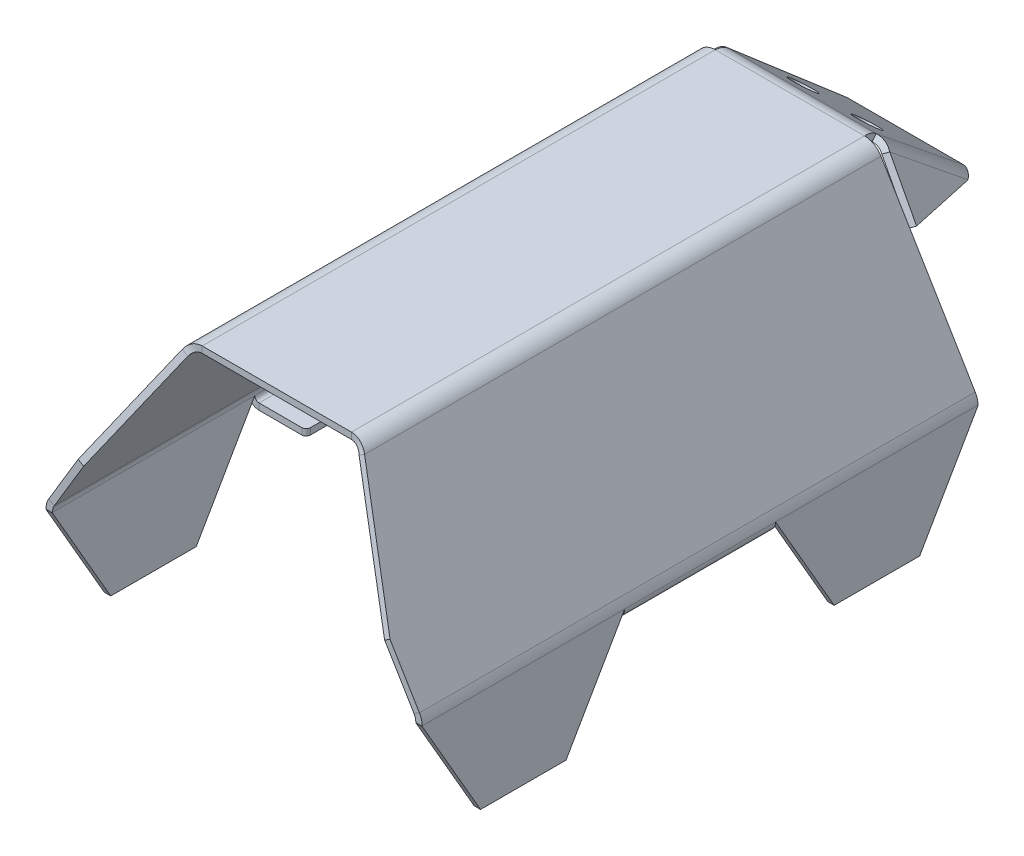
ISO-10303-21;
HEADER;
FILE_DESCRIPTION(('STEP AP214'),'2;1');
FILE_NAME('part.step','',(''),(''),'','','');
FILE_SCHEMA(('AUTOMOTIVE_DESIGN { 1 0 10303 214 1 1 1 1 }'));
ENDSEC;
DATA;
#1=APPLICATION_CONTEXT('core data for automotive mechanical design processes');
#2=APPLICATION_PROTOCOL_DEFINITION('international standard','automotive_design',2000,#1);
#3=PRODUCT_CONTEXT('',#1,'mechanical');
#4=PRODUCT('Part','Part','',(#3));
#5=PRODUCT_RELATED_PRODUCT_CATEGORY('part','',(#4));
#6=PRODUCT_DEFINITION_FORMATION('','',#4);
#7=PRODUCT_DEFINITION_CONTEXT('part definition',#1,'design');
#8=PRODUCT_DEFINITION('design','',#6,#7);
#9=PRODUCT_DEFINITION_SHAPE('','',#8);
#10=(LENGTH_UNIT() NAMED_UNIT(*) SI_UNIT(.MILLI.,.METRE.));
#11=(NAMED_UNIT(*) PLANE_ANGLE_UNIT() SI_UNIT($,.RADIAN.));
#12=(NAMED_UNIT(*) SI_UNIT($,.STERADIAN.) SOLID_ANGLE_UNIT());
#13=UNCERTAINTY_MEASURE_WITH_UNIT(LENGTH_MEASURE(1.E-05),#10,'distance_accuracy_value','');
#14=(GEOMETRIC_REPRESENTATION_CONTEXT(3) GLOBAL_UNCERTAINTY_ASSIGNED_CONTEXT((#13)) GLOBAL_UNIT_ASSIGNED_CONTEXT((#10,
#11,#12)) REPRESENTATION_CONTEXT('',''));
#15=CARTESIAN_POINT('',(0.,0.,0.));
#16=DIRECTION('',(0.,0.,1.));
#17=DIRECTION('',(1.,0.,0.));
#18=AXIS2_PLACEMENT_3D('',#15,#16,#17);
#19=CARTESIAN_POINT('',(-42.5,11.253572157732,130.));
#20=DIRECTION('',(0.,0.,1.));
#21=DIRECTION('',(1.,0.,0.));
#22=AXIS2_PLACEMENT_3D('',#19,#20,#21);
#23=PLANE('',#22);
#24=DIRECTION('',(-0.514495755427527,-0.857492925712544,0.));
#25=VECTOR('',#24,1.);
#26=CARTESIAN_POINT('',(-42.7137606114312,11.7282563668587,130.));
#27=LINE('',#26,#25);
#28=CARTESIAN_POINT('',(-35.198140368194,24.2542901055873,130.));
#29=VERTEX_POINT('',#28);
#30=CARTESIAN_POINT('',(-42.0724787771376,12.7970594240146,130.));
#31=VERTEX_POINT('',#30);
#32=EDGE_CURVE('E1111',#29,#31,#27,.T.);
#33=ORIENTED_EDGE('',*,*,#32,.F.);
#34=DIRECTION('',(-0.857492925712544,0.514495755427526,0.));
#35=VECTOR('',#34,1.);
#36=CARTESIAN_POINT('',(-36.4843797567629,25.0260337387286,130.));
#37=LINE('',#36,#35);
#38=CARTESIAN_POINT('',(-36.4843797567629,25.0260337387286,130.));
#39=VERTEX_POINT('',#38);
#40=EDGE_CURVE('E935',#39,#29,#37,.F.);
#41=ORIENTED_EDGE('',*,*,#40,.F.);
#42=DIRECTION('',(-0.514495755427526,-0.857492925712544,0.));
#43=VECTOR('',#42,1.);
#44=CARTESIAN_POINT('',(-44.,12.5,130.));
#45=LINE('',#44,#43);
#46=CARTESIAN_POINT('',(-43.3587181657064,13.5688030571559,130.));
#47=VERTEX_POINT('',#46);
#48=EDGE_CURVE('E1129',#39,#47,#45,.T.);
#49=ORIENTED_EDGE('',*,*,#48,.T.);
#50=DIRECTION('',(0.857492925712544,-0.514495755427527,0.));
#51=VECTOR('',#50,1.);
#52=CARTESIAN_POINT('',(-43.3587181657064,13.5688030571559,130.));
#53=LINE('',#52,#51);
#54=EDGE_CURVE('E13',#47,#31,#53,.T.);
#55=ORIENTED_EDGE('',*,*,#54,.T.);
#56=EDGE_LOOP('',(#33,#41,#49,#55));
#57=FACE_BOUND('',#56,.T.);
#58=ADVANCED_FACE('F147',(#57),#23,.T.);
#59=CARTESIAN_POINT('',(17.4521432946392,51.,130.));
#60=DIRECTION('',(0.,0.,1.));
#61=DIRECTION('',(1.,0.,0.));
#62=AXIS2_PLACEMENT_3D('',#59,#60,#61);
#63=PLANE('',#62);
#64=DIRECTION('',(-0.514495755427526,0.857492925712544,0.));
#65=VECTOR('',#64,1.);
#66=CARTESIAN_POINT('',(44.,12.5,130.));
#67=LINE('',#66,#65);
#68=CARTESIAN_POINT('',(43.3587181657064,13.5688030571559,130.));
#69=VERTEX_POINT('',#68);
#70=CARTESIAN_POINT('',(36.4843797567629,25.0260337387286,130.));
#71=VERTEX_POINT('',#70);
#72=EDGE_CURVE('E1126',#69,#71,#67,.T.);
#73=ORIENTED_EDGE('',*,*,#72,.T.);
#74=DIRECTION('',(0.857492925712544,0.514495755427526,0.));
#75=VECTOR('',#74,1.);
#76=CARTESIAN_POINT('',(36.4843797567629,25.0260337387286,130.));
#77=LINE('',#76,#75);
#78=CARTESIAN_POINT('',(35.198140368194,24.2542901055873,130.));
#79=VERTEX_POINT('',#78);
#80=EDGE_CURVE('E914',#71,#79,#77,.F.);
#81=ORIENTED_EDGE('',*,*,#80,.T.);
#82=DIRECTION('',(-0.514495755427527,0.857492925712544,0.));
#83=VECTOR('',#82,1.);
#84=CARTESIAN_POINT('',(42.7137606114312,11.7282563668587,130.));
#85=LINE('',#84,#83);
#86=CARTESIAN_POINT('',(42.0724787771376,12.7970594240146,130.));
#87=VERTEX_POINT('',#86);
#88=EDGE_CURVE('E1113',#87,#79,#85,.T.);
#89=ORIENTED_EDGE('',*,*,#88,.F.);
#90=DIRECTION('',(0.857492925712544,0.514495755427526,0.));
#91=VECTOR('',#90,1.);
#92=CARTESIAN_POINT('',(42.0724787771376,12.7970594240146,130.));
#93=LINE('',#92,#91);
#94=EDGE_CURVE('E1183',#87,#69,#93,.T.);
#95=ORIENTED_EDGE('',*,*,#94,.T.);
#96=EDGE_LOOP('',(#73,#81,#89,#95));
#97=FACE_BOUND('',#96,.T.);
#98=ADVANCED_FACE('F1235',(#97),#63,.T.);
#99=CARTESIAN_POINT('',(-42.7137606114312,11.7282563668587,130.));
#100=DIRECTION('',(0.857492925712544,-0.514495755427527,0.));
#101=DIRECTION('',(0.514495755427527,0.857492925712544,0.));
#102=AXIS2_PLACEMENT_3D('',#99,#100,#101);
#103=PLANE('',#102);
#104=DIRECTION('',(0.,0.,-1.));
#105=VECTOR('',#104,1.);
#106=CARTESIAN_POINT('',(-20.0246220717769,49.5434872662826,130.));
#107=LINE('',#106,#105);
#108=CARTESIAN_POINT('',(-20.0246220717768,49.5434872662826,120.795484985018));
#109=VERTEX_POINT('',#108);
#110=CARTESIAN_POINT('',(-20.0246220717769,49.5434872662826,0.));
#111=VERTEX_POINT('',#110);
#112=EDGE_CURVE('E1170',#109,#111,#107,.T.);
#113=ORIENTED_EDGE('',*,*,#112,.F.);
#114=DIRECTION('',(0.491131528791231,0.818552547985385,-0.297928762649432));
#115=VECTOR('',#114,1.);
#116=CARTESIAN_POINT('',(-42.0466625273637,12.8400865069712,134.15443035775));
#117=LINE('',#116,#115);
#118=EDGE_CURVE('E933',#29,#109,#117,.T.);
#119=ORIENTED_EDGE('',*,*,#118,.F.);
#120=ORIENTED_EDGE('',*,*,#32,.T.);
#121=DIRECTION('',(0.,0.,-1.));
#122=VECTOR('',#121,1.);
#123=CARTESIAN_POINT('',(-42.0724787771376,12.7970594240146,130.));
#124=LINE('',#123,#122);
#125=CARTESIAN_POINT('',(-42.0724787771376,12.7970594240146,0.));
#126=VERTEX_POINT('',#125);
#127=EDGE_CURVE('E1172',#31,#126,#124,.T.);
#128=ORIENTED_EDGE('',*,*,#127,.T.);
#129=DIRECTION('',(-0.514495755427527,-0.857492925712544,0.));
#130=VECTOR('',#129,1.);
#131=CARTESIAN_POINT('',(-42.7137606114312,11.7282563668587,0.));
#132=LINE('',#131,#130);
#133=EDGE_CURVE('E1060',#111,#126,#132,.T.);
#134=ORIENTED_EDGE('',*,*,#133,.F.);
#135=EDGE_LOOP('',(#113,#119,#120,#128,#134));
#136=FACE_BOUND('',#135,.T.);
#137=ADVANCED_FACE('F1241',(#136),#103,.T.);
#138=CARTESIAN_POINT('',(-17.4521432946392,48.,130.));
#139=DIRECTION('',(0.,0.,-1.));
#140=DIRECTION('',(-1.,0.,0.));
#141=AXIS2_PLACEMENT_3D('',#138,#139,#140);
#142=CYLINDRICAL_SURFACE('',#141,3.);
#143=DIRECTION('',(0.,0.,-1.));
#144=VECTOR('',#143,1.);
#145=CARTESIAN_POINT('',(-17.4521432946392,51.,130.));
#146=LINE('',#145,#144);
#147=CARTESIAN_POINT('',(-17.4521432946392,51.,120.000294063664));
#148=VERTEX_POINT('',#147);
#149=CARTESIAN_POINT('',(-17.4521432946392,51.,0.));
#150=VERTEX_POINT('',#149);
#151=EDGE_CURVE('E1167',#148,#150,#146,.T.);
#152=ORIENTED_EDGE('',*,*,#151,.F.);
#153=CARTESIAN_POINT('',(-17.4521432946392,48.,121.638160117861));
#154=DIRECTION('',(0.,-0.479190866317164,-0.877710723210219));
#155=DIRECTION('',(0.,0.877710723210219,-0.479190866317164));
#156=AXIS2_PLACEMENT_3D('',#153,#154,#155);
#157=ELLIPSE('',#156,3.41798262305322,3.);
#158=EDGE_CURVE('E901',#109,#148,#157,.T.);
#159=ORIENTED_EDGE('',*,*,#158,.F.);
#160=ORIENTED_EDGE('',*,*,#112,.T.);
#161=CARTESIAN_POINT('',(-17.4521432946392,48.,0.));
#162=DIRECTION('',(0.,0.,1.));
#163=DIRECTION('',(1.,0.,0.));
#164=AXIS2_PLACEMENT_3D('',#161,#162,#163);
#165=CIRCLE('',#164,3.);
#166=EDGE_CURVE('E1063',#150,#111,#165,.T.);
#167=ORIENTED_EDGE('',*,*,#166,.F.);
#168=EDGE_LOOP('',(#152,#159,#160,#167));
#169=FACE_BOUND('',#168,.T.);
#170=ADVANCED_FACE('F1300',(#169),#142,.F.);
#171=CARTESIAN_POINT('',(-20.,51.,130.));
#172=DIRECTION('',(0.,-1.,0.));
#173=DIRECTION('',(0.,0.,-1.));
#174=AXIS2_PLACEMENT_3D('',#171,#172,#173);
#175=PLANE('',#174);
#176=DIRECTION('',(0.,0.,-1.));
#177=VECTOR('',#176,1.);
#178=CARTESIAN_POINT('',(17.4521432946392,51.,130.));
#179=LINE('',#178,#177);
#180=CARTESIAN_POINT('',(17.4521432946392,51.,120.000294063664));
#181=VERTEX_POINT('',#180);
#182=CARTESIAN_POINT('',(17.4521432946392,51.,0.));
#183=VERTEX_POINT('',#182);
#184=EDGE_CURVE('E1164',#181,#183,#179,.T.);
#185=ORIENTED_EDGE('',*,*,#184,.F.);
#186=DIRECTION('',(1.,0.,0.));
#187=VECTOR('',#186,1.);
#188=CARTESIAN_POINT('',(-20.,51.,120.000294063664));
#189=LINE('',#188,#187);
#190=EDGE_CURVE('E922',#148,#181,#189,.T.);
#191=ORIENTED_EDGE('',*,*,#190,.F.);
#192=ORIENTED_EDGE('',*,*,#151,.T.);
#193=DIRECTION('',(1.,0.,0.));
#194=VECTOR('',#193,1.);
#195=CARTESIAN_POINT('',(-20.,51.,0.));
#196=LINE('',#195,#194);
#197=EDGE_CURVE('E1066',#183,#150,#196,.F.);
#198=ORIENTED_EDGE('',*,*,#197,.F.);
#199=EDGE_LOOP('',(#185,#191,#192,#198));
#200=FACE_BOUND('',#199,.T.);
#201=ADVANCED_FACE('F1304',(#200),#175,.T.);
#202=CARTESIAN_POINT('',(17.4521432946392,48.,130.));
#203=DIRECTION('',(0.,0.,-1.));
#204=DIRECTION('',(-1.,0.,0.));
#205=AXIS2_PLACEMENT_3D('',#202,#203,#204);
#206=CYLINDRICAL_SURFACE('',#205,3.);
#207=DIRECTION('',(0.,0.,-1.));
#208=VECTOR('',#207,1.);
#209=CARTESIAN_POINT('',(20.0246220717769,49.5434872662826,130.));
#210=LINE('',#209,#208);
#211=CARTESIAN_POINT('',(20.0246220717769,49.5434872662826,120.795484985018));
#212=VERTEX_POINT('',#211);
#213=CARTESIAN_POINT('',(20.0246220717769,49.5434872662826,0.));
#214=VERTEX_POINT('',#213);
#215=EDGE_CURVE('E1162',#212,#214,#210,.T.);
#216=ORIENTED_EDGE('',*,*,#215,.F.);
#217=CARTESIAN_POINT('',(17.4521432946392,48.,121.638160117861));
#218=DIRECTION('',(0.,-0.479190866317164,-0.877710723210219));
#219=DIRECTION('',(0.,0.877710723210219,-0.479190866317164));
#220=AXIS2_PLACEMENT_3D('',#217,#218,#219);
#221=ELLIPSE('',#220,3.41798262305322,3.);
#222=EDGE_CURVE('E906',#181,#212,#221,.T.);
#223=ORIENTED_EDGE('',*,*,#222,.F.);
#224=ORIENTED_EDGE('',*,*,#184,.T.);
#225=CARTESIAN_POINT('',(17.4521432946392,48.,0.));
#226=DIRECTION('',(0.,0.,1.));
#227=DIRECTION('',(1.,0.,0.));
#228=AXIS2_PLACEMENT_3D('',#225,#226,#227);
#229=CIRCLE('',#228,3.);
#230=EDGE_CURVE('E1068',#214,#183,#229,.T.);
#231=ORIENTED_EDGE('',*,*,#230,.F.);
#232=EDGE_LOOP('',(#216,#223,#224,#231));
#233=FACE_BOUND('',#232,.T.);
#234=ADVANCED_FACE('F1308',(#233),#206,.F.);
#235=CARTESIAN_POINT('',(42.7137606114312,11.7282563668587,130.));
#236=DIRECTION('',(-0.857492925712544,-0.514495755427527,0.));
#237=DIRECTION('',(0.514495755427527,-0.857492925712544,0.));
#238=AXIS2_PLACEMENT_3D('',#235,#236,#237);
#239=PLANE('',#238);
#240=ORIENTED_EDGE('',*,*,#88,.T.);
#241=DIRECTION('',(0.491131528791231,-0.818552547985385,0.297928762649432));
#242=VECTOR('',#241,1.);
#243=CARTESIAN_POINT('',(42.0466625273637,12.8400865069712,134.15443035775));
#244=LINE('',#243,#242);
#245=EDGE_CURVE('E911',#212,#79,#244,.T.);
#246=ORIENTED_EDGE('',*,*,#245,.F.);
#247=ORIENTED_EDGE('',*,*,#215,.T.);
#248=DIRECTION('',(-0.514495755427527,0.857492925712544,0.));
#249=VECTOR('',#248,1.);
#250=CARTESIAN_POINT('',(42.7137606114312,11.7282563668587,0.));
#251=LINE('',#250,#249);
#252=CARTESIAN_POINT('',(42.0724787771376,12.7970594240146,0.));
#253=VERTEX_POINT('',#252);
#254=EDGE_CURVE('E1071',#253,#214,#251,.T.);
#255=ORIENTED_EDGE('',*,*,#254,.F.);
#256=DIRECTION('',(0.,0.,-1.));
#257=VECTOR('',#256,1.);
#258=CARTESIAN_POINT('',(42.0724787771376,12.7970594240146,130.));
#259=LINE('',#258,#257);
#260=EDGE_CURVE('E1159',#87,#253,#259,.T.);
#261=ORIENTED_EDGE('',*,*,#260,.F.);
#262=EDGE_LOOP('',(#240,#246,#247,#255,#261));
#263=FACE_BOUND('',#262,.T.);
#264=ADVANCED_FACE('F1312',(#263),#239,.T.);
#265=CARTESIAN_POINT('',(44.,12.5,130.));
#266=DIRECTION('',(-0.857492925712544,-0.514495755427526,0.));
#267=DIRECTION('',(0.514495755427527,-0.857492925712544,0.));
#268=AXIS2_PLACEMENT_3D('',#265,#266,#267);
#269=PLANE('',#268);
#270=DIRECTION('',(0.491131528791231,-0.818552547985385,0.297928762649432));
#271=VECTOR('',#270,1.);
#272=CARTESIAN_POINT('',(43.3329019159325,13.6118301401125,134.15443035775));
#273=LINE('',#272,#271);
#274=CARTESIAN_POINT('',(21.3108614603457,50.3152308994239,120.795484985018));
#275=VERTEX_POINT('',#274);
#276=EDGE_CURVE('E908',#275,#71,#273,.T.);
#277=ORIENTED_EDGE('',*,*,#276,.T.);
#278=ORIENTED_EDGE('',*,*,#72,.F.);
#279=DIRECTION('',(0.,0.,-1.));
#280=VECTOR('',#279,1.);
#281=CARTESIAN_POINT('',(43.3587181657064,13.5688030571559,130.));
#282=LINE('',#281,#280);
#283=CARTESIAN_POINT('',(43.3587181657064,13.5688030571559,0.));
#284=VERTEX_POINT('',#283);
#285=EDGE_CURVE('E1150',#69,#284,#282,.T.);
#286=ORIENTED_EDGE('',*,*,#285,.T.);
#287=DIRECTION('',(-0.514495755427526,0.857492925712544,0.));
#288=VECTOR('',#287,1.);
#289=CARTESIAN_POINT('',(44.,12.5,0.));
#290=LINE('',#289,#288);
#291=CARTESIAN_POINT('',(21.3108614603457,50.3152308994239,0.));
#292=VERTEX_POINT('',#291);
#293=EDGE_CURVE('E1084',#284,#292,#290,.T.);
#294=ORIENTED_EDGE('',*,*,#293,.T.);
#295=DIRECTION('',(0.,0.,-1.));
#296=VECTOR('',#295,1.);
#297=CARTESIAN_POINT('',(21.3108614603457,50.3152308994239,130.));
#298=LINE('',#297,#296);
#299=EDGE_CURVE('E1148',#275,#292,#298,.T.);
#300=ORIENTED_EDGE('',*,*,#299,.F.);
#301=EDGE_LOOP('',(#277,#278,#286,#294,#300));
#302=FACE_BOUND('',#301,.T.);
#303=ADVANCED_FACE('F1316',(#302),#269,.F.);
#304=CARTESIAN_POINT('',(17.4521432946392,48.,130.));
#305=DIRECTION('',(0.,0.,-1.));
#306=DIRECTION('',(-1.,0.,0.));
#307=AXIS2_PLACEMENT_3D('',#304,#305,#306);
#308=CYLINDRICAL_SURFACE('',#307,4.5);
#309=CARTESIAN_POINT('',(17.4521432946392,48.,121.638160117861));
#310=DIRECTION('',(0.,-0.342020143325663,-0.939692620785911));
#311=DIRECTION('',(0.,0.939692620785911,-0.342020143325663));
#312=AXIS2_PLACEMENT_3D('',#309,#310,#311);
#313=ELLIPSE('',#312,4.78879997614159,4.5);
#314=CARTESIAN_POINT('',(17.4521432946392,52.5,120.000294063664));
#315=VERTEX_POINT('',#314);
#316=EDGE_CURVE('E903',#315,#275,#313,.T.);
#317=ORIENTED_EDGE('',*,*,#316,.T.);
#318=ORIENTED_EDGE('',*,*,#299,.T.);
#319=CARTESIAN_POINT('',(17.4521432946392,48.,0.));
#320=DIRECTION('',(0.,0.,1.));
#321=DIRECTION('',(1.,0.,0.));
#322=AXIS2_PLACEMENT_3D('',#319,#320,#321);
#323=CIRCLE('',#322,4.5);
#324=CARTESIAN_POINT('',(17.4521432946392,52.5,0.));
#325=VERTEX_POINT('',#324);
#326=EDGE_CURVE('E1087',#292,#325,#323,.T.);
#327=ORIENTED_EDGE('',*,*,#326,.T.);
#328=DIRECTION('',(0.,0.,-1.));
#329=VECTOR('',#328,1.);
#330=CARTESIAN_POINT('',(17.4521432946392,52.5,130.));
#331=LINE('',#330,#329);
#332=EDGE_CURVE('E1145',#315,#325,#331,.T.);
#333=ORIENTED_EDGE('',*,*,#332,.F.);
#334=EDGE_LOOP('',(#317,#318,#327,#333));
#335=FACE_BOUND('',#334,.T.);
#336=ADVANCED_FACE('F1336',(#335),#308,.T.);
#337=CARTESIAN_POINT('',(-20.,52.5,130.));
#338=DIRECTION('',(0.,-1.,0.));
#339=DIRECTION('',(0.,0.,-1.));
#340=AXIS2_PLACEMENT_3D('',#337,#338,#339);
#341=PLANE('',#340);
#342=DIRECTION('',(1.,0.,0.));
#343=VECTOR('',#342,1.);
#344=CARTESIAN_POINT('',(-20.,52.5,120.000294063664));
#345=LINE('',#344,#343);
#346=CARTESIAN_POINT('',(-17.4521432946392,52.5,120.000294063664));
#347=VERTEX_POINT('',#346);
#348=EDGE_CURVE('E917',#347,#315,#345,.T.);
#349=ORIENTED_EDGE('',*,*,#348,.T.);
#350=ORIENTED_EDGE('',*,*,#332,.T.);
#351=DIRECTION('',(-1.,0.,0.));
#352=VECTOR('',#351,1.);
#353=CARTESIAN_POINT('',(-20.,52.5,0.));
#354=LINE('',#353,#352);
#355=CARTESIAN_POINT('',(-17.4521432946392,52.5,0.));
#356=VERTEX_POINT('',#355);
#357=EDGE_CURVE('E1090',#325,#356,#354,.T.);
#358=ORIENTED_EDGE('',*,*,#357,.T.);
#359=DIRECTION('',(0.,0.,-1.));
#360=VECTOR('',#359,1.);
#361=CARTESIAN_POINT('',(-17.4521432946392,52.5,130.));
#362=LINE('',#361,#360);
#363=EDGE_CURVE('E1142',#347,#356,#362,.T.);
#364=ORIENTED_EDGE('',*,*,#363,.F.);
#365=EDGE_LOOP('',(#349,#350,#358,#364));
#366=FACE_BOUND('',#365,.T.);
#367=ADVANCED_FACE('F1340',(#366),#341,.F.);
#368=CARTESIAN_POINT('',(-17.4521432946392,48.,130.));
#369=DIRECTION('',(0.,0.,-1.));
#370=DIRECTION('',(-1.,0.,0.));
#371=AXIS2_PLACEMENT_3D('',#368,#369,#370);
#372=CYLINDRICAL_SURFACE('',#371,4.5);
#373=CARTESIAN_POINT('',(-17.4521432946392,48.,121.638160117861));
#374=DIRECTION('',(0.,-0.342020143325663,-0.939692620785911));
#375=DIRECTION('',(0.,0.939692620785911,-0.342020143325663));
#376=AXIS2_PLACEMENT_3D('',#373,#374,#375);
#377=ELLIPSE('',#376,4.78879997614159,4.5);
#378=CARTESIAN_POINT('',(-21.3108614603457,50.3152308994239,120.795484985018));
#379=VERTEX_POINT('',#378);
#380=EDGE_CURVE('E893',#379,#347,#377,.T.);
#381=ORIENTED_EDGE('',*,*,#380,.T.);
#382=ORIENTED_EDGE('',*,*,#363,.T.);
#383=CARTESIAN_POINT('',(-17.4521432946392,48.,0.));
#384=DIRECTION('',(0.,0.,1.));
#385=DIRECTION('',(1.,0.,0.));
#386=AXIS2_PLACEMENT_3D('',#383,#384,#385);
#387=CIRCLE('',#386,4.5);
#388=CARTESIAN_POINT('',(-21.3108614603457,50.3152308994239,0.));
#389=VERTEX_POINT('',#388);
#390=EDGE_CURVE('E1093',#356,#389,#387,.T.);
#391=ORIENTED_EDGE('',*,*,#390,.T.);
#392=DIRECTION('',(0.,0.,-1.));
#393=VECTOR('',#392,1.);
#394=CARTESIAN_POINT('',(-21.3108614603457,50.3152308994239,130.));
#395=LINE('',#394,#393);
#396=EDGE_CURVE('E1140',#379,#389,#395,.T.);
#397=ORIENTED_EDGE('',*,*,#396,.F.);
#398=EDGE_LOOP('',(#381,#382,#391,#397));
#399=FACE_BOUND('',#398,.T.);
#400=ADVANCED_FACE('F1344',(#399),#372,.T.);
#401=CARTESIAN_POINT('',(-44.,12.5,130.));
#402=DIRECTION('',(0.857492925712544,-0.514495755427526,0.));
#403=DIRECTION('',(0.514495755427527,0.857492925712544,0.));
#404=AXIS2_PLACEMENT_3D('',#401,#402,#403);
#405=PLANE('',#404);
#406=DIRECTION('',(0.491131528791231,0.818552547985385,-0.297928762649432));
#407=VECTOR('',#406,1.);
#408=CARTESIAN_POINT('',(-43.3329019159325,13.6118301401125,134.15443035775));
#409=LINE('',#408,#407);
#410=EDGE_CURVE('E928',#39,#379,#409,.T.);
#411=ORIENTED_EDGE('',*,*,#410,.T.);
#412=ORIENTED_EDGE('',*,*,#396,.T.);
#413=DIRECTION('',(-0.514495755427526,-0.857492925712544,0.));
#414=VECTOR('',#413,1.);
#415=CARTESIAN_POINT('',(-44.,12.5,0.));
#416=LINE('',#415,#414);
#417=CARTESIAN_POINT('',(-43.3587181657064,13.5688030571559,0.));
#418=VERTEX_POINT('',#417);
#419=EDGE_CURVE('E1096',#389,#418,#416,.T.);
#420=ORIENTED_EDGE('',*,*,#419,.T.);
#421=DIRECTION('',(0.,0.,-1.));
#422=VECTOR('',#421,1.);
#423=CARTESIAN_POINT('',(-43.3587181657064,13.5688030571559,130.));
#424=LINE('',#423,#422);
#425=EDGE_CURVE('E1137',#47,#418,#424,.T.);
#426=ORIENTED_EDGE('',*,*,#425,.F.);
#427=ORIENTED_EDGE('',*,*,#48,.F.);
#428=EDGE_LOOP('',(#411,#412,#420,#426,#427));
#429=FACE_BOUND('',#428,.T.);
#430=ADVANCED_FACE('F1255',(#429),#405,.F.);
#431=CARTESIAN_POINT('',(-42.0724787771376,12.7970594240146,0.));
#432=DIRECTION('',(0.,0.,-1.));
#433=DIRECTION('',(-1.,0.,0.));
#434=AXIS2_PLACEMENT_3D('',#431,#432,#433);
#435=PLANE('',#434);
#436=DIRECTION('',(0.,1.,0.));
#437=VECTOR('',#436,1.);
#438=CARTESIAN_POINT('',(-42.5,-12.5,0.));
#439=LINE('',#438,#437);
#440=CARTESIAN_POINT('',(-42.5,11.253572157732,0.));
#441=VERTEX_POINT('',#440);
#442=CARTESIAN_POINT('',(-42.5,11.1266066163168,0.));
#443=VERTEX_POINT('',#442);
#444=EDGE_CURVE('E1054',#441,#443,#439,.F.);
#445=ORIENTED_EDGE('',*,*,#444,.T.);
#446=DIRECTION('',(1.,0.,0.));
#447=VECTOR('',#446,1.);
#448=CARTESIAN_POINT('',(-42.5,11.1266066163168,0.));
#449=LINE('',#448,#447);
#450=CARTESIAN_POINT('',(-44.,11.1266066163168,0.));
#451=VERTEX_POINT('',#450);
#452=EDGE_CURVE('E956',#443,#451,#449,.F.);
#453=ORIENTED_EDGE('',*,*,#452,.T.);
#454=DIRECTION('',(0.,-1.,0.));
#455=VECTOR('',#454,1.);
#456=CARTESIAN_POINT('',(-44.,-12.5,0.));
#457=LINE('',#456,#455);
#458=CARTESIAN_POINT('',(-44.,11.253572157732,0.));
#459=VERTEX_POINT('',#458);
#460=EDGE_CURVE('E1049',#459,#451,#457,.T.);
#461=ORIENTED_EDGE('',*,*,#460,.F.);
#462=DIRECTION('',(1.,0.,0.));
#463=VECTOR('',#462,1.);
#464=CARTESIAN_POINT('',(-44.,11.253572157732,0.));
#465=LINE('',#464,#463);
#466=EDGE_CURVE('E1201',#459,#441,#465,.T.);
#467=ORIENTED_EDGE('',*,*,#466,.T.);
#468=EDGE_LOOP('',(#445,#453,#461,#467));
#469=FACE_BOUND('',#468,.T.);
#470=ADVANCED_FACE('F1251',(#469),#435,.T.);
#471=CARTESIAN_POINT('',(-44.,-12.5,130.));
#472=DIRECTION('',(1.,0.,0.));
#473=DIRECTION('',(0.,0.,-1.));
#474=AXIS2_PLACEMENT_3D('',#471,#472,#473);
#475=PLANE('',#474);
#476=DIRECTION('',(0.,0.86602540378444,0.499999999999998));
#477=VECTOR('',#476,1.);
#478=CARTESIAN_POINT('',(-44.,-6.59334834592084,119.769379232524));
#479=LINE('',#478,#477);
#480=CARTESIAN_POINT('',(-44.,-12.496427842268,116.36123469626));
#481=VERTEX_POINT('',#480);
#482=CARTESIAN_POINT('',(-44.,11.1266066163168,130.));
#483=VERTEX_POINT('',#482);
#484=EDGE_CURVE('E953',#481,#483,#479,.T.);
#485=ORIENTED_EDGE('',*,*,#484,.T.);
#486=DIRECTION('',(0.,-1.,0.));
#487=VECTOR('',#486,1.);
#488=CARTESIAN_POINT('',(-44.,-12.5,130.));
#489=LINE('',#488,#487);
#490=CARTESIAN_POINT('',(-44.,11.253572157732,130.));
#491=VERTEX_POINT('',#490);
#492=EDGE_CURVE('E1102',#491,#483,#489,.T.);
#493=ORIENTED_EDGE('',*,*,#492,.F.);
#494=DIRECTION('',(0.,0.,-1.));
#495=VECTOR('',#494,1.);
#496=CARTESIAN_POINT('',(-44.,11.253572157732,130.));
#497=LINE('',#496,#495);
#498=EDGE_CURVE('E1134',#491,#459,#497,.T.);
#499=ORIENTED_EDGE('',*,*,#498,.T.);
#500=ORIENTED_EDGE('',*,*,#460,.T.);
#501=DIRECTION('',(0.,-0.86602540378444,0.499999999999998));
#502=VECTOR('',#501,1.);
#503=CARTESIAN_POINT('',(-44.,-62.8849995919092,42.7306207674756));
#504=LINE('',#503,#502);
#505=CARTESIAN_POINT('',(-44.,-12.496427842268,13.6387653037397));
#506=VERTEX_POINT('',#505);
#507=EDGE_CURVE('E952',#451,#506,#504,.T.);
#508=ORIENTED_EDGE('',*,*,#507,.T.);
#509=DIRECTION('',(0.,0.,-1.));
#510=VECTOR('',#509,1.);
#511=CARTESIAN_POINT('',(-44.,-12.496427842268,130.));
#512=LINE('',#511,#510);
#513=CARTESIAN_POINT('',(-44.,-12.496427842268,33.6387653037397));
#514=VERTEX_POINT('',#513);
#515=EDGE_CURVE('E969',#506,#514,#512,.F.);
#516=ORIENTED_EDGE('',*,*,#515,.T.);
#517=DIRECTION('',(0.,0.86602540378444,0.499999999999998));
#518=VECTOR('',#517,1.);
#519=CARTESIAN_POINT('',(-44.,29.2265316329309,57.7275271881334));
#520=LINE('',#519,#518);
#521=CARTESIAN_POINT('',(-43.9999999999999,11.25,47.348771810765));
#522=VERTEX_POINT('',#521);
#523=EDGE_CURVE('E966',#514,#522,#520,.T.);
#524=ORIENTED_EDGE('',*,*,#523,.T.);
#525=DIRECTION('',(0.,0.,-1.));
#526=VECTOR('',#525,1.);
#527=CARTESIAN_POINT('',(-44.,11.25,130.));
#528=LINE('',#527,#526);
#529=CARTESIAN_POINT('',(-44.,11.25,82.651228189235));
#530=VERTEX_POINT('',#529);
#531=EDGE_CURVE('E963',#522,#530,#528,.F.);
#532=ORIENTED_EDGE('',*,*,#531,.T.);
#533=DIRECTION('',(0.,-0.86602540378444,0.499999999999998));
#534=VECTOR('',#533,1.);
#535=CARTESIAN_POINT('',(-44.,-27.0651196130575,104.772472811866));
#536=LINE('',#535,#534);
#537=CARTESIAN_POINT('',(-44.,-12.496427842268,96.3612346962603));
#538=VERTEX_POINT('',#537);
#539=EDGE_CURVE('E960',#530,#538,#536,.T.);
#540=ORIENTED_EDGE('',*,*,#539,.T.);
#541=DIRECTION('',(0.,0.,-1.));
#542=VECTOR('',#541,1.);
#543=CARTESIAN_POINT('',(-44.,-12.496427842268,130.));
#544=LINE('',#543,#542);
#545=EDGE_CURVE('E957',#538,#481,#544,.F.);
#546=ORIENTED_EDGE('',*,*,#545,.T.);
#547=EDGE_LOOP('',(#485,#493,#499,#500,#508,#516,#524,#532,#540,#546));
#548=FACE_BOUND('',#547,.T.);
#549=ADVANCED_FACE('F1254',(#548),#475,.F.);
#550=CARTESIAN_POINT('',(-42.5,-12.5,130.));
#551=DIRECTION('',(1.,0.,0.));
#552=DIRECTION('',(0.,0.,-1.));
#553=AXIS2_PLACEMENT_3D('',#550,#551,#552);
#554=PLANE('',#553);
#555=DIRECTION('',(0.,1.,0.));
#556=VECTOR('',#555,1.);
#557=CARTESIAN_POINT('',(-42.5,-12.5,130.));
#558=LINE('',#557,#556);
#559=CARTESIAN_POINT('',(-42.5,11.253572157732,130.));
#560=VERTEX_POINT('',#559);
#561=CARTESIAN_POINT('',(-42.5,11.1266066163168,130.));
#562=VERTEX_POINT('',#561);
#563=EDGE_CURVE('E1105',#560,#562,#558,.F.);
#564=ORIENTED_EDGE('',*,*,#563,.T.);
#565=DIRECTION('',(0.,0.86602540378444,0.499999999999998));
#566=VECTOR('',#565,1.);
#567=CARTESIAN_POINT('',(-42.5,-6.59334834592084,119.769379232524));
#568=LINE('',#567,#566);
#569=CARTESIAN_POINT('',(-42.5,-12.496427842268,116.36123469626));
#570=VERTEX_POINT('',#569);
#571=EDGE_CURVE('E172',#570,#562,#568,.T.);
#572=ORIENTED_EDGE('',*,*,#571,.F.);
#573=DIRECTION('',(0.,0.,1.));
#574=VECTOR('',#573,1.);
#575=CARTESIAN_POINT('',(-42.5,-12.496427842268,130.));
#576=LINE('',#575,#574);
#577=CARTESIAN_POINT('',(-42.5,-12.496427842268,96.3612346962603));
#578=VERTEX_POINT('',#577);
#579=EDGE_CURVE('E949',#578,#570,#576,.T.);
#580=ORIENTED_EDGE('',*,*,#579,.F.);
#581=DIRECTION('',(0.,-0.86602540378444,0.499999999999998));
#582=VECTOR('',#581,1.);
#583=CARTESIAN_POINT('',(-42.5,-27.0651196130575,104.772472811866));
#584=LINE('',#583,#582);
#585=CARTESIAN_POINT('',(-42.5000000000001,11.25,82.651228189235));
#586=VERTEX_POINT('',#585);
#587=EDGE_CURVE('E947',#586,#578,#584,.T.);
#588=ORIENTED_EDGE('',*,*,#587,.F.);
#589=DIRECTION('',(0.,0.,1.));
#590=VECTOR('',#589,1.);
#591=CARTESIAN_POINT('',(-42.5,11.25,130.));
#592=LINE('',#591,#590);
#593=CARTESIAN_POINT('',(-42.4999999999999,11.25,47.348771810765));
#594=VERTEX_POINT('',#593);
#595=EDGE_CURVE('E945',#594,#586,#592,.T.);
#596=ORIENTED_EDGE('',*,*,#595,.F.);
#597=DIRECTION('',(0.,0.86602540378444,0.499999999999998));
#598=VECTOR('',#597,1.);
#599=CARTESIAN_POINT('',(-42.5,29.2265316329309,57.7275271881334));
#600=LINE('',#599,#598);
#601=CARTESIAN_POINT('',(-42.5,-12.496427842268,33.6387653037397));
#602=VERTEX_POINT('',#601);
#603=EDGE_CURVE('E942',#602,#594,#600,.T.);
#604=ORIENTED_EDGE('',*,*,#603,.F.);
#605=DIRECTION('',(0.,0.,1.));
#606=VECTOR('',#605,1.);
#607=CARTESIAN_POINT('',(-42.5,-12.496427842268,130.));
#608=LINE('',#607,#606);
#609=CARTESIAN_POINT('',(-42.5,-12.496427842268,13.6387653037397));
#610=VERTEX_POINT('',#609);
#611=EDGE_CURVE('E940',#610,#602,#608,.T.);
#612=ORIENTED_EDGE('',*,*,#611,.F.);
#613=DIRECTION('',(0.,-0.86602540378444,0.499999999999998));
#614=VECTOR('',#613,1.);
#615=CARTESIAN_POINT('',(-42.5,-62.8849995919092,42.7306207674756));
#616=LINE('',#615,#614);
#617=EDGE_CURVE('E937',#443,#610,#616,.T.);
#618=ORIENTED_EDGE('',*,*,#617,.F.);
#619=ORIENTED_EDGE('',*,*,#444,.F.);
#620=DIRECTION('',(0.,0.,-1.));
#621=VECTOR('',#620,1.);
#622=CARTESIAN_POINT('',(-42.5,11.253572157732,130.));
#623=LINE('',#622,#621);
#624=EDGE_CURVE('E1175',#560,#441,#623,.T.);
#625=ORIENTED_EDGE('',*,*,#624,.F.);
#626=EDGE_LOOP('',(#564,#572,#580,#588,#596,#604,#612,#618,#619,#625));
#627=FACE_BOUND('',#626,.T.);
#628=ADVANCED_FACE('F1289',(#627),#554,.T.);
#629=CARTESIAN_POINT('',(-39.5,11.253572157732,130.));
#630=DIRECTION('',(0.,0.,1.));
#631=DIRECTION('',(1.,0.,0.));
#632=AXIS2_PLACEMENT_3D('',#629,#630,#631);
#633=PLANE('',#632);
#634=ORIENTED_EDGE('',*,*,#492,.T.);
#635=DIRECTION('',(1.,0.,0.));
#636=VECTOR('',#635,1.);
#637=CARTESIAN_POINT('',(-42.5,11.1266066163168,130.));
#638=LINE('',#637,#636);
#639=EDGE_CURVE('E974',#562,#483,#638,.F.);
#640=ORIENTED_EDGE('',*,*,#639,.F.);
#641=ORIENTED_EDGE('',*,*,#563,.F.);
#642=DIRECTION('',(-1.,0.,0.));
#643=VECTOR('',#642,1.);
#644=CARTESIAN_POINT('',(-42.5,11.253572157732,130.));
#645=LINE('',#644,#643);
#646=EDGE_CURVE('E156',#560,#491,#645,.T.);
#647=ORIENTED_EDGE('',*,*,#646,.T.);
#648=EDGE_LOOP('',(#634,#640,#641,#647));
#649=FACE_BOUND('',#648,.T.);
#650=ADVANCED_FACE('F1277',(#649),#633,.T.);
#651=CARTESIAN_POINT('',(42.0724787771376,12.7970594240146,130.));
#652=DIRECTION('',(0.,0.,1.));
#653=DIRECTION('',(1.,0.,0.));
#654=AXIS2_PLACEMENT_3D('',#651,#652,#653);
#655=PLANE('',#654);
#656=DIRECTION('',(0.,1.,0.));
#657=VECTOR('',#656,1.);
#658=CARTESIAN_POINT('',(42.5,-12.5,130.));
#659=LINE('',#658,#657);
#660=CARTESIAN_POINT('',(42.5,11.1266066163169,130.));
#661=VERTEX_POINT('',#660);
#662=CARTESIAN_POINT('',(42.5,11.253572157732,130.));
#663=VERTEX_POINT('',#662);
#664=EDGE_CURVE('E1119',#661,#663,#659,.T.);
#665=ORIENTED_EDGE('',*,*,#664,.F.);
#666=DIRECTION('',(1.,0.,0.));
#667=VECTOR('',#666,1.);
#668=CARTESIAN_POINT('',(44.,11.1266066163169,130.));
#669=LINE('',#668,#667);
#670=CARTESIAN_POINT('',(44.,11.1266066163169,130.));
#671=VERTEX_POINT('',#670);
#672=EDGE_CURVE('E1034',#671,#661,#669,.F.);
#673=ORIENTED_EDGE('',*,*,#672,.F.);
#674=DIRECTION('',(0.,1.,0.));
#675=VECTOR('',#674,1.);
#676=CARTESIAN_POINT('',(44.,-12.5,130.));
#677=LINE('',#676,#675);
#678=CARTESIAN_POINT('',(44.,11.253572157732,130.));
#679=VERTEX_POINT('',#678);
#680=EDGE_CURVE('E1121',#671,#679,#677,.T.);
#681=ORIENTED_EDGE('',*,*,#680,.T.);
#682=DIRECTION('',(-1.,0.,0.));
#683=VECTOR('',#682,1.);
#684=CARTESIAN_POINT('',(44.,11.253572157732,130.));
#685=LINE('',#684,#683);
#686=EDGE_CURVE('E1185',#679,#663,#685,.T.);
#687=ORIENTED_EDGE('',*,*,#686,.T.);
#688=EDGE_LOOP('',(#665,#673,#681,#687));
#689=FACE_BOUND('',#688,.T.);
#690=ADVANCED_FACE('F1273',(#689),#655,.T.);
#691=CARTESIAN_POINT('',(42.5,-12.5,130.));
#692=DIRECTION('',(-1.,0.,0.));
#693=DIRECTION('',(0.,0.,1.));
#694=AXIS2_PLACEMENT_3D('',#691,#692,#693);
#695=PLANE('',#694);
#696=DIRECTION('',(0.,0.,1.));
#697=VECTOR('',#696,1.);
#698=CARTESIAN_POINT('',(42.5,-12.496427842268,130.));
#699=LINE('',#698,#697);
#700=CARTESIAN_POINT('',(42.5,-12.496427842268,96.3612346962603));
#701=VERTEX_POINT('',#700);
#702=CARTESIAN_POINT('',(42.5,-12.496427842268,116.36123469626));
#703=VERTEX_POINT('',#702);
#704=EDGE_CURVE('E1017',#701,#703,#699,.T.);
#705=ORIENTED_EDGE('',*,*,#704,.T.);
#706=DIRECTION('',(0.,0.86602540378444,0.499999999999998));
#707=VECTOR('',#706,1.);
#708=CARTESIAN_POINT('',(42.5,11.2598964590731,130.076954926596));
#709=LINE('',#708,#707);
#710=EDGE_CURVE('E1013',#703,#661,#709,.T.);
#711=ORIENTED_EDGE('',*,*,#710,.T.);
#712=ORIENTED_EDGE('',*,*,#664,.T.);
#713=DIRECTION('',(0.,0.,-1.));
#714=VECTOR('',#713,1.);
#715=CARTESIAN_POINT('',(42.5,11.253572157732,130.));
#716=LINE('',#715,#714);
#717=CARTESIAN_POINT('',(42.5,11.253572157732,0.));
#718=VERTEX_POINT('',#717);
#719=EDGE_CURVE('E1156',#663,#718,#716,.T.);
#720=ORIENTED_EDGE('',*,*,#719,.T.);
#721=DIRECTION('',(0.,1.,0.));
#722=VECTOR('',#721,1.);
#723=CARTESIAN_POINT('',(42.5,-12.5,0.));
#724=LINE('',#723,#722);
#725=CARTESIAN_POINT('',(42.5,11.1266066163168,0.));
#726=VERTEX_POINT('',#725);
#727=EDGE_CURVE('E1077',#726,#718,#724,.T.);
#728=ORIENTED_EDGE('',*,*,#727,.F.);
#729=DIRECTION('',(0.,-0.86602540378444,0.499999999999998));
#730=VECTOR('',#729,1.);
#731=CARTESIAN_POINT('',(42.5,11.2598964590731,-0.0769549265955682));
#732=LINE('',#731,#730);
#733=CARTESIAN_POINT('',(42.5,-12.496427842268,13.6387653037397));
#734=VERTEX_POINT('',#733);
#735=EDGE_CURVE('E1009',#726,#734,#732,.T.);
#736=ORIENTED_EDGE('',*,*,#735,.T.);
#737=DIRECTION('',(0.,0.,1.));
#738=VECTOR('',#737,1.);
#739=CARTESIAN_POINT('',(42.5,-12.496427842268,130.));
#740=LINE('',#739,#738);
#741=CARTESIAN_POINT('',(42.5,-12.496427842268,33.6387653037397));
#742=VERTEX_POINT('',#741);
#743=EDGE_CURVE('E1012',#734,#742,#740,.T.);
#744=ORIENTED_EDGE('',*,*,#743,.T.);
#745=DIRECTION('',(0.,0.86602540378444,0.499999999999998));
#746=VECTOR('',#745,1.);
#747=CARTESIAN_POINT('',(42.5,-12.496427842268,33.6387653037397));
#748=LINE('',#747,#746);
#749=CARTESIAN_POINT('',(42.5,11.25,47.348771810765));
#750=VERTEX_POINT('',#749);
#751=EDGE_CURVE('E1026',#742,#750,#748,.T.);
#752=ORIENTED_EDGE('',*,*,#751,.T.);
#753=DIRECTION('',(0.,0.,1.));
#754=VECTOR('',#753,1.);
#755=CARTESIAN_POINT('',(42.5,11.25,130.));
#756=LINE('',#755,#754);
#757=CARTESIAN_POINT('',(42.5,11.25,82.651228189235));
#758=VERTEX_POINT('',#757);
#759=EDGE_CURVE('E1023',#750,#758,#756,.T.);
#760=ORIENTED_EDGE('',*,*,#759,.T.);
#761=DIRECTION('',(0.,-0.86602540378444,0.499999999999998));
#762=VECTOR('',#761,1.);
#763=CARTESIAN_POINT('',(42.5,-12.496427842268,96.3612346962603));
#764=LINE('',#763,#762);
#765=EDGE_CURVE('E1020',#758,#701,#764,.T.);
#766=ORIENTED_EDGE('',*,*,#765,.T.);
#767=EDGE_LOOP('',(#705,#711,#712,#720,#728,#736,#744,#752,#760,#766));
#768=FACE_BOUND('',#767,.T.);
#769=ADVANCED_FACE('F1276',(#768),#695,.T.);
#770=CARTESIAN_POINT('',(44.,-12.5,130.));
#771=DIRECTION('',(-1.,0.,0.));
#772=DIRECTION('',(0.,0.,1.));
#773=AXIS2_PLACEMENT_3D('',#770,#771,#772);
#774=PLANE('',#773);
#775=DIRECTION('',(0.,0.86602540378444,0.499999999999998));
#776=VECTOR('',#775,1.);
#777=CARTESIAN_POINT('',(44.,11.2598964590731,130.076954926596));
#778=LINE('',#777,#776);
#779=CARTESIAN_POINT('',(44.,-12.496427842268,116.36123469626));
#780=VERTEX_POINT('',#779);
#781=EDGE_CURVE('E1007',#780,#671,#778,.T.);
#782=ORIENTED_EDGE('',*,*,#781,.F.);
#783=DIRECTION('',(0.,0.,1.));
#784=VECTOR('',#783,1.);
#785=CARTESIAN_POINT('',(44.,-12.496427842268,116.36123469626));
#786=LINE('',#785,#784);
#787=CARTESIAN_POINT('',(44.,-12.496427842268,96.3612346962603));
#788=VERTEX_POINT('',#787);
#789=EDGE_CURVE('E1005',#788,#780,#786,.T.);
#790=ORIENTED_EDGE('',*,*,#789,.F.);
#791=DIRECTION('',(0.,-0.86602540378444,0.499999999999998));
#792=VECTOR('',#791,1.);
#793=CARTESIAN_POINT('',(44.,-12.496427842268,96.3612346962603));
#794=LINE('',#793,#792);
#795=CARTESIAN_POINT('',(44.0000000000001,11.25,82.651228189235));
#796=VERTEX_POINT('',#795);
#797=EDGE_CURVE('E1003',#796,#788,#794,.T.);
#798=ORIENTED_EDGE('',*,*,#797,.F.);
#799=DIRECTION('',(0.,0.,1.));
#800=VECTOR('',#799,1.);
#801=CARTESIAN_POINT('',(44.,11.25,47.348771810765));
#802=LINE('',#801,#800);
#803=CARTESIAN_POINT('',(44.,11.25,47.348771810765));
#804=VERTEX_POINT('',#803);
#805=EDGE_CURVE('E511',#804,#796,#802,.T.);
#806=ORIENTED_EDGE('',*,*,#805,.F.);
#807=DIRECTION('',(0.,0.86602540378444,0.499999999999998));
#808=VECTOR('',#807,1.);
#809=CARTESIAN_POINT('',(44.,-12.496427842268,33.6387653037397));
#810=LINE('',#809,#808);
#811=CARTESIAN_POINT('',(44.,-12.496427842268,33.6387653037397));
#812=VERTEX_POINT('',#811);
#813=EDGE_CURVE('E1000',#812,#804,#810,.T.);
#814=ORIENTED_EDGE('',*,*,#813,.F.);
#815=DIRECTION('',(0.,0.,1.));
#816=VECTOR('',#815,1.);
#817=CARTESIAN_POINT('',(44.,-12.496427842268,13.6387653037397));
#818=LINE('',#817,#816);
#819=CARTESIAN_POINT('',(44.,-12.496427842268,13.6387653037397));
#820=VERTEX_POINT('',#819);
#821=EDGE_CURVE('E998',#820,#812,#818,.T.);
#822=ORIENTED_EDGE('',*,*,#821,.F.);
#823=DIRECTION('',(0.,-0.86602540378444,0.499999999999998));
#824=VECTOR('',#823,1.);
#825=CARTESIAN_POINT('',(44.,11.2598964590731,-0.0769549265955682));
#826=LINE('',#825,#824);
#827=CARTESIAN_POINT('',(44.,11.1266066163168,0.));
#828=VERTEX_POINT('',#827);
#829=EDGE_CURVE('E994',#828,#820,#826,.T.);
#830=ORIENTED_EDGE('',*,*,#829,.F.);
#831=DIRECTION('',(0.,1.,0.));
#832=VECTOR('',#831,1.);
#833=CARTESIAN_POINT('',(44.,-12.5,0.));
#834=LINE('',#833,#832);
#835=CARTESIAN_POINT('',(44.,11.253572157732,0.));
#836=VERTEX_POINT('',#835);
#837=EDGE_CURVE('E1079',#828,#836,#834,.T.);
#838=ORIENTED_EDGE('',*,*,#837,.T.);
#839=DIRECTION('',(0.,0.,-1.));
#840=VECTOR('',#839,1.);
#841=CARTESIAN_POINT('',(44.,11.253572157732,130.));
#842=LINE('',#841,#840);
#843=EDGE_CURVE('E1153',#679,#836,#842,.T.);
#844=ORIENTED_EDGE('',*,*,#843,.F.);
#845=ORIENTED_EDGE('',*,*,#680,.F.);
#846=EDGE_LOOP('',(#782,#790,#798,#806,#814,#822,#830,#838,#844,#845));
#847=FACE_BOUND('',#846,.T.);
#848=ADVANCED_FACE('F1324',(#847),#774,.F.);
#849=CARTESIAN_POINT('',(-39.5,11.253572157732,0.));
#850=DIRECTION('',(0.,0.,1.));
#851=DIRECTION('',(1.,0.,0.));
#852=AXIS2_PLACEMENT_3D('',#849,#850,#851);
#853=PLANE('',#852);
#854=DIRECTION('',(1.,0.,0.));
#855=VECTOR('',#854,1.);
#856=CARTESIAN_POINT('',(44.,11.1266066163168,0.));
#857=LINE('',#856,#855);
#858=EDGE_CURVE('E1031',#828,#726,#857,.F.);
#859=ORIENTED_EDGE('',*,*,#858,.T.);
#860=ORIENTED_EDGE('',*,*,#727,.T.);
#861=DIRECTION('',(1.,0.,0.));
#862=VECTOR('',#861,1.);
#863=CARTESIAN_POINT('',(42.5,11.253572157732,0.));
#864=LINE('',#863,#862);
#865=EDGE_CURVE('E1178',#718,#836,#864,.T.);
#866=ORIENTED_EDGE('',*,*,#865,.T.);
#867=ORIENTED_EDGE('',*,*,#837,.F.);
#868=EDGE_LOOP('',(#859,#860,#866,#867));
#869=FACE_BOUND('',#868,.T.);
#870=ADVANCED_FACE('F1328',(#869),#853,.F.);
#871=CARTESIAN_POINT('',(-43.3587181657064,13.5688030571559,130.));
#872=DIRECTION('',(0.,0.,1.));
#873=DIRECTION('',(1.,0.,0.));
#874=AXIS2_PLACEMENT_3D('',#871,#872,#873);
#875=PLANE('',#874);
#876=ORIENTED_EDGE('',*,*,#54,.F.);
#877=CARTESIAN_POINT('',(-39.5,11.253572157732,130.));
#878=DIRECTION('',(0.,0.,1.));
#879=DIRECTION('',(1.,0.,0.));
#880=AXIS2_PLACEMENT_3D('',#877,#878,#879);
#881=CIRCLE('',#880,4.5);
#882=EDGE_CURVE('E1131',#47,#491,#881,.T.);
#883=ORIENTED_EDGE('',*,*,#882,.T.);
#884=ORIENTED_EDGE('',*,*,#646,.F.);
#885=CARTESIAN_POINT('',(-39.5,11.253572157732,130.));
#886=DIRECTION('',(0.,0.,1.));
#887=DIRECTION('',(1.,0.,0.));
#888=AXIS2_PLACEMENT_3D('',#885,#886,#887);
#889=CIRCLE('',#888,3.);
#890=EDGE_CURVE('E1108',#31,#560,#889,.T.);
#891=ORIENTED_EDGE('',*,*,#890,.F.);
#892=EDGE_LOOP('',(#876,#883,#884,#891));
#893=FACE_BOUND('',#892,.T.);
#894=ADVANCED_FACE('F149',(#893),#875,.T.);
#895=CARTESIAN_POINT('',(-44.,11.253572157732,0.));
#896=DIRECTION('',(0.,0.,-1.));
#897=DIRECTION('',(-1.,0.,0.));
#898=AXIS2_PLACEMENT_3D('',#895,#896,#897);
#899=PLANE('',#898);
#900=ORIENTED_EDGE('',*,*,#466,.F.);
#901=CARTESIAN_POINT('',(-39.5,11.253572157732,0.));
#902=DIRECTION('',(0.,0.,1.));
#903=DIRECTION('',(1.,0.,0.));
#904=AXIS2_PLACEMENT_3D('',#901,#902,#903);
#905=CIRCLE('',#904,4.5);
#906=EDGE_CURVE('E1099',#418,#459,#905,.T.);
#907=ORIENTED_EDGE('',*,*,#906,.F.);
#908=DIRECTION('',(-0.857492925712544,0.514495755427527,0.));
#909=VECTOR('',#908,1.);
#910=CARTESIAN_POINT('',(-42.0724787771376,12.7970594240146,0.));
#911=LINE('',#910,#909);
#912=EDGE_CURVE('E1199',#126,#418,#911,.T.);
#913=ORIENTED_EDGE('',*,*,#912,.F.);
#914=CARTESIAN_POINT('',(-39.5,11.253572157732,0.));
#915=DIRECTION('',(0.,0.,1.));
#916=DIRECTION('',(1.,0.,0.));
#917=AXIS2_PLACEMENT_3D('',#914,#915,#916);
#918=CIRCLE('',#917,3.);
#919=EDGE_CURVE('E1057',#126,#441,#918,.T.);
#920=ORIENTED_EDGE('',*,*,#919,.T.);
#921=EDGE_LOOP('',(#900,#907,#913,#920));
#922=FACE_BOUND('',#921,.T.);
#923=ADVANCED_FACE('F1246',(#922),#899,.T.);
#924=CARTESIAN_POINT('',(-21.3108614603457,50.3152308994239,0.));
#925=DIRECTION('',(0.,0.,-1.));
#926=DIRECTION('',(-1.,0.,0.));
#927=AXIS2_PLACEMENT_3D('',#924,#925,#926);
#928=PLANE('',#927);
#929=DIRECTION('',(0.857492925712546,-0.514495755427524,0.));
#930=VECTOR('',#929,1.);
#931=CARTESIAN_POINT('',(-21.3108614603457,50.3152308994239,0.));
#932=LINE('',#931,#930);
#933=EDGE_CURVE('E1196',#389,#111,#932,.T.);
#934=ORIENTED_EDGE('',*,*,#933,.F.);
#935=ORIENTED_EDGE('',*,*,#390,.F.);
#936=DIRECTION('',(0.,1.,0.));
#937=VECTOR('',#936,1.);
#938=CARTESIAN_POINT('',(-17.4521432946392,51.,0.));
#939=LINE('',#938,#937);
#940=EDGE_CURVE('E1193',#150,#356,#939,.T.);
#941=ORIENTED_EDGE('',*,*,#940,.F.);
#942=ORIENTED_EDGE('',*,*,#166,.T.);
#943=EDGE_LOOP('',(#934,#935,#941,#942));
#944=FACE_BOUND('',#943,.T.);
#945=ADVANCED_FACE('F1249',(#944),#928,.T.);
#946=CARTESIAN_POINT('',(-17.4521432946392,51.,0.));
#947=DIRECTION('',(0.,0.,-1.));
#948=DIRECTION('',(-1.,0.,0.));
#949=AXIS2_PLACEMENT_3D('',#946,#947,#948);
#950=PLANE('',#949);
#951=ORIENTED_EDGE('',*,*,#419,.F.);
#952=ORIENTED_EDGE('',*,*,#933,.T.);
#953=ORIENTED_EDGE('',*,*,#133,.T.);
#954=ORIENTED_EDGE('',*,*,#912,.T.);
#955=EDGE_LOOP('',(#951,#952,#953,#954));
#956=FACE_BOUND('',#955,.T.);
#957=ADVANCED_FACE('F1259',(#956),#950,.T.);
#958=CARTESIAN_POINT('',(17.4521432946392,52.5,0.));
#959=DIRECTION('',(0.,0.,-1.));
#960=DIRECTION('',(-1.,0.,0.));
#961=AXIS2_PLACEMENT_3D('',#958,#959,#960);
#962=PLANE('',#961);
#963=DIRECTION('',(0.,-1.,0.));
#964=VECTOR('',#963,1.);
#965=CARTESIAN_POINT('',(17.4521432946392,52.5,0.));
#966=LINE('',#965,#964);
#967=EDGE_CURVE('E1191',#325,#183,#966,.T.);
#968=ORIENTED_EDGE('',*,*,#967,.F.);
#969=ORIENTED_EDGE('',*,*,#326,.F.);
#970=DIRECTION('',(0.857492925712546,0.514495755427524,0.));
#971=VECTOR('',#970,1.);
#972=CARTESIAN_POINT('',(20.0246220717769,49.5434872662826,0.));
#973=LINE('',#972,#971);
#974=EDGE_CURVE('E1188',#214,#292,#973,.T.);
#975=ORIENTED_EDGE('',*,*,#974,.F.);
#976=ORIENTED_EDGE('',*,*,#230,.T.);
#977=EDGE_LOOP('',(#968,#969,#975,#976));
#978=FACE_BOUND('',#977,.T.);
#979=ADVANCED_FACE('F1262',(#978),#962,.T.);
#980=CARTESIAN_POINT('',(44.,11.253572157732,130.));
#981=DIRECTION('',(0.,0.,1.));
#982=DIRECTION('',(1.,0.,0.));
#983=AXIS2_PLACEMENT_3D('',#980,#981,#982);
#984=PLANE('',#983);
#985=ORIENTED_EDGE('',*,*,#686,.F.);
#986=CARTESIAN_POINT('',(39.5,11.253572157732,130.));
#987=DIRECTION('',(0.,0.,1.));
#988=DIRECTION('',(1.,0.,0.));
#989=AXIS2_PLACEMENT_3D('',#986,#987,#988);
#990=CIRCLE('',#989,4.5);
#991=EDGE_CURVE('E1123',#679,#69,#990,.T.);
#992=ORIENTED_EDGE('',*,*,#991,.T.);
#993=ORIENTED_EDGE('',*,*,#94,.F.);
#994=CARTESIAN_POINT('',(39.5,11.253572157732,130.));
#995=DIRECTION('',(0.,0.,1.));
#996=DIRECTION('',(1.,0.,0.));
#997=AXIS2_PLACEMENT_3D('',#994,#995,#996);
#998=CIRCLE('',#997,3.);
#999=EDGE_CURVE('E1116',#663,#87,#998,.T.);
#1000=ORIENTED_EDGE('',*,*,#999,.F.);
#1001=EDGE_LOOP('',(#985,#992,#993,#1000));
#1002=FACE_BOUND('',#1001,.T.);
#1003=ADVANCED_FACE('F1267',(#1002),#984,.T.);
#1004=CARTESIAN_POINT('',(43.3587181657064,13.5688030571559,0.));
#1005=DIRECTION('',(0.,0.,-1.));
#1006=DIRECTION('',(-1.,0.,0.));
#1007=AXIS2_PLACEMENT_3D('',#1004,#1005,#1006);
#1008=PLANE('',#1007);
#1009=DIRECTION('',(-0.857492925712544,-0.514495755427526,0.));
#1010=VECTOR('',#1009,1.);
#1011=CARTESIAN_POINT('',(43.3587181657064,13.5688030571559,0.));
#1012=LINE('',#1011,#1010);
#1013=EDGE_CURVE('E1181',#284,#253,#1012,.T.);
#1014=ORIENTED_EDGE('',*,*,#1013,.F.);
#1015=CARTESIAN_POINT('',(39.5,11.253572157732,0.));
#1016=DIRECTION('',(0.,0.,1.));
#1017=DIRECTION('',(1.,0.,0.));
#1018=AXIS2_PLACEMENT_3D('',#1015,#1016,#1017);
#1019=CIRCLE('',#1018,4.5);
#1020=EDGE_CURVE('E1081',#836,#284,#1019,.T.);
#1021=ORIENTED_EDGE('',*,*,#1020,.F.);
#1022=ORIENTED_EDGE('',*,*,#865,.F.);
#1023=CARTESIAN_POINT('',(39.5,11.253572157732,0.));
#1024=DIRECTION('',(0.,0.,1.));
#1025=DIRECTION('',(1.,0.,0.));
#1026=AXIS2_PLACEMENT_3D('',#1023,#1024,#1025);
#1027=CIRCLE('',#1026,3.);
#1028=EDGE_CURVE('E1074',#718,#253,#1027,.T.);
#1029=ORIENTED_EDGE('',*,*,#1028,.T.);
#1030=EDGE_LOOP('',(#1014,#1021,#1022,#1029));
#1031=FACE_BOUND('',#1030,.T.);
#1032=ADVANCED_FACE('F1271',(#1031),#1008,.T.);
#1033=CARTESIAN_POINT('',(42.5,11.253572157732,0.));
#1034=DIRECTION('',(0.,0.,-1.));
#1035=DIRECTION('',(-1.,0.,0.));
#1036=AXIS2_PLACEMENT_3D('',#1033,#1034,#1035);
#1037=PLANE('',#1036);
#1038=ORIENTED_EDGE('',*,*,#293,.F.);
#1039=ORIENTED_EDGE('',*,*,#1013,.T.);
#1040=ORIENTED_EDGE('',*,*,#254,.T.);
#1041=ORIENTED_EDGE('',*,*,#974,.T.);
#1042=EDGE_LOOP('',(#1038,#1039,#1040,#1041));
#1043=FACE_BOUND('',#1042,.T.);
#1044=ADVANCED_FACE('F1281',(#1043),#1037,.T.);
#1045=CARTESIAN_POINT('',(-39.5,11.253572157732,130.));
#1046=DIRECTION('',(0.,0.,-1.));
#1047=DIRECTION('',(-1.,0.,0.));
#1048=AXIS2_PLACEMENT_3D('',#1045,#1046,#1047);
#1049=CYLINDRICAL_SURFACE('',#1048,3.);
#1050=ORIENTED_EDGE('',*,*,#919,.F.);
#1051=ORIENTED_EDGE('',*,*,#127,.F.);
#1052=ORIENTED_EDGE('',*,*,#890,.T.);
#1053=ORIENTED_EDGE('',*,*,#624,.T.);
#1054=EDGE_LOOP('',(#1050,#1051,#1052,#1053));
#1055=FACE_BOUND('',#1054,.T.);
#1056=ADVANCED_FACE('F1285',(#1055),#1049,.F.);
#1057=CARTESIAN_POINT('',(39.5,11.253572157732,130.));
#1058=DIRECTION('',(0.,0.,-1.));
#1059=DIRECTION('',(-1.,0.,0.));
#1060=AXIS2_PLACEMENT_3D('',#1057,#1058,#1059);
#1061=CYLINDRICAL_SURFACE('',#1060,3.);
#1062=ORIENTED_EDGE('',*,*,#1028,.F.);
#1063=ORIENTED_EDGE('',*,*,#719,.F.);
#1064=ORIENTED_EDGE('',*,*,#999,.T.);
#1065=ORIENTED_EDGE('',*,*,#260,.T.);
#1066=EDGE_LOOP('',(#1062,#1063,#1064,#1065));
#1067=FACE_BOUND('',#1066,.T.);
#1068=ADVANCED_FACE('F1296',(#1067),#1061,.F.);
#1069=CARTESIAN_POINT('',(39.5,11.253572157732,130.));
#1070=DIRECTION('',(0.,0.,-1.));
#1071=DIRECTION('',(-1.,0.,0.));
#1072=AXIS2_PLACEMENT_3D('',#1069,#1070,#1071);
#1073=CYLINDRICAL_SURFACE('',#1072,4.5);
#1074=ORIENTED_EDGE('',*,*,#1020,.T.);
#1075=ORIENTED_EDGE('',*,*,#285,.F.);
#1076=ORIENTED_EDGE('',*,*,#991,.F.);
#1077=ORIENTED_EDGE('',*,*,#843,.T.);
#1078=EDGE_LOOP('',(#1074,#1075,#1076,#1077));
#1079=FACE_BOUND('',#1078,.T.);
#1080=ADVANCED_FACE('F1320',(#1079),#1073,.T.);
#1081=CARTESIAN_POINT('',(-39.5,11.253572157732,130.));
#1082=DIRECTION('',(0.,0.,-1.));
#1083=DIRECTION('',(-1.,0.,0.));
#1084=AXIS2_PLACEMENT_3D('',#1081,#1082,#1083);
#1085=CYLINDRICAL_SURFACE('',#1084,4.5);
#1086=ORIENTED_EDGE('',*,*,#906,.T.);
#1087=ORIENTED_EDGE('',*,*,#498,.F.);
#1088=ORIENTED_EDGE('',*,*,#882,.F.);
#1089=ORIENTED_EDGE('',*,*,#425,.T.);
#1090=EDGE_LOOP('',(#1086,#1087,#1088,#1089));
#1091=FACE_BOUND('',#1090,.T.);
#1092=ADVANCED_FACE('F1332',(#1091),#1085,.T.);
#1093=CARTESIAN_POINT('',(44.,-12.496427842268,33.6387653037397));
#1094=DIRECTION('',(0.,-0.499999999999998,0.86602540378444));
#1095=DIRECTION('',(0.,0.86602540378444,0.499999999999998));
#1096=AXIS2_PLACEMENT_3D('',#1093,#1094,#1095);
#1097=PLANE('',#1096);
#1098=DIRECTION('',(1.,0.,0.));
#1099=VECTOR('',#1098,1.);
#1100=CARTESIAN_POINT('',(44.,-12.496427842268,33.6387653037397));
#1101=LINE('',#1100,#1099);
#1102=EDGE_CURVE('E1046',#812,#742,#1101,.F.);
#1103=ORIENTED_EDGE('',*,*,#1102,.F.);
#1104=ORIENTED_EDGE('',*,*,#813,.T.);
#1105=DIRECTION('',(1.,0.,0.));
#1106=VECTOR('',#1105,1.);
#1107=CARTESIAN_POINT('',(44.,11.25,47.348771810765));
#1108=LINE('',#1107,#1106);
#1109=EDGE_CURVE('E1044',#804,#750,#1108,.F.);
#1110=ORIENTED_EDGE('',*,*,#1109,.T.);
#1111=ORIENTED_EDGE('',*,*,#751,.F.);
#1112=EDGE_LOOP('',(#1103,#1104,#1110,#1111));
#1113=FACE_BOUND('',#1112,.T.);
#1114=ADVANCED_FACE('F1354',(#1113),#1097,.T.);
#1115=CARTESIAN_POINT('',(44.,-12.496427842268,96.3612346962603));
#1116=DIRECTION('',(0.,-0.499999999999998,-0.86602540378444));
#1117=DIRECTION('',(0.,-0.86602540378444,0.499999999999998));
#1118=AXIS2_PLACEMENT_3D('',#1115,#1116,#1117);
#1119=PLANE('',#1118);
#1120=DIRECTION('',(1.,0.,0.));
#1121=VECTOR('',#1120,1.);
#1122=CARTESIAN_POINT('',(44.,11.25,82.651228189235));
#1123=LINE('',#1122,#1121);
#1124=EDGE_CURVE('E1042',#796,#758,#1123,.F.);
#1125=ORIENTED_EDGE('',*,*,#1124,.F.);
#1126=ORIENTED_EDGE('',*,*,#797,.T.);
#1127=DIRECTION('',(1.,0.,0.));
#1128=VECTOR('',#1127,1.);
#1129=CARTESIAN_POINT('',(44.,-12.496427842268,96.3612346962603));
#1130=LINE('',#1129,#1128);
#1131=EDGE_CURVE('E1039',#788,#701,#1130,.F.);
#1132=ORIENTED_EDGE('',*,*,#1131,.T.);
#1133=ORIENTED_EDGE('',*,*,#765,.F.);
#1134=EDGE_LOOP('',(#1125,#1126,#1132,#1133));
#1135=FACE_BOUND('',#1134,.T.);
#1136=ADVANCED_FACE('F1370',(#1135),#1119,.T.);
#1137=CARTESIAN_POINT('',(44.,-12.496427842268,116.36123469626));
#1138=DIRECTION('',(0.,-1.,0.));
#1139=DIRECTION('',(0.,0.,1.));
#1140=AXIS2_PLACEMENT_3D('',#1137,#1138,#1139);
#1141=PLANE('',#1140);
#1142=ORIENTED_EDGE('',*,*,#1131,.F.);
#1143=ORIENTED_EDGE('',*,*,#789,.T.);
#1144=DIRECTION('',(1.,0.,0.));
#1145=VECTOR('',#1144,1.);
#1146=CARTESIAN_POINT('',(44.,-12.496427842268,116.36123469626));
#1147=LINE('',#1146,#1145);
#1148=EDGE_CURVE('E1036',#780,#703,#1147,.F.);
#1149=ORIENTED_EDGE('',*,*,#1148,.T.);
#1150=ORIENTED_EDGE('',*,*,#704,.F.);
#1151=EDGE_LOOP('',(#1142,#1143,#1149,#1150));
#1152=FACE_BOUND('',#1151,.T.);
#1153=ADVANCED_FACE('F1374',(#1152),#1141,.T.);
#1154=CARTESIAN_POINT('',(44.,11.2598964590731,130.076954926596));
#1155=DIRECTION('',(0.,-0.499999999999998,0.86602540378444));
#1156=DIRECTION('',(0.,0.86602540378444,0.499999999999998));
#1157=AXIS2_PLACEMENT_3D('',#1154,#1155,#1156);
#1158=PLANE('',#1157);
#1159=ORIENTED_EDGE('',*,*,#1148,.F.);
#1160=ORIENTED_EDGE('',*,*,#781,.T.);
#1161=ORIENTED_EDGE('',*,*,#672,.T.);
#1162=ORIENTED_EDGE('',*,*,#710,.F.);
#1163=EDGE_LOOP('',(#1159,#1160,#1161,#1162));
#1164=FACE_BOUND('',#1163,.T.);
#1165=ADVANCED_FACE('F1378',(#1164),#1158,.T.);
#1166=CARTESIAN_POINT('',(44.,11.2598964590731,-0.0769549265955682));
#1167=DIRECTION('',(0.,-0.499999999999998,-0.86602540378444));
#1168=DIRECTION('',(0.,-0.86602540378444,0.499999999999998));
#1169=AXIS2_PLACEMENT_3D('',#1166,#1167,#1168);
#1170=PLANE('',#1169);
#1171=ORIENTED_EDGE('',*,*,#858,.F.);
#1172=ORIENTED_EDGE('',*,*,#829,.T.);
#1173=DIRECTION('',(1.,0.,0.));
#1174=VECTOR('',#1173,1.);
#1175=CARTESIAN_POINT('',(44.,-12.496427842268,13.6387653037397));
#1176=LINE('',#1175,#1174);
#1177=EDGE_CURVE('E1016',#820,#734,#1176,.F.);
#1178=ORIENTED_EDGE('',*,*,#1177,.T.);
#1179=ORIENTED_EDGE('',*,*,#735,.F.);
#1180=EDGE_LOOP('',(#1171,#1172,#1178,#1179));
#1181=FACE_BOUND('',#1180,.T.);
#1182=ADVANCED_FACE('F1366',(#1181),#1170,.T.);
#1183=CARTESIAN_POINT('',(44.,-12.496427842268,13.6387653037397));
#1184=DIRECTION('',(0.,-1.,0.));
#1185=DIRECTION('',(0.,0.,1.));
#1186=AXIS2_PLACEMENT_3D('',#1183,#1184,#1185);
#1187=PLANE('',#1186);
#1188=ORIENTED_EDGE('',*,*,#821,.T.);
#1189=ORIENTED_EDGE('',*,*,#1102,.T.);
#1190=ORIENTED_EDGE('',*,*,#743,.F.);
#1191=ORIENTED_EDGE('',*,*,#1177,.F.);
#1192=EDGE_LOOP('',(#1188,#1189,#1190,#1191));
#1193=FACE_BOUND('',#1192,.T.);
#1194=ADVANCED_FACE('F1362',(#1193),#1187,.T.);
#1195=CARTESIAN_POINT('',(-42.5,-12.496427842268,130.));
#1196=DIRECTION('',(0.,1.,0.));
#1197=DIRECTION('',(0.,0.,1.));
#1198=AXIS2_PLACEMENT_3D('',#1195,#1196,#1197);
#1199=PLANE('',#1198);
#1200=DIRECTION('',(1.,0.,0.));
#1201=VECTOR('',#1200,1.);
#1202=CARTESIAN_POINT('',(-42.5,-12.496427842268,13.6387653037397));
#1203=LINE('',#1202,#1201);
#1204=EDGE_CURVE('E991',#610,#506,#1203,.F.);
#1205=ORIENTED_EDGE('',*,*,#1204,.F.);
#1206=ORIENTED_EDGE('',*,*,#611,.T.);
#1207=DIRECTION('',(1.,0.,0.));
#1208=VECTOR('',#1207,1.);
#1209=CARTESIAN_POINT('',(-42.5,-12.496427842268,33.6387653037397));
#1210=LINE('',#1209,#1208);
#1211=EDGE_CURVE('E988',#602,#514,#1210,.F.);
#1212=ORIENTED_EDGE('',*,*,#1211,.T.);
#1213=ORIENTED_EDGE('',*,*,#515,.F.);
#1214=EDGE_LOOP('',(#1205,#1206,#1212,#1213));
#1215=FACE_BOUND('',#1214,.T.);
#1216=ADVANCED_FACE('F1365',(#1215),#1199,.F.);
#1217=CARTESIAN_POINT('',(-42.5,29.2265316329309,57.7275271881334));
#1218=DIRECTION('',(0.,0.499999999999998,-0.86602540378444));
#1219=DIRECTION('',(0.,0.86602540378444,0.499999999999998));
#1220=AXIS2_PLACEMENT_3D('',#1217,#1218,#1219);
#1221=PLANE('',#1220);
#1222=ORIENTED_EDGE('',*,*,#1211,.F.);
#1223=ORIENTED_EDGE('',*,*,#603,.T.);
#1224=DIRECTION('',(1.,0.,0.));
#1225=VECTOR('',#1224,1.);
#1226=CARTESIAN_POINT('',(-42.5,11.25,47.348771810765));
#1227=LINE('',#1226,#1225);
#1228=EDGE_CURVE('E985',#594,#522,#1227,.F.);
#1229=ORIENTED_EDGE('',*,*,#1228,.T.);
#1230=ORIENTED_EDGE('',*,*,#523,.F.);
#1231=EDGE_LOOP('',(#1222,#1223,#1229,#1230));
#1232=FACE_BOUND('',#1231,.T.);
#1233=ADVANCED_FACE('F1393',(#1232),#1221,.F.);
#1234=CARTESIAN_POINT('',(-42.5,-27.0651196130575,104.772472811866));
#1235=DIRECTION('',(0.,0.499999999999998,0.86602540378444));
#1236=DIRECTION('',(0.,-0.86602540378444,0.499999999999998));
#1237=AXIS2_PLACEMENT_3D('',#1234,#1235,#1236);
#1238=PLANE('',#1237);
#1239=DIRECTION('',(1.,0.,0.));
#1240=VECTOR('',#1239,1.);
#1241=CARTESIAN_POINT('',(-42.5,11.25,82.651228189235));
#1242=LINE('',#1241,#1240);
#1243=EDGE_CURVE('E982',#586,#530,#1242,.F.);
#1244=ORIENTED_EDGE('',*,*,#1243,.F.);
#1245=ORIENTED_EDGE('',*,*,#587,.T.);
#1246=DIRECTION('',(1.,0.,0.));
#1247=VECTOR('',#1246,1.);
#1248=CARTESIAN_POINT('',(-42.5,-12.496427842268,96.3612346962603));
#1249=LINE('',#1248,#1247);
#1250=EDGE_CURVE('E979',#578,#538,#1249,.F.);
#1251=ORIENTED_EDGE('',*,*,#1250,.T.);
#1252=ORIENTED_EDGE('',*,*,#539,.F.);
#1253=EDGE_LOOP('',(#1244,#1245,#1251,#1252));
#1254=FACE_BOUND('',#1253,.T.);
#1255=ADVANCED_FACE('F1397',(#1254),#1238,.F.);
#1256=CARTESIAN_POINT('',(-42.5,-12.496427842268,130.));
#1257=DIRECTION('',(0.,1.,0.));
#1258=DIRECTION('',(0.,0.,1.));
#1259=AXIS2_PLACEMENT_3D('',#1256,#1257,#1258);
#1260=PLANE('',#1259);
#1261=ORIENTED_EDGE('',*,*,#1250,.F.);
#1262=ORIENTED_EDGE('',*,*,#579,.T.);
#1263=DIRECTION('',(1.,0.,0.));
#1264=VECTOR('',#1263,1.);
#1265=CARTESIAN_POINT('',(-42.5,-12.496427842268,116.36123469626));
#1266=LINE('',#1265,#1264);
#1267=EDGE_CURVE('E976',#570,#481,#1266,.F.);
#1268=ORIENTED_EDGE('',*,*,#1267,.T.);
#1269=ORIENTED_EDGE('',*,*,#545,.F.);
#1270=EDGE_LOOP('',(#1261,#1262,#1268,#1269));
#1271=FACE_BOUND('',#1270,.T.);
#1272=ADVANCED_FACE('F1401',(#1271),#1260,.F.);
#1273=CARTESIAN_POINT('',(-42.5,-6.59334834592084,119.769379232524));
#1274=DIRECTION('',(0.,0.499999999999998,-0.86602540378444));
#1275=DIRECTION('',(0.,0.86602540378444,0.499999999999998));
#1276=AXIS2_PLACEMENT_3D('',#1273,#1274,#1275);
#1277=PLANE('',#1276);
#1278=ORIENTED_EDGE('',*,*,#1267,.F.);
#1279=ORIENTED_EDGE('',*,*,#571,.T.);
#1280=ORIENTED_EDGE('',*,*,#639,.T.);
#1281=ORIENTED_EDGE('',*,*,#484,.F.);
#1282=EDGE_LOOP('',(#1278,#1279,#1280,#1281));
#1283=FACE_BOUND('',#1282,.T.);
#1284=ADVANCED_FACE('F1389',(#1283),#1277,.F.);
#1285=CARTESIAN_POINT('',(-42.5,-62.8849995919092,42.7306207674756));
#1286=DIRECTION('',(0.,0.499999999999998,0.86602540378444));
#1287=DIRECTION('',(0.,-0.86602540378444,0.499999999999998));
#1288=AXIS2_PLACEMENT_3D('',#1285,#1286,#1287);
#1289=PLANE('',#1288);
#1290=ORIENTED_EDGE('',*,*,#617,.T.);
#1291=ORIENTED_EDGE('',*,*,#1204,.T.);
#1292=ORIENTED_EDGE('',*,*,#507,.F.);
#1293=ORIENTED_EDGE('',*,*,#452,.F.);
#1294=EDGE_LOOP('',(#1290,#1291,#1292,#1293));
#1295=FACE_BOUND('',#1294,.T.);
#1296=ADVANCED_FACE('F1386',(#1295),#1289,.F.);
#1297=CARTESIAN_POINT('',(-43.3329019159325,13.6118301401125,134.15443035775));
#1298=DIRECTION('',(-0.153283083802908,-0.255471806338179,-0.954588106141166));
#1299=DIRECTION('',(0.491131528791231,0.818552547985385,-0.297928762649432));
#1300=AXIS2_PLACEMENT_3D('',#1297,#1298,#1299);
#1301=PLANE('',#1300);
#1302=DIRECTION('',(-0.857492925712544,0.514495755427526,0.));
#1303=VECTOR('',#1302,1.);
#1304=CARTESIAN_POINT('',(-21.3108614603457,50.3152308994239,120.795484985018));
#1305=LINE('',#1304,#1303);
#1306=EDGE_CURVE('E164',#379,#109,#1305,.F.);
#1307=ORIENTED_EDGE('',*,*,#1306,.F.);
#1308=ORIENTED_EDGE('',*,*,#410,.F.);
#1309=ORIENTED_EDGE('',*,*,#40,.T.);
#1310=ORIENTED_EDGE('',*,*,#118,.T.);
#1311=EDGE_LOOP('',(#1307,#1308,#1309,#1310));
#1312=FACE_BOUND('',#1311,.T.);
#1313=ADVANCED_FACE('F1388',(#1312),#1301,.F.);
#1314=CARTESIAN_POINT('',(-20.,52.5,120.000294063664));
#1315=DIRECTION('',(0.,0.,-1.));
#1316=DIRECTION('',(1.,0.,0.));
#1317=AXIS2_PLACEMENT_3D('',#1314,#1315,#1316);
#1318=PLANE('',#1317);
#1319=DIRECTION('',(0.,1.,0.));
#1320=VECTOR('',#1319,1.);
#1321=CARTESIAN_POINT('',(17.4521432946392,52.5,120.000294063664));
#1322=LINE('',#1321,#1320);
#1323=EDGE_CURVE('E925',#315,#181,#1322,.F.);
#1324=ORIENTED_EDGE('',*,*,#1323,.F.);
#1325=ORIENTED_EDGE('',*,*,#348,.F.);
#1326=DIRECTION('',(0.,1.,0.));
#1327=VECTOR('',#1326,1.);
#1328=CARTESIAN_POINT('',(-17.4521432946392,52.5,120.000294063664));
#1329=LINE('',#1328,#1327);
#1330=EDGE_CURVE('E924',#347,#148,#1329,.F.);
#1331=ORIENTED_EDGE('',*,*,#1330,.T.);
#1332=ORIENTED_EDGE('',*,*,#190,.T.);
#1333=EDGE_LOOP('',(#1324,#1325,#1331,#1332));
#1334=FACE_BOUND('',#1333,.T.);
#1335=ADVANCED_FACE('F1410',(#1334),#1318,.F.);
#1336=CARTESIAN_POINT('',(43.3329019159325,13.6118301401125,134.15443035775));
#1337=DIRECTION('',(0.153283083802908,-0.255471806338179,-0.954588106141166));
#1338=DIRECTION('',(0.491131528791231,-0.818552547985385,0.297928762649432));
#1339=AXIS2_PLACEMENT_3D('',#1336,#1337,#1338);
#1340=PLANE('',#1339);
#1341=ORIENTED_EDGE('',*,*,#80,.F.);
#1342=ORIENTED_EDGE('',*,*,#276,.F.);
#1343=DIRECTION('',(0.857492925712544,0.514495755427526,0.));
#1344=VECTOR('',#1343,1.);
#1345=CARTESIAN_POINT('',(21.3108614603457,50.3152308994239,120.795484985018));
#1346=LINE('',#1345,#1344);
#1347=EDGE_CURVE('E913',#275,#212,#1346,.F.);
#1348=ORIENTED_EDGE('',*,*,#1347,.T.);
#1349=ORIENTED_EDGE('',*,*,#245,.T.);
#1350=EDGE_LOOP('',(#1341,#1342,#1348,#1349));
#1351=FACE_BOUND('',#1350,.T.);
#1352=ADVANCED_FACE('F1413',(#1351),#1340,.F.);
#1353=CARTESIAN_POINT('',(17.4521432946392,51.,120.000294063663));
#1354=CARTESIAN_POINT('',(17.4521432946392,51.5,120.000294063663));
#1355=CARTESIAN_POINT('',(17.4521432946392,52.,120.000294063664));
#1356=CARTESIAN_POINT('',(17.4521432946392,52.5,120.000294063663));
#1357=CARTESIAN_POINT('',(23.4521432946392,51.,120.000294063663));
#1358=CARTESIAN_POINT('',(24.4521432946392,51.5,120.000294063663));
#1359=CARTESIAN_POINT('',(25.4521432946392,52.,120.000294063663));
#1360=CARTESIAN_POINT('',(26.4521432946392,52.5,120.000294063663));
#1361=CARTESIAN_POINT('',(23.4521432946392,45.,123.276026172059));
#1362=CARTESIAN_POINT('',(24.4521432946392,44.5,123.276026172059));
#1363=CARTESIAN_POINT('',(25.4521432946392,44.,123.276026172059));
#1364=CARTESIAN_POINT('',(26.4521432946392,43.5,123.276026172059));
#1365=CARTESIAN_POINT('',(17.4521432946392,45.,123.276026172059));
#1366=CARTESIAN_POINT('',(17.4521432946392,44.5,123.276026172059));
#1367=CARTESIAN_POINT('',(17.4521432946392,44.,123.276026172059));
#1368=CARTESIAN_POINT('',(17.4521432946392,43.5,123.276026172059));
#1369=CARTESIAN_POINT('',(11.4521432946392,45.,123.276026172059));
#1370=CARTESIAN_POINT('',(10.4521432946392,44.5,123.276026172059));
#1371=CARTESIAN_POINT('',(9.45214329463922,44.,123.276026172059));
#1372=CARTESIAN_POINT('',(8.45214329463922,43.5,123.276026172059));
#1373=CARTESIAN_POINT('',(11.4521432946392,51.,120.000294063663));
#1374=CARTESIAN_POINT('',(10.4521432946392,51.5,120.000294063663));
#1375=CARTESIAN_POINT('',(9.45214329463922,52.,120.000294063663));
#1376=CARTESIAN_POINT('',(8.45214329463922,52.5,120.000294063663));
#1377=CARTESIAN_POINT('',(17.4521432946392,51.,120.000294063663));
#1378=CARTESIAN_POINT('',(17.4521432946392,51.5,120.000294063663));
#1379=CARTESIAN_POINT('',(17.4521432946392,52.,120.000294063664));
#1380=CARTESIAN_POINT('',(17.4521432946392,52.5,120.000294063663));
#1381=(BOUNDED_SURFACE() B_SPLINE_SURFACE(3,3,((#1353,#1354,#1355,#1356),(#1357,#1358,#1359,
#1360),(#1361,#1362,#1363,#1364),(#1365,#1366,#1367,#1368),(#1369,#1370,#1371,#1372),(#1373,
#1374,#1375,#1376),(#1377,#1378,#1379,#1380)),.UNSPECIFIED.,.T.,.F.,
.F.) B_SPLINE_SURFACE_WITH_KNOTS((4,3,4),(4,4),(0.,0.5,1.),(0.,1.),
.UNSPECIFIED.) GEOMETRIC_REPRESENTATION_ITEM() RATIONAL_B_SPLINE_SURFACE(((1.,1.,1.,1.),
(0.333333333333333,0.333333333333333,0.333333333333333,0.333333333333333),(0.333333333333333,
0.333333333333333,0.333333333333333,0.333333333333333),(1.,1.,1.,1.),(0.333333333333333,
0.333333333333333,0.333333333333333,0.333333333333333),(0.333333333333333,0.333333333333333,
0.333333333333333,0.333333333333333),(1.,1.,1.,1.))) REPRESENTATION_ITEM('') SURFACE());
#1382=ORIENTED_EDGE('',*,*,#1347,.F.);
#1383=ORIENTED_EDGE('',*,*,#316,.F.);
#1384=ORIENTED_EDGE('',*,*,#1323,.T.);
#1385=ORIENTED_EDGE('',*,*,#222,.T.);
#1386=EDGE_LOOP('',(#1382,#1383,#1384,#1385));
#1387=FACE_BOUND('',#1386,.T.);
#1388=ADVANCED_FACE('F1417',(#1387),#1381,.T.);
#1389=CARTESIAN_POINT('',(-17.4521432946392,51.,120.000294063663));
#1390=CARTESIAN_POINT('',(-17.4521432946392,51.5,120.000294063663));
#1391=CARTESIAN_POINT('',(-17.4521432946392,52.,120.000294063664));
#1392=CARTESIAN_POINT('',(-17.4521432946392,52.5,120.000294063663));
#1393=CARTESIAN_POINT('',(-11.4521432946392,51.,120.000294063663));
#1394=CARTESIAN_POINT('',(-10.4521432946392,51.5,120.000294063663));
#1395=CARTESIAN_POINT('',(-9.45214329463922,52.,120.000294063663));
#1396=CARTESIAN_POINT('',(-8.45214329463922,52.5,120.000294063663));
#1397=CARTESIAN_POINT('',(-11.4521432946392,45.,123.276026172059));
#1398=CARTESIAN_POINT('',(-10.4521432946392,44.5,123.276026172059));
#1399=CARTESIAN_POINT('',(-9.45214329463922,44.,123.276026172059));
#1400=CARTESIAN_POINT('',(-8.45214329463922,43.5,123.276026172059));
#1401=CARTESIAN_POINT('',(-17.4521432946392,45.,123.276026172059));
#1402=CARTESIAN_POINT('',(-17.4521432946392,44.5,123.276026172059));
#1403=CARTESIAN_POINT('',(-17.4521432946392,44.,123.276026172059));
#1404=CARTESIAN_POINT('',(-17.4521432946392,43.5,123.276026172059));
#1405=CARTESIAN_POINT('',(-23.4521432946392,45.,123.276026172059));
#1406=CARTESIAN_POINT('',(-24.4521432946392,44.5,123.276026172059));
#1407=CARTESIAN_POINT('',(-25.4521432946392,44.,123.276026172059));
#1408=CARTESIAN_POINT('',(-26.4521432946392,43.5,123.276026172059));
#1409=CARTESIAN_POINT('',(-23.4521432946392,51.,120.000294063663));
#1410=CARTESIAN_POINT('',(-24.4521432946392,51.5,120.000294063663));
#1411=CARTESIAN_POINT('',(-25.4521432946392,52.,120.000294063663));
#1412=CARTESIAN_POINT('',(-26.4521432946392,52.5,120.000294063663));
#1413=CARTESIAN_POINT('',(-17.4521432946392,51.,120.000294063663));
#1414=CARTESIAN_POINT('',(-17.4521432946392,51.5,120.000294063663));
#1415=CARTESIAN_POINT('',(-17.4521432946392,52.,120.000294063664));
#1416=CARTESIAN_POINT('',(-17.4521432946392,52.5,120.000294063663));
#1417=(BOUNDED_SURFACE() B_SPLINE_SURFACE(3,3,((#1389,#1390,#1391,#1392),(#1393,#1394,#1395,
#1396),(#1397,#1398,#1399,#1400),(#1401,#1402,#1403,#1404),(#1405,#1406,#1407,#1408),(#1409,
#1410,#1411,#1412),(#1413,#1414,#1415,#1416)),.UNSPECIFIED.,.T.,.F.,
.F.) B_SPLINE_SURFACE_WITH_KNOTS((4,3,4),(4,4),(0.,0.5,1.),(0.,1.),
.UNSPECIFIED.) GEOMETRIC_REPRESENTATION_ITEM() RATIONAL_B_SPLINE_SURFACE(((1.,1.,1.,1.),
(0.333333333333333,0.333333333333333,0.333333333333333,0.333333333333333),(0.333333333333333,
0.333333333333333,0.333333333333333,0.333333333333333),(1.,1.,1.,1.),(0.333333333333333,
0.333333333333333,0.333333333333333,0.333333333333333),(0.333333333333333,0.333333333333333,
0.333333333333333,0.333333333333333),(1.,1.,1.,1.))) REPRESENTATION_ITEM('') SURFACE());
#1418=ORIENTED_EDGE('',*,*,#1330,.F.);
#1419=ORIENTED_EDGE('',*,*,#380,.F.);
#1420=ORIENTED_EDGE('',*,*,#1306,.T.);
#1421=ORIENTED_EDGE('',*,*,#158,.T.);
#1422=EDGE_LOOP('',(#1418,#1419,#1420,#1421));
#1423=FACE_BOUND('',#1422,.T.);
#1424=ADVANCED_FACE('F1423',(#1423),#1417,.T.);
#1425=CARTESIAN_POINT('',(-17.4521432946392,52.5,0.));
#1426=CARTESIAN_POINT('',(-17.4302011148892,52.5,-0.523657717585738));
#1427=CARTESIAN_POINT('',(-17.4082638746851,52.4076981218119,-1.04706873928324));
#1428=CARTESIAN_POINT('',(-17.364384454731,52.0495354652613,-2.03111255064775));
#1429=CARTESIAN_POINT('',(-17.3424472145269,51.7838006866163,-2.49139915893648));
#1430=CARTESIAN_POINT('',(-17.3205050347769,51.4471999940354,-2.89254424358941));
#1431=CARTESIAN_POINT('',(-17.4521432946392,51.,0.));
#1432=CARTESIAN_POINT('',(-17.4302011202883,51.,-0.349105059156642));
#1433=CARTESIAN_POINT('',(-17.4082638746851,50.9384654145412,-0.698045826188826));
#1434=CARTESIAN_POINT('',(-17.364384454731,50.6996903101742,-1.35407503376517));
#1435=CARTESIAN_POINT('',(-17.3424472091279,50.5225337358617,-1.66093283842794));
#1436=CARTESIAN_POINT('',(-17.3205050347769,50.2981333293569,-1.9283628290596));
#1437=B_SPLINE_SURFACE_WITH_KNOTS('',1,3,((#1425,#1426,#1427,#1428,#1429,#1430),(#1431,#1432,
#1433,#1434,#1435,#1436)),.UNSPECIFIED.,.F.,.F.,.F.,(2,2),(4,2,4),(0.,1.),(0.,0.5,1.),.UNSPECIFIED.);
#1438=DIRECTION('',(0.,0.766044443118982,-0.642787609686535));
#1439=VECTOR('',#1438,1.);
#1440=CARTESIAN_POINT('',(-17.3205050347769,51.4471999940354,-2.8925442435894));
#1441=LINE('',#1440,#1439);
#1442=CARTESIAN_POINT('',(-17.3205050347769,50.2981333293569,-1.9283628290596));
#1443=VERTEX_POINT('',#1442);
#1444=CARTESIAN_POINT('',(-17.3205050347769,51.4471999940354,-2.8925442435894));
#1445=VERTEX_POINT('',#1444);
#1446=EDGE_CURVE('E850',#1443,#1445,#1441,.T.);
#1447=CARTESIAN_POINT('',(-17.4521432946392,51.,0.));
#1448=CARTESIAN_POINT('',(-17.4494008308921,51.0000006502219,-0.0436332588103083));
#1449=CARTESIAN_POINT('',(-17.4466583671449,50.9990480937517,-0.0872664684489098));
#1450=CARTESIAN_POINT('',(-17.4411734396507,50.9952412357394,-0.174449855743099));
#1451=CARTESIAN_POINT('',(-17.4384309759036,50.9923869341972,-0.218000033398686));
#1452=CARTESIAN_POINT('',(-17.4329460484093,50.9847812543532,-0.304934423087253));
#1453=CARTESIAN_POINT('',(-17.4302035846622,50.9800298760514,-0.348318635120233));
#1454=CARTESIAN_POINT('',(-17.4247186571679,50.9686392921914,-0.434838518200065));
#1455=CARTESIAN_POINT('',(-17.4219761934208,50.9620000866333,-0.477974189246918));
#1456=CARTESIAN_POINT('',(-17.4164912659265,50.94684643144,-0.563914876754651));
#1457=CARTESIAN_POINT('',(-17.4137488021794,50.9383319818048,-0.606719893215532));
#1458=CARTESIAN_POINT('',(-17.4082638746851,50.9194440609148,-0.69191779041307));
#1459=CARTESIAN_POINT('',(-17.405521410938,50.9090705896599,-0.734310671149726));
#1460=CARTESIAN_POINT('',(-17.4000364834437,50.8864843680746,-0.818603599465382));
#1461=CARTESIAN_POINT('',(-17.3972940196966,50.8742716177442,-0.860503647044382));
#1462=CARTESIAN_POINT('',(-17.3918090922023,50.8480300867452,-0.943731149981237));
#1463=CARTESIAN_POINT('',(-17.3890666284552,50.8340013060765,-0.985058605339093));
#1464=CARTESIAN_POINT('',(-17.3835817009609,50.8041544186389,-1.0670622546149));
#1465=CARTESIAN_POINT('',(-17.3808392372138,50.78833631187,-1.10773844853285));
#1466=CARTESIAN_POINT('',(-17.3753543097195,50.7549408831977,-1.18836214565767));
#1467=CARTESIAN_POINT('',(-17.3726118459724,50.7373635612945,-1.22830964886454));
#1468=CARTESIAN_POINT('',(-17.3671269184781,50.7004831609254,-1.30739992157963));
#1469=CARTESIAN_POINT('',(-17.364384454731,50.6811800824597,-1.34654269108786));
#1470=CARTESIAN_POINT('',(-17.3588995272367,50.6408849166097,-1.42394898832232));
#1471=CARTESIAN_POINT('',(-17.3561570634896,50.6198928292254,-1.46221251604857));
#1472=CARTESIAN_POINT('',(-17.3506721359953,50.5762595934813,-1.53778748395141));
#1473=CARTESIAN_POINT('',(-17.3479296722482,50.5536184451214,-1.57509892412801));
#1474=CARTESIAN_POINT('',(-17.342444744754,50.506730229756,-1.64869872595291));
#1475=CARTESIAN_POINT('',(-17.3397022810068,50.4824831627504,-1.68498708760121));
#1476=CARTESIAN_POINT('',(-17.3342173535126,50.4324291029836,-1.75647153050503));
#1477=CARTESIAN_POINT('',(-17.3314748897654,50.4066221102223,-1.79166761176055));
#1478=CARTESIAN_POINT('',(-17.3259899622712,50.3534979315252,-1.86090096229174));
#1479=CARTESIAN_POINT('',(-17.323247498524,50.3261807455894,-1.8949382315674));
#1480=CARTESIAN_POINT('',(-17.3205050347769,50.2981333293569,-1.9283628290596));
#1481=B_SPLINE_CURVE_WITH_KNOTS('',3,(#1447,#1448,#1449,#1450,#1451,#1452,#1453,#1454,#1455,
#1456,#1457,#1458,#1459,#1460,#1461,#1462,#1463,#1464,#1465,#1466,#1467,#1468,#1469,#1470,#1471,
#1472,#1473,#1474,#1475,#1476,#1477,#1478,#1479,#1480),.UNSPECIFIED.,.F.,.F.,(4,2,2,2,2,2,2,2,2,
2,2,2,2,2,2,2,4),(0.,0.131147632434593,0.262295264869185,0.393442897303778,0.52459052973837,
0.655738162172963,0.786885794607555,0.918033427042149,1.04918105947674,1.18032869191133,
1.31147632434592,1.44262395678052,1.57377158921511,1.7049192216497,1.8360668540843,
1.96721448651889,2.09836211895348),.UNSPECIFIED.);
#1482=EDGE_CURVE('E854',#150,#1443,#1481,.T.);
#1483=CARTESIAN_POINT('',(-17.4521432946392,52.5,0.));
#1484=CARTESIAN_POINT('',(-17.4494008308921,52.5000009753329,-0.0654498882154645));
#1485=CARTESIAN_POINT('',(-17.4466583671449,52.4985721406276,-0.130899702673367));
#1486=CARTESIAN_POINT('',(-17.4411734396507,52.4928618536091,-0.26167478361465));
#1487=CARTESIAN_POINT('',(-17.4384309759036,52.4885804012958,-0.327000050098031));
#1488=CARTESIAN_POINT('',(-17.4329460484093,52.4771718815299,-0.457401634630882));
#1489=CARTESIAN_POINT('',(-17.4302035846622,52.4700448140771,-0.522477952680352));
#1490=CARTESIAN_POINT('',(-17.4247186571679,52.4529589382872,-0.6522577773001));
#1491=CARTESIAN_POINT('',(-17.4219761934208,52.4430001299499,-0.716961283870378));
#1492=CARTESIAN_POINT('',(-17.4164912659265,52.42026964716,-0.845872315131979));
#1493=CARTESIAN_POINT('',(-17.4137488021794,52.4074979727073,-0.910079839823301));
#1494=CARTESIAN_POINT('',(-17.4082638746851,52.3791660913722,-1.03787668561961));
#1495=CARTESIAN_POINT('',(-17.405521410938,52.3636058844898,-1.10146600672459));
#1496=CARTESIAN_POINT('',(-17.4000364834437,52.3297265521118,-1.22790539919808));
#1497=CARTESIAN_POINT('',(-17.3972940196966,52.3114074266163,-1.29075547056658));
#1498=CARTESIAN_POINT('',(-17.3918090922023,52.2720451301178,-1.41559672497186));
#1499=CARTESIAN_POINT('',(-17.3890666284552,52.2510019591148,-1.47758790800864));
#1500=CARTESIAN_POINT('',(-17.3835817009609,52.2062316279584,-1.60059338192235));
#1501=CARTESIAN_POINT('',(-17.3808392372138,52.182504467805,-1.66160767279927));
#1502=CARTESIAN_POINT('',(-17.3753543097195,52.1324113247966,-1.78254321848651));
#1503=CARTESIAN_POINT('',(-17.3726118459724,52.1060453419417,-1.84246447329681));
#1504=CARTESIAN_POINT('',(-17.3671269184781,52.0507247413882,-1.96109988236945));
#1505=CARTESIAN_POINT('',(-17.364384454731,52.0217701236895,-2.01981403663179));
#1506=CARTESIAN_POINT('',(-17.3588995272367,51.9613273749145,-2.13592348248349));
#1507=CARTESIAN_POINT('',(-17.3561570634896,51.9298392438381,-2.19331877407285));
#1508=CARTESIAN_POINT('',(-17.3506721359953,51.8643893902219,-2.30668122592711));
#1509=CARTESIAN_POINT('',(-17.3479296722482,51.8304276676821,-2.36264838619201));
#1510=CARTESIAN_POINT('',(-17.3424447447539,51.7600953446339,-2.47304808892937));
#1511=CARTESIAN_POINT('',(-17.3397022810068,51.7237247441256,-2.52748063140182));
#1512=CARTESIAN_POINT('',(-17.3342173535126,51.6486436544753,-2.63470729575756));
#1513=CARTESIAN_POINT('',(-17.3314748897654,51.6099331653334,-2.68750141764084));
#1514=CARTESIAN_POINT('',(-17.3259899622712,51.5302468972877,-2.79135144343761));
#1515=CARTESIAN_POINT('',(-17.323247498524,51.489271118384,-2.84240734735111));
#1516=CARTESIAN_POINT('',(-17.3205050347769,51.4471999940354,-2.89254424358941));
#1517=B_SPLINE_CURVE_WITH_KNOTS('',3,(#1483,#1484,#1485,#1486,#1487,#1488,#1489,#1490,#1491,
#1492,#1493,#1494,#1495,#1496,#1497,#1498,#1499,#1500,#1501,#1502,#1503,#1504,#1505,#1506,#1507,
#1508,#1509,#1510,#1511,#1512,#1513,#1514,#1515,#1516),.UNSPECIFIED.,.F.,.F.,(4,2,2,2,2,2,2,2,2,
2,2,2,2,2,2,2,4),(0.,0.196506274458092,0.393012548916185,0.589518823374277,0.786025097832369,
0.98253137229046,1.17903764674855,1.37554392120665,1.57205019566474,1.76855647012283,
1.96506274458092,2.16156901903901,2.35807529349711,2.5545815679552,2.75108784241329,
2.94759411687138,3.14410039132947),.UNSPECIFIED.);
#1518=EDGE_CURVE('E860',#356,#1445,#1517,.T.);
#1519=ORIENTED_EDGE('',*,*,#1446,.F.);
#1520=ORIENTED_EDGE('',*,*,#1482,.F.);
#1521=ORIENTED_EDGE('',*,*,#940,.T.);
#1522=ORIENTED_EDGE('',*,*,#1518,.T.);
#1523=EDGE_LOOP('',(#1519,#1520,#1521,#1522));
#1524=FACE_BOUND('',#1523,.T.);
#1525=ADVANCED_FACE('F1434',(#1524),#1437,.F.);
#1526=CARTESIAN_POINT('',(17.3205050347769,51.4471999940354,-2.89254424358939));
#1527=CARTESIAN_POINT('',(17.3424472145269,51.7838006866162,-2.49139915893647));
#1528=CARTESIAN_POINT('',(17.364384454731,52.0495354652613,-2.03111255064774));
#1529=CARTESIAN_POINT('',(17.4082638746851,52.4076981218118,-1.04706873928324));
#1530=CARTESIAN_POINT('',(17.4302011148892,52.5,-0.523657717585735));
#1531=CARTESIAN_POINT('',(17.4521432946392,52.5,0.));
#1532=CARTESIAN_POINT('',(17.3205050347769,50.2981333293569,-1.92836282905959));
#1533=CARTESIAN_POINT('',(17.3424472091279,50.5225337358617,-1.66093283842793));
#1534=CARTESIAN_POINT('',(17.364384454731,50.6996903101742,-1.35407503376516));
#1535=CARTESIAN_POINT('',(17.4082638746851,50.9384654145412,-0.698045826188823));
#1536=CARTESIAN_POINT('',(17.4302011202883,51.,-0.34910505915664));
#1537=CARTESIAN_POINT('',(17.4521432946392,51.,0.));
#1538=B_SPLINE_SURFACE_WITH_KNOTS('',1,3,((#1526,#1527,#1528,#1529,#1530,#1531),(#1532,#1533,
#1534,#1535,#1536,#1537)),.UNSPECIFIED.,.F.,.F.,.F.,(2,2),(4,2,4),(0.,1.),(0.,0.5,1.),.UNSPECIFIED.);
#1539=CARTESIAN_POINT('',(17.3205050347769,50.2981333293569,-1.92836282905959));
#1540=CARTESIAN_POINT('',(17.323247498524,50.3261807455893,-1.89493823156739));
#1541=CARTESIAN_POINT('',(17.3259899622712,50.3534979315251,-1.86090096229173));
#1542=CARTESIAN_POINT('',(17.3314748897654,50.4066221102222,-1.79166761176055));
#1543=CARTESIAN_POINT('',(17.3342173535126,50.4324291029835,-1.75647153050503));
#1544=CARTESIAN_POINT('',(17.3397022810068,50.4824831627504,-1.6849870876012));
#1545=CARTESIAN_POINT('',(17.342444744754,50.5067302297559,-1.6486987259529));
#1546=CARTESIAN_POINT('',(17.3479296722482,50.5536184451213,-1.575098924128));
#1547=CARTESIAN_POINT('',(17.3506721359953,50.5762595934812,-1.5377874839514));
#1548=CARTESIAN_POINT('',(17.3561570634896,50.6198928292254,-1.46221251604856));
#1549=CARTESIAN_POINT('',(17.3588995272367,50.6408849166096,-1.42394898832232));
#1550=CARTESIAN_POINT('',(17.364384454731,50.6811800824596,-1.34654269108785));
#1551=CARTESIAN_POINT('',(17.3671269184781,50.7004831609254,-1.30739992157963));
#1552=CARTESIAN_POINT('',(17.3726118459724,50.7373635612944,-1.22830964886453));
#1553=CARTESIAN_POINT('',(17.3753543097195,50.7549408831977,-1.18836214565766));
#1554=CARTESIAN_POINT('',(17.3808392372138,50.7883363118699,-1.10773844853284));
#1555=CARTESIAN_POINT('',(17.3835817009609,50.8041544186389,-1.06706225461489));
#1556=CARTESIAN_POINT('',(17.3890666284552,50.8340013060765,-0.985058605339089));
#1557=CARTESIAN_POINT('',(17.3918090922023,50.8480300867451,-0.943731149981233));
#1558=CARTESIAN_POINT('',(17.3972940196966,50.8742716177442,-0.860503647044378));
#1559=CARTESIAN_POINT('',(17.4000364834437,50.8864843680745,-0.818603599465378));
#1560=CARTESIAN_POINT('',(17.405521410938,50.9090705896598,-0.734310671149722));
#1561=CARTESIAN_POINT('',(17.4082638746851,50.9194440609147,-0.691917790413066));
#1562=CARTESIAN_POINT('',(17.4137488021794,50.9383319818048,-0.60671989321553));
#1563=CARTESIAN_POINT('',(17.4164912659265,50.9468464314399,-0.563914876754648));
#1564=CARTESIAN_POINT('',(17.4219761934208,50.9620000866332,-0.477974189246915));
#1565=CARTESIAN_POINT('',(17.4247186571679,50.9686392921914,-0.434838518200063));
#1566=CARTESIAN_POINT('',(17.4302035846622,50.9800298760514,-0.348318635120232));
#1567=CARTESIAN_POINT('',(17.4329460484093,50.9847812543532,-0.304934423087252));
#1568=CARTESIAN_POINT('',(17.4384309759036,50.9923869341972,-0.218000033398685));
#1569=CARTESIAN_POINT('',(17.4411734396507,50.9952412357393,-0.174449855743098));
#1570=CARTESIAN_POINT('',(17.446658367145,50.9990480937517,-0.0872664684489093));
#1571=CARTESIAN_POINT('',(17.4494008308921,51.0000006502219,-0.0436332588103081));
#1572=CARTESIAN_POINT('',(17.4521432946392,51.,0.));
#1573=B_SPLINE_CURVE_WITH_KNOTS('',3,(#1539,#1540,#1541,#1542,#1543,#1544,#1545,#1546,#1547,
#1548,#1549,#1550,#1551,#1552,#1553,#1554,#1555,#1556,#1557,#1558,#1559,#1560,#1561,#1562,#1563,
#1564,#1565,#1566,#1567,#1568,#1569,#1570,#1571,#1572),.UNSPECIFIED.,.F.,.F.,(4,2,2,2,2,2,2,2,2,
2,2,2,2,2,2,2,4),(0.,0.131147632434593,0.262295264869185,0.393442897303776,0.524590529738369,
0.655738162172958,0.786885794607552,0.918033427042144,1.04918105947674,1.18032869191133,
1.31147632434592,1.44262395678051,1.5737715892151,1.7049192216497,1.83606685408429,
1.96721448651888,2.09836211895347),.UNSPECIFIED.);
#1574=CARTESIAN_POINT('',(17.3205050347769,50.2981333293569,-1.9283628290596));
#1575=VERTEX_POINT('',#1574);
#1576=EDGE_CURVE('E826',#1575,#183,#1573,.T.);
#1577=DIRECTION('',(0.,0.766044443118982,-0.642787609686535));
#1578=VECTOR('',#1577,1.);
#1579=CARTESIAN_POINT('',(17.3205050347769,50.2981333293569,-1.92836282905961));
#1580=LINE('',#1579,#1578);
#1581=CARTESIAN_POINT('',(17.3205050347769,51.4471999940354,-2.8925442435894));
#1582=VERTEX_POINT('',#1581);
#1583=EDGE_CURVE('E845',#1575,#1582,#1580,.T.);
#1584=CARTESIAN_POINT('',(17.3205050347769,51.4471999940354,-2.8925442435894));
#1585=CARTESIAN_POINT('',(17.323247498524,51.489271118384,-2.8424073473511));
#1586=CARTESIAN_POINT('',(17.3259899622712,51.5302468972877,-2.7913514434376));
#1587=CARTESIAN_POINT('',(17.3314748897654,51.6099331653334,-2.68750141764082));
#1588=CARTESIAN_POINT('',(17.3342173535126,51.6486436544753,-2.63470729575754));
#1589=CARTESIAN_POINT('',(17.3397022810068,51.7237247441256,-2.52748063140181));
#1590=CARTESIAN_POINT('',(17.342444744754,51.7600953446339,-2.47304808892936));
#1591=CARTESIAN_POINT('',(17.3479296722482,51.830427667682,-2.362648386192));
#1592=CARTESIAN_POINT('',(17.3506721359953,51.8643893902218,-2.30668122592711));
#1593=CARTESIAN_POINT('',(17.3561570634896,51.9298392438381,-2.19331877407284));
#1594=CARTESIAN_POINT('',(17.3588995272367,51.9613273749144,-2.13592348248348));
#1595=CARTESIAN_POINT('',(17.364384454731,52.0217701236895,-2.01981403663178));
#1596=CARTESIAN_POINT('',(17.3671269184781,52.0507247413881,-1.96109988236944));
#1597=CARTESIAN_POINT('',(17.3726118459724,52.1060453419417,-1.8424644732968));
#1598=CARTESIAN_POINT('',(17.3753543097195,52.1324113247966,-1.7825432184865));
#1599=CARTESIAN_POINT('',(17.3808392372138,52.1825044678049,-1.66160767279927));
#1600=CARTESIAN_POINT('',(17.3835817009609,52.2062316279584,-1.60059338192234));
#1601=CARTESIAN_POINT('',(17.3890666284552,52.2510019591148,-1.47758790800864));
#1602=CARTESIAN_POINT('',(17.3918090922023,52.2720451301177,-1.41559672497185));
#1603=CARTESIAN_POINT('',(17.3972940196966,52.3114074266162,-1.29075547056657));
#1604=CARTESIAN_POINT('',(17.4000364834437,52.3297265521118,-1.22790539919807));
#1605=CARTESIAN_POINT('',(17.405521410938,52.3636058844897,-1.10146600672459));
#1606=CARTESIAN_POINT('',(17.4082638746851,52.3791660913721,-1.0378766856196));
#1607=CARTESIAN_POINT('',(17.4137488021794,52.4074979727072,-0.910079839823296));
#1608=CARTESIAN_POINT('',(17.4164912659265,52.4202696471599,-0.845872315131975));
#1609=CARTESIAN_POINT('',(17.4219761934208,52.4430001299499,-0.716961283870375));
#1610=CARTESIAN_POINT('',(17.4247186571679,52.4529589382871,-0.652257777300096));
#1611=CARTESIAN_POINT('',(17.4302035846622,52.4700448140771,-0.522477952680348));
#1612=CARTESIAN_POINT('',(17.4329460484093,52.4771718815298,-0.45740163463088));
#1613=CARTESIAN_POINT('',(17.4384309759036,52.4885804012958,-0.327000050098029));
#1614=CARTESIAN_POINT('',(17.4411734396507,52.4928618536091,-0.261674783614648));
#1615=CARTESIAN_POINT('',(17.446658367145,52.4985721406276,-0.130899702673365));
#1616=CARTESIAN_POINT('',(17.4494008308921,52.5000009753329,-0.0654498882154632));
#1617=CARTESIAN_POINT('',(17.4521432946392,52.5,0.));
#1618=B_SPLINE_CURVE_WITH_KNOTS('',3,(#1584,#1585,#1586,#1587,#1588,#1589,#1590,#1591,#1592,
#1593,#1594,#1595,#1596,#1597,#1598,#1599,#1600,#1601,#1602,#1603,#1604,#1605,#1606,#1607,#1608,
#1609,#1610,#1611,#1612,#1613,#1614,#1615,#1616,#1617),.UNSPECIFIED.,.F.,.F.,(4,2,2,2,2,2,2,2,2,
2,2,2,2,2,2,2,4),(0.,0.196506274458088,0.39301254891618,0.589518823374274,0.786025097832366,
0.982531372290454,1.17903764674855,1.37554392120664,1.57205019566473,1.76855647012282,
1.96506274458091,2.161569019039,2.35807529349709,2.55458156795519,2.75108784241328,
2.94759411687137,3.14410039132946),.UNSPECIFIED.);
#1619=EDGE_CURVE('E859',#1582,#325,#1618,.T.);
#1620=ORIENTED_EDGE('',*,*,#1576,.F.);
#1621=ORIENTED_EDGE('',*,*,#1583,.T.);
#1622=ORIENTED_EDGE('',*,*,#1619,.T.);
#1623=ORIENTED_EDGE('',*,*,#967,.T.);
#1624=EDGE_LOOP('',(#1620,#1621,#1622,#1623));
#1625=FACE_BOUND('',#1624,.T.);
#1626=ADVANCED_FACE('F876',(#1625),#1538,.F.);
#1627=CARTESIAN_POINT('',(17.4521432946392,48.,0.));
#1628=DIRECTION('',(1.,0.,0.));
#1629=DIRECTION('',(0.,0.766044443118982,-0.642787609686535));
#1630=AXIS2_PLACEMENT_3D('',#1627,#1628,#1629);
#1631=CYLINDRICAL_SURFACE('',#1630,4.49999999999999);
#1632=ORIENTED_EDGE('',*,*,#357,.F.);
#1633=ORIENTED_EDGE('',*,*,#1619,.F.);
#1634=DIRECTION('',(1.,0.,0.));
#1635=VECTOR('',#1634,1.);
#1636=CARTESIAN_POINT('',(17.4521432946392,51.4471999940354,-2.89254424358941));
#1637=LINE('',#1636,#1635);
#1638=EDGE_CURVE('E843',#1445,#1582,#1637,.T.);
#1639=ORIENTED_EDGE('',*,*,#1638,.F.);
#1640=ORIENTED_EDGE('',*,*,#1518,.F.);
#1641=EDGE_LOOP('',(#1632,#1633,#1639,#1640));
#1642=FACE_BOUND('',#1641,.T.);
#1643=ADVANCED_FACE('F874',(#1642),#1631,.T.);
#1644=CARTESIAN_POINT('',(17.4521432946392,48.,0.));
#1645=DIRECTION('',(1.,0.,0.));
#1646=DIRECTION('',(0.,0.766044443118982,-0.642787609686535));
#1647=AXIS2_PLACEMENT_3D('',#1644,#1645,#1646);
#1648=CYLINDRICAL_SURFACE('',#1647,2.99999999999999);
#1649=ORIENTED_EDGE('',*,*,#197,.T.);
#1650=ORIENTED_EDGE('',*,*,#1482,.T.);
#1651=DIRECTION('',(-1.,0.,0.));
#1652=VECTOR('',#1651,1.);
#1653=CARTESIAN_POINT('',(-17.3205050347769,50.2981333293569,-1.9283628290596));
#1654=LINE('',#1653,#1652);
#1655=EDGE_CURVE('E848',#1443,#1575,#1654,.F.);
#1656=ORIENTED_EDGE('',*,*,#1655,.T.);
#1657=ORIENTED_EDGE('',*,*,#1576,.T.);
#1658=EDGE_LOOP('',(#1649,#1650,#1656,#1657));
#1659=FACE_BOUND('',#1658,.T.);
#1660=ADVANCED_FACE('F864',(#1659),#1648,.F.);
#1661=CARTESIAN_POINT('',(17.4521432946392,52.1490666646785,-2.0560921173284));
#1662=DIRECTION('',(0.,0.766044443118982,-0.642787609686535));
#1663=DIRECTION('',(0.,0.642787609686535,0.766044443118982));
#1664=AXIS2_PLACEMENT_3D('',#1661,#1662,#1663);
#1665=PLANE('',#1664);
#1666=CARTESIAN_POINT('',(-7.5,45.0193238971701,-10.5529886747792));
#1667=DIRECTION('',(0.,0.766044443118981,-0.642787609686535));
#1668=DIRECTION('',(0.,0.642787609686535,0.766044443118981));
#1669=AXIS2_PLACEMENT_3D('',#1666,#1667,#1668);
#1670=CIRCLE('',#1669,3.);
#1671=CARTESIAN_POINT('',(-7.5,46.9476867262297,-8.25485534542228));
#1672=VERTEX_POINT('',#1671);
#1673=EDGE_CURVE('E755',#1672,#1672,#1670,.T.);
#1674=ORIENTED_EDGE('',*,*,#1673,.F.);
#1675=EDGE_LOOP('',(#1674));
#1676=FACE_BOUND('',#1675,.T.);
#1677=CARTESIAN_POINT('',(7.5,45.0193238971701,-10.5529886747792));
#1678=DIRECTION('',(0.,0.766044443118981,-0.642787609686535));
#1679=DIRECTION('',(0.,0.642787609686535,0.766044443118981));
#1680=AXIS2_PLACEMENT_3D('',#1677,#1678,#1679);
#1681=CIRCLE('',#1680,3.);
#1682=CARTESIAN_POINT('',(7.5,46.9476867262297,-8.25485534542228));
#1683=VERTEX_POINT('',#1682);
#1684=EDGE_CURVE('E1204',#1683,#1683,#1681,.T.);
#1685=ORIENTED_EDGE('',*,*,#1684,.F.);
#1686=EDGE_LOOP('',(#1685));
#1687=FACE_BOUND('',#1686,.T.);
#1688=DIRECTION('',(0.119691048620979,-0.638166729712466,-0.760537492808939));
#1689=VECTOR('',#1688,1.);
#1690=CARTESIAN_POINT('',(-17.4521432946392,52.1490666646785,-2.0560921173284));
#1691=LINE('',#1690,#1689);
#1692=CARTESIAN_POINT('',(-13.5,31.0770951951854,-27.1686898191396));
#1693=VERTEX_POINT('',#1692);
#1694=EDGE_CURVE('E833',#1445,#1693,#1691,.T.);
#1695=ORIENTED_EDGE('',*,*,#1694,.F.);
#1696=ORIENTED_EDGE('',*,*,#1638,.T.);
#1697=DIRECTION('',(0.119691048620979,0.638166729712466,0.760537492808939));
#1698=VECTOR('',#1697,1.);
#1699=CARTESIAN_POINT('',(17.4521432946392,52.1490666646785,-2.0560921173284));
#1700=LINE('',#1699,#1698);
#1701=CARTESIAN_POINT('',(13.5,31.0770951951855,-27.1686898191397));
#1702=VERTEX_POINT('',#1701);
#1703=EDGE_CURVE('E824',#1702,#1582,#1700,.T.);
#1704=ORIENTED_EDGE('',*,*,#1703,.F.);
#1705=DIRECTION('',(1.,0.,0.));
#1706=VECTOR('',#1705,1.);
#1707=CARTESIAN_POINT('',(-13.5,31.0770951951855,-27.1686898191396));
#1708=LINE('',#1707,#1706);
#1709=EDGE_CURVE('E829',#1693,#1702,#1708,.T.);
#1710=ORIENTED_EDGE('',*,*,#1709,.F.);
#1711=EDGE_LOOP('',(#1695,#1696,#1704,#1710));
#1712=FACE_BOUND('',#1711,.T.);
#1713=ADVANCED_FACE('F873',(#1676,#1687,#1712),#1665,.T.);
#1714=CARTESIAN_POINT('',(17.4521432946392,51.,-1.0919107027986));
#1715=DIRECTION('',(0.,0.766044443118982,-0.642787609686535));
#1716=DIRECTION('',(0.,0.642787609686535,0.766044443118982));
#1717=AXIS2_PLACEMENT_3D('',#1714,#1715,#1716);
#1718=PLANE('',#1717);
#1719=CARTESIAN_POINT('',(-7.5,43.8702572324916,-9.58880726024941));
#1720=DIRECTION('',(0.,0.766044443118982,-0.642787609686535));
#1721=DIRECTION('',(0.,0.642787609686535,0.766044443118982));
#1722=AXIS2_PLACEMENT_3D('',#1719,#1720,#1721);
#1723=CIRCLE('',#1722,3.);
#1724=CARTESIAN_POINT('',(-7.5,45.7986200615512,-7.29067393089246));
#1725=VERTEX_POINT('',#1724);
#1726=EDGE_CURVE('E151',#1725,#1725,#1723,.T.);
#1727=ORIENTED_EDGE('',*,*,#1726,.T.);
#1728=EDGE_LOOP('',(#1727));
#1729=FACE_BOUND('',#1728,.T.);
#1730=CARTESIAN_POINT('',(7.5,43.8702572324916,-9.58880726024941));
#1731=DIRECTION('',(0.,0.766044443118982,-0.642787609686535));
#1732=DIRECTION('',(0.,0.642787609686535,0.766044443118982));
#1733=AXIS2_PLACEMENT_3D('',#1730,#1731,#1732);
#1734=CIRCLE('',#1733,3.);
#1735=CARTESIAN_POINT('',(7.5,45.7986200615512,-7.29067393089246));
#1736=VERTEX_POINT('',#1735);
#1737=EDGE_CURVE('E853',#1736,#1736,#1734,.T.);
#1738=ORIENTED_EDGE('',*,*,#1737,.T.);
#1739=EDGE_LOOP('',(#1738));
#1740=FACE_BOUND('',#1739,.T.);
#1741=ORIENTED_EDGE('',*,*,#1655,.F.);
#1742=DIRECTION('',(-0.119691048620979,0.638166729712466,0.760537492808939));
#1743=VECTOR('',#1742,1.);
#1744=CARTESIAN_POINT('',(-16.9521063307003,48.333911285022,-4.26923150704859));
#1745=LINE('',#1744,#1743);
#1746=CARTESIAN_POINT('',(-13.5,29.928028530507,-26.2045084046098));
#1747=VERTEX_POINT('',#1746);
#1748=EDGE_CURVE('E841',#1443,#1747,#1745,.F.);
#1749=ORIENTED_EDGE('',*,*,#1748,.T.);
#1750=DIRECTION('',(-1.,0.,0.));
#1751=VECTOR('',#1750,1.);
#1752=CARTESIAN_POINT('',(17.4521432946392,29.928028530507,-26.2045084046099));
#1753=LINE('',#1752,#1751);
#1754=CARTESIAN_POINT('',(13.5,29.928028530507,-26.2045084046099));
#1755=VERTEX_POINT('',#1754);
#1756=EDGE_CURVE('E838',#1747,#1755,#1753,.F.);
#1757=ORIENTED_EDGE('',*,*,#1756,.T.);
#1758=DIRECTION('',(-0.119691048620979,-0.638166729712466,-0.760537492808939));
#1759=VECTOR('',#1758,1.);
#1760=CARTESIAN_POINT('',(17.4521432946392,51.,-1.0919107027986));
#1761=LINE('',#1760,#1759);
#1762=EDGE_CURVE('E835',#1755,#1575,#1761,.F.);
#1763=ORIENTED_EDGE('',*,*,#1762,.T.);
#1764=EDGE_LOOP('',(#1741,#1749,#1757,#1763));
#1765=FACE_BOUND('',#1764,.T.);
#1766=ADVANCED_FACE('F1220',(#1729,#1740,#1765),#1718,.F.);
#1767=CARTESIAN_POINT('',(-13.5,31.0770951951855,-27.1686898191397));
#1768=DIRECTION('',(0.,-0.642787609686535,-0.766044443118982));
#1769=DIRECTION('',(0.,0.766044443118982,-0.642787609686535));
#1770=AXIS2_PLACEMENT_3D('',#1767,#1768,#1769);
#1771=PLANE('',#1770);
#1772=ORIENTED_EDGE('',*,*,#1756,.F.);
#1773=DIRECTION('',(0.,-0.766044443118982,0.642787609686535));
#1774=VECTOR('',#1773,1.);
#1775=CARTESIAN_POINT('',(-13.5,31.0770951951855,-27.1686898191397));
#1776=LINE('',#1775,#1774);
#1777=EDGE_CURVE('E819',#1693,#1747,#1776,.T.);
#1778=ORIENTED_EDGE('',*,*,#1777,.F.);
#1779=ORIENTED_EDGE('',*,*,#1709,.T.);
#1780=DIRECTION('',(0.,-0.766044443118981,0.642787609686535));
#1781=VECTOR('',#1780,1.);
#1782=CARTESIAN_POINT('',(13.5,31.0770951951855,-27.1686898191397));
#1783=LINE('',#1782,#1781);
#1784=EDGE_CURVE('E823',#1702,#1755,#1783,.T.);
#1785=ORIENTED_EDGE('',*,*,#1784,.T.);
#1786=EDGE_LOOP('',(#1772,#1778,#1779,#1785));
#1787=FACE_BOUND('',#1786,.T.);
#1788=ADVANCED_FACE('F877',(#1787),#1771,.T.);
#1789=CARTESIAN_POINT('',(7.5,37.3588794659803,-4.12511257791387));
#1790=DIRECTION('',(0.,0.766044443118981,-0.642787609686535));
#1791=DIRECTION('',(0.,0.642787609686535,0.766044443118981));
#1792=AXIS2_PLACEMENT_3D('',#1789,#1790,#1791);
#1793=CYLINDRICAL_SURFACE('',#1792,3.);
#1794=ORIENTED_EDGE('',*,*,#1684,.T.);
#1795=EDGE_LOOP('',(#1794));
#1796=FACE_BOUND('',#1795,.T.);
#1797=ORIENTED_EDGE('',*,*,#1737,.F.);
#1798=EDGE_LOOP('',(#1797));
#1799=FACE_BOUND('',#1798,.T.);
#1800=ADVANCED_FACE('F1776',(#1796,#1799),#1793,.F.);
#1801=CARTESIAN_POINT('',(-7.5,37.3588794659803,-4.12511257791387));
#1802=DIRECTION('',(0.,0.766044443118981,-0.642787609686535));
#1803=DIRECTION('',(0.,0.642787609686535,0.766044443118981));
#1804=AXIS2_PLACEMENT_3D('',#1801,#1802,#1803);
#1805=CYLINDRICAL_SURFACE('',#1804,3.);
#1806=ORIENTED_EDGE('',*,*,#1673,.T.);
#1807=EDGE_LOOP('',(#1806));
#1808=FACE_BOUND('',#1807,.T.);
#1809=ORIENTED_EDGE('',*,*,#1726,.F.);
#1810=EDGE_LOOP('',(#1809));
#1811=FACE_BOUND('',#1810,.T.);
#1812=ADVANCED_FACE('F767',(#1808,#1811),#1805,.F.);
#1813=CARTESIAN_POINT('',(-17.3205050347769,51.4586906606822,-2.90218605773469));
#1814=CARTESIAN_POINT('',(-17.9584628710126,51.3325784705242,-3.0524807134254));
#1815=CARTESIAN_POINT('',(-18.5956916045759,51.0951076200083,-3.10913690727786));
#1816=CARTESIAN_POINT('',(-19.7491014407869,50.4272243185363,-3.0415846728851));
#1817=CARTESIAN_POINT('',(-20.2642981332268,49.9972857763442,-2.91753627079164));
#1818=CARTESIAN_POINT('',(-20.6693061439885,49.5037674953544,-2.72287968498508));
#1819=CARTESIAN_POINT('',(-17.3205050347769,51.4471999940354,-2.89254424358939));
#1820=CARTESIAN_POINT('',(-17.956296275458,51.3212557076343,-3.04263879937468));
#1821=CARTESIAN_POINT('',(-18.5913609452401,51.084322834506,-3.09940585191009));
#1822=CARTESIAN_POINT('',(-19.7408446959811,50.4181563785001,-3.03267634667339));
#1823=CARTESIAN_POINT('',(-20.2542827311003,49.9893952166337,-2.90933912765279));
#1824=CARTESIAN_POINT('',(-20.6578980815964,49.4972654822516,-2.71562848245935));
#1825=CARTESIAN_POINT('',(-17.3205050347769,50.2981333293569,-1.92836282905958));
#1826=CARTESIAN_POINT('',(-17.7396367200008,50.1889794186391,-2.05844739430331));
#1827=CARTESIAN_POINT('',(-18.1582950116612,50.0058442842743,-2.12630031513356));
#1828=CARTESIAN_POINT('',(-18.9151702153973,49.5113623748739,-2.1418437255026));
#1829=CARTESIAN_POINT('',(-19.2527425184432,49.2003392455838,-2.08962481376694));
#1830=CARTESIAN_POINT('',(-19.517091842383,48.8470641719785,-1.99050822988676));
#1831=CARTESIAN_POINT('',(-17.3205050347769,50.2865277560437,-1.91862459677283));
#1832=CARTESIAN_POINT('',(-17.7374484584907,50.1775434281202,-2.04850706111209));
#1833=CARTESIAN_POINT('',(-18.153921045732,49.9949516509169,-2.11647194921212));
#1834=CARTESIAN_POINT('',(-18.9068309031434,49.5022037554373,-2.13284631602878));
#1835=CARTESIAN_POINT('',(-19.2426269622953,49.1923697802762,-2.0813456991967));
#1836=CARTESIAN_POINT('',(-19.5055696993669,48.8404971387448,-1.98318451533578));
#1837=B_SPLINE_SURFACE_WITH_KNOTS('',1,3,((#1813,#1814,#1815,#1816,#1817,#1818),(#1819,#1820,
#1821,#1822,#1823,#1824),(#1825,#1826,#1827,#1828,#1829,#1830),(#1831,#1832,#1833,#1834,#1835,
#1836)),.UNSPECIFIED.,.F.,.F.,.F.,(2,1,1,2),(4,2,4),(-0.01,0.,1.,1.0101),(0.,0.5,1.),.UNSPECIFIED.);
#1838=DIRECTION('',(-0.760537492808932,0.433467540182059,-0.483413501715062));
#1839=VECTOR('',#1838,1.);
#1840=CARTESIAN_POINT('',(-20.6578980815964,49.4972654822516,-2.71562848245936));
#1841=LINE('',#1840,#1839);
#1842=CARTESIAN_POINT('',(-19.517091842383,48.8470641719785,-1.99050822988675));
#1843=VERTEX_POINT('',#1842);
#1844=CARTESIAN_POINT('',(-20.6578980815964,49.4972654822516,-2.71562848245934));
#1845=VERTEX_POINT('',#1844);
#1846=EDGE_CURVE('E665',#1843,#1845,#1841,.T.);
#1847=CARTESIAN_POINT('',(-17.3205050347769,50.2981333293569,-1.92836282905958));
#1848=CARTESIAN_POINT('',(-17.4044459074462,50.2762791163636,-1.95442240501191));
#1849=CARTESIAN_POINT('',(-17.4883829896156,50.251485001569,-1.97801329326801));
#1850=CARTESIAN_POINT('',(-17.6555938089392,50.1961231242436,-2.02024358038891));
#1851=CARTESIAN_POINT('',(-17.7388675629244,50.1655555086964,-2.03888310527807));
#1852=CARTESIAN_POINT('',(-17.9040971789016,50.0987529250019,-2.07119726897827));
#1853=CARTESIAN_POINT('',(-17.9860530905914,50.062518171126,-2.08487209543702));
#1854=CARTESIAN_POINT('',(-18.1479754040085,49.984560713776,-2.10729720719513));
#1855=CARTESIAN_POINT('',(-18.2279418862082,49.9428382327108,-2.11604769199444));
#1856=CARTESIAN_POINT('',(-18.4640459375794,49.8096413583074,-2.13501178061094));
#1857=CARTESIAN_POINT('',(-18.6163872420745,49.7101378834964,-2.13793785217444));
#1858=CARTESIAN_POINT('',(-18.9055772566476,49.4920982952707,-2.12527897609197));
#1859=CARTESIAN_POINT('',(-19.0424478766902,49.3735896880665,-2.10972057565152));
#1860=CARTESIAN_POINT('',(-19.2325669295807,49.1840695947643,-2.07386578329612));
#1861=CARTESIAN_POINT('',(-19.2932508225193,49.1191468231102,-2.05988788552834));
#1862=CARTESIAN_POINT('',(-19.4092617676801,48.9857214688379,-2.02804817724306));
#1863=CARTESIAN_POINT('',(-19.4645954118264,48.9172234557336,-2.01019123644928));
#1864=CARTESIAN_POINT('',(-19.517091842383,48.8470641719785,-1.99050822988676));
#1865=B_SPLINE_CURVE_WITH_KNOTS('',3,(#1847,#1848,#1849,#1850,#1851,#1852,#1853,#1854,#1855,
#1856,#1857,#1858,#1859,#1860,#1861,#1862,#1863,#1864),.UNSPECIFIED.,.F.,.F.,(4,2,2,2,2,2,2,2,
4),(0.,0.271619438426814,0.543231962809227,0.814834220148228,1.08642547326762,1.6296107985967,
2.17201694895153,2.44162289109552,2.71089230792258),.UNSPECIFIED.);
#1866=EDGE_CURVE('E742',#1443,#1843,#1865,.T.);
#1867=CARTESIAN_POINT('',(-17.3205050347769,51.4471999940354,-2.89254424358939));
#1868=CARTESIAN_POINT('',(-17.443479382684,51.4228496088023,-2.92158504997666));
#1869=CARTESIAN_POINT('',(-17.566451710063,51.3943847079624,-2.94717296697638));
#1870=CARTESIAN_POINT('',(-17.8114978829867,51.3293716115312,-2.9914220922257));
#1871=CARTESIAN_POINT('',(-17.9335717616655,51.2928237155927,-3.01008355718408));
#1872=CARTESIAN_POINT('',(-18.1759234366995,51.2117926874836,-3.04045944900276));
#1873=CARTESIAN_POINT('',(-18.2962014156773,51.1673103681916,-3.05217458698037));
#1874=CARTESIAN_POINT('',(-18.534094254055,51.070623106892,-3.06870685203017));
#1875=CARTESIAN_POINT('',(-18.6517091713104,51.018418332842,-3.07352412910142));
#1876=CARTESIAN_POINT('',(-18.8852987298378,50.9056453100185,-3.0763733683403));
#1877=CARTESIAN_POINT('',(-19.0012160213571,50.844955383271,-3.07429425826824));
#1878=CARTESIAN_POINT('',(-19.2285469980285,50.7162135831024,-3.06324903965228));
#1879=CARTESIAN_POINT('',(-19.3399606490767,50.6481616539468,-3.05428287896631));
#1880=CARTESIAN_POINT('',(-19.5573330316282,50.5051593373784,-3.02967183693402));
#1881=CARTESIAN_POINT('',(-19.6632972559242,50.4302161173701,-3.0140338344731));
#1882=CARTESIAN_POINT('',(-19.8690615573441,50.2738433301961,-2.97633096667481));
#1883=CARTESIAN_POINT('',(-19.9688635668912,50.192415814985,-2.95426812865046));
#1884=CARTESIAN_POINT('',(-20.1733697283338,50.0132046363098,-2.90092922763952));
#1885=CARTESIAN_POINT('',(-20.2771827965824,49.9146381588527,-2.86885680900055));
#1886=CARTESIAN_POINT('',(-20.4750551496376,49.7108021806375,-2.7975147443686));
#1887=CARTESIAN_POINT('',(-20.5691256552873,49.6055406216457,-2.75825352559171));
#1888=CARTESIAN_POINT('',(-20.6578980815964,49.4972654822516,-2.71562848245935));
#1889=B_SPLINE_CURVE_WITH_KNOTS('',3,(#1867,#1868,#1869,#1870,#1871,#1872,#1873,#1874,#1875,
#1876,#1877,#1878,#1879,#1880,#1881,#1882,#1883,#1884,#1885,#1886,#1887,#1888),.UNSPECIFIED.,
.F.,.F.,(4,2,2,2,2,2,2,2,2,2,4),(0.,0.385930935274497,0.771847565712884,1.15772468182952,
1.54359340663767,1.93570686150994,2.32782328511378,2.71953639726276,3.11112604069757,
3.55056387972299,3.98948983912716),.UNSPECIFIED.);
#1890=EDGE_CURVE('E781',#1445,#1845,#1889,.T.);
#1891=ORIENTED_EDGE('',*,*,#1846,.F.);
#1892=ORIENTED_EDGE('',*,*,#1866,.F.);
#1893=ORIENTED_EDGE('',*,*,#1446,.T.);
#1894=ORIENTED_EDGE('',*,*,#1890,.T.);
#1895=EDGE_LOOP('',(#1891,#1892,#1893,#1894));
#1896=FACE_BOUND('',#1895,.T.);
#1897=ADVANCED_FACE('F762',(#1896),#1837,.F.);
#1898=CARTESIAN_POINT('',(-17.253566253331,31.2917827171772,-24.4270779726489));
#1899=CARTESIAN_POINT('',(-16.7811161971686,31.4255083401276,-25.0504578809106));
#1900=CARTESIAN_POINT('',(-16.1984398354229,31.4958662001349,-25.6030987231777));
#1901=CARTESIAN_POINT('',(-14.9101082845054,31.4443761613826,-26.5279667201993));
#1902=CARTESIAN_POINT('',(-14.2053817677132,31.3222377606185,-26.8998761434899));
#1903=CARTESIAN_POINT('',(-13.5,31.0885858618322,-27.1783316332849));
#1904=CARTESIAN_POINT('',(-17.2421581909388,31.2852807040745,-24.4198267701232));
#1905=CARTESIAN_POINT('',(-16.7711008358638,31.4176179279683,-25.042260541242));
#1906=CARTESIAN_POINT('',(-16.1901830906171,31.4867982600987,-25.594190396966));
#1907=CARTESIAN_POINT('',(-14.9057776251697,31.4335913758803,-26.5182356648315));
#1908=CARTESIAN_POINT('',(-14.2032151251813,31.310914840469,-26.8900344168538));
#1909=CARTESIAN_POINT('',(-13.5,31.0770951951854,-27.1686898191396));
#1910=CARTESIAN_POINT('',(-16.1013519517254,30.6350793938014,-23.6947065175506));
#1911=CARTESIAN_POINT('',(-15.7695647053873,30.6285767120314,-24.2225265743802));
#1912=CARTESIAN_POINT('',(-15.3645086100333,30.5800042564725,-24.7033577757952));
#1913=CARTESIAN_POINT('',(-14.4727116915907,30.3551128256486,-25.545130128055));
#1914=CARTESIAN_POINT('',(-13.9865508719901,30.1786228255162,-25.905861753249));
#1915=CARTESIAN_POINT('',(-13.5,29.928028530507,-26.2045084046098));
#1916=CARTESIAN_POINT('',(-16.0898298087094,30.6285123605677,-23.6873828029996));
#1917=CARTESIAN_POINT('',(-15.7594491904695,30.6206073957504,-24.2142472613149));
#1918=CARTESIAN_POINT('',(-15.3561692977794,30.5708456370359,-24.6943603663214));
#1919=CARTESIAN_POINT('',(-14.4683377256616,30.3442201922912,-25.5353017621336));
#1920=CARTESIAN_POINT('',(-13.9843625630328,30.1671866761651,-25.8959216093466));
#1921=CARTESIAN_POINT('',(-13.5,29.9164229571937,-26.1947701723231));
#1922=B_SPLINE_SURFACE_WITH_KNOTS('',1,3,((#1898,#1899,#1900,#1901,#1902,#1903),(#1904,#1905,
#1906,#1907,#1908,#1909),(#1910,#1911,#1912,#1913,#1914,#1915),(#1916,#1917,#1918,#1919,#1920,
#1921)),.UNSPECIFIED.,.F.,.F.,.F.,(2,1,1,2),(4,2,4),(-0.01,0.,1.,1.0101),(0.,0.5,1.),.UNSPECIFIED.);
#1923=CARTESIAN_POINT('',(-16.1013519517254,30.6350793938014,-23.6947065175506));
#1924=CARTESIAN_POINT('',(-16.0108847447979,30.6333142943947,-23.8386942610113));
#1925=CARTESIAN_POINT('',(-15.9149764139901,30.6284517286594,-23.9792185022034));
#1926=CARTESIAN_POINT('',(-15.713598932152,30.6115781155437,-24.2526674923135));
#1927=CARTESIAN_POINT('',(-15.6081351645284,30.5995710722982,-24.3855964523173));
#1928=CARTESIAN_POINT('',(-15.3889663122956,30.5674700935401,-24.6432248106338));
#1929=CARTESIAN_POINT('',(-15.2752690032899,30.5473837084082,-24.7679317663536));
#1930=CARTESIAN_POINT('',(-15.0409107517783,30.4983098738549,-25.0088458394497));
#1931=CARTESIAN_POINT('',(-14.9202475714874,30.4693195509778,-25.1250501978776));
#1932=CARTESIAN_POINT('',(-14.6940382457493,30.4073901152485,-25.3299579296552));
#1933=CARTESIAN_POINT('',(-14.5893173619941,30.375910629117,-25.4200200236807));
#1934=CARTESIAN_POINT('',(-14.376974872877,30.3059740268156,-25.5938624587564));
#1935=CARTESIAN_POINT('',(-14.2693525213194,30.2675151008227,-25.6776411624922));
#1936=CARTESIAN_POINT('',(-14.0519193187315,30.1832527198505,-25.8390180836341));
#1937=CARTESIAN_POINT('',(-13.9421037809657,30.1374316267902,-25.916600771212));
#1938=CARTESIAN_POINT('',(-13.7215258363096,30.0383513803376,-26.0653549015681));
#1939=CARTESIAN_POINT('',(-13.6107636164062,29.9850936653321,-26.1365275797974));
#1940=CARTESIAN_POINT('',(-13.5,29.928028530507,-26.2045084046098));
#1941=B_SPLINE_CURVE_WITH_KNOTS('',3,(#1923,#1924,#1925,#1926,#1927,#1928,#1929,#1930,#1931,
#1932,#1933,#1934,#1935,#1936,#1937,#1938,#1939,#1940),.UNSPECIFIED.,.F.,.F.,(4,2,2,2,2,2,2,2,
4),(0.,0.510021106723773,1.01975664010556,1.5290169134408,2.03844170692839,2.463104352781,
2.88787727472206,3.31368346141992,3.73940740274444),.UNSPECIFIED.);
#1942=CARTESIAN_POINT('',(-16.1013519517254,30.6350793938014,-23.6947065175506));
#1943=VERTEX_POINT('',#1942);
#1944=EDGE_CURVE('E748',#1943,#1747,#1941,.T.);
#1945=DIRECTION('',(-0.760537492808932,0.43346754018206,-0.483413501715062));
#1946=VECTOR('',#1945,1.);
#1947=CARTESIAN_POINT('',(-16.1013519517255,30.6350793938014,-23.6947065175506));
#1948=LINE('',#1947,#1946);
#1949=CARTESIAN_POINT('',(-17.2421581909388,31.2852807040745,-24.4198267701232));
#1950=VERTEX_POINT('',#1949);
#1951=EDGE_CURVE('E791',#1943,#1950,#1948,.T.);
#1952=CARTESIAN_POINT('',(-17.2421581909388,31.2852807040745,-24.4198267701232));
#1953=CARTESIAN_POINT('',(-17.1320713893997,31.3162218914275,-24.5653381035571));
#1954=CARTESIAN_POINT('',(-17.0160079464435,31.3437559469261,-24.7070452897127));
#1955=CARTESIAN_POINT('',(-16.7730955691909,31.39109354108,-24.9822656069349));
#1956=CARTESIAN_POINT('',(-16.6462468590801,31.4108972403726,-25.1157789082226));
#1957=CARTESIAN_POINT('',(-16.3827553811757,31.4418794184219,-25.3742001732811));
#1958=CARTESIAN_POINT('',(-16.246100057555,31.4530466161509,-25.4990966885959));
#1959=CARTESIAN_POINT('',(-15.9644593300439,31.4658931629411,-25.7396229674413));
#1960=CARTESIAN_POINT('',(-15.8194744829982,31.4675731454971,-25.8552533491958));
#1961=CARTESIAN_POINT('',(-15.5222893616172,31.4607421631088,-26.0770571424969));
#1962=CARTESIAN_POINT('',(-15.370077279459,31.452213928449,-26.183214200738));
#1963=CARTESIAN_POINT('',(-15.0601255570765,31.4243302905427,-26.3855701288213));
#1964=CARTESIAN_POINT('',(-14.9023859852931,31.4049750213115,-26.4817691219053));
#1965=CARTESIAN_POINT('',(-14.5833203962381,31.3550154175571,-26.6637880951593));
#1966=CARTESIAN_POINT('',(-14.4220047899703,31.3244405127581,-26.749634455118));
#1967=CARTESIAN_POINT('',(-14.0970129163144,31.2516584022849,-26.9111470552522));
#1968=CARTESIAN_POINT('',(-13.933338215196,31.2094586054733,-26.9868197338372));
#1969=CARTESIAN_POINT('',(-13.7244346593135,31.1481819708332,-27.0767261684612));
#1970=CARTESIAN_POINT('',(-13.6795493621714,31.1345815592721,-27.0956524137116));
#1971=CARTESIAN_POINT('',(-13.5897776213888,31.106500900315,-27.1327395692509));
#1972=CARTESIAN_POINT('',(-13.5448912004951,31.0920212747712,-27.1509010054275));
#1973=CARTESIAN_POINT('',(-13.5,31.0770951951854,-27.1686898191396));
#1974=B_SPLINE_CURVE_WITH_KNOTS('',3,(#1952,#1953,#1954,#1955,#1956,#1957,#1958,#1959,#1960,
#1961,#1962,#1963,#1964,#1965,#1966,#1967,#1968,#1969,#1970,#1971,#1972,#1973),.UNSPECIFIED.,
.F.,.F.,(4,2,2,2,2,2,2,2,2,2,4),(0.,0.555031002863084,1.11005047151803,1.66579368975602,
2.22149979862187,2.77814735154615,3.334788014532,3.88997889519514,4.44481675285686,
4.5965342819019,4.74814572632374),.UNSPECIFIED.);
#1975=EDGE_CURVE('E775',#1950,#1693,#1974,.T.);
#1976=ORIENTED_EDGE('',*,*,#1944,.F.);
#1977=ORIENTED_EDGE('',*,*,#1951,.T.);
#1978=ORIENTED_EDGE('',*,*,#1975,.T.);
#1979=ORIENTED_EDGE('',*,*,#1777,.T.);
#1980=EDGE_LOOP('',(#1976,#1977,#1978,#1979));
#1981=FACE_BOUND('',#1980,.T.);
#1982=ADVANCED_FACE('F737',(#1981),#1922,.F.);
#1983=CARTESIAN_POINT('',(-13.5,27.62989520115,-24.2761455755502));
#1984=DIRECTION('',(0.119691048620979,-0.638166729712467,-0.760537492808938));
#1985=DIRECTION('',(-0.760537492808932,0.433467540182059,-0.483413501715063));
#1986=AXIS2_PLACEMENT_3D('',#1983,#1984,#1985);
#1987=CYLINDRICAL_SURFACE('',#1986,4.49999999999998);
#1988=ORIENTED_EDGE('',*,*,#1694,.T.);
#1989=ORIENTED_EDGE('',*,*,#1975,.F.);
#1990=DIRECTION('',(0.119691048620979,-0.638166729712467,-0.760537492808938));
#1991=VECTOR('',#1990,1.);
#1992=CARTESIAN_POINT('',(-20.6578980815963,49.4972654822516,-2.71562848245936));
#1993=LINE('',#1992,#1991);
#1994=EDGE_CURVE('E794',#1950,#1845,#1993,.F.);
#1995=ORIENTED_EDGE('',*,*,#1994,.T.);
#1996=ORIENTED_EDGE('',*,*,#1890,.F.);
#1997=EDGE_LOOP('',(#1988,#1989,#1995,#1996));
#1998=FACE_BOUND('',#1997,.T.);
#1999=ADVANCED_FACE('F735',(#1998),#1987,.T.);
#2000=CARTESIAN_POINT('',(-13.5,27.62989520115,-24.2761455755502));
#2001=DIRECTION('',(0.119691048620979,-0.638166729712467,-0.760537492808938));
#2002=DIRECTION('',(-0.760537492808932,0.433467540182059,-0.483413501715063));
#2003=AXIS2_PLACEMENT_3D('',#2000,#2001,#2002);
#2004=CYLINDRICAL_SURFACE('',#2003,2.99999999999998);
#2005=ORIENTED_EDGE('',*,*,#1748,.F.);
#2006=ORIENTED_EDGE('',*,*,#1866,.T.);
#2007=DIRECTION('',(0.119691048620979,-0.638166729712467,-0.760537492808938));
#2008=VECTOR('',#2007,1.);
#2009=CARTESIAN_POINT('',(-19.5170918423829,48.8470641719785,-1.99050822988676));
#2010=LINE('',#2009,#2008);
#2011=EDGE_CURVE('E789',#1843,#1943,#2010,.T.);
#2012=ORIENTED_EDGE('',*,*,#2011,.T.);
#2013=ORIENTED_EDGE('',*,*,#1944,.T.);
#2014=EDGE_LOOP('',(#2005,#2006,#2012,#2013));
#2015=FACE_BOUND('',#2014,.T.);
#2016=ADVANCED_FACE('F730',(#2015),#2004,.F.);
#2017=CARTESIAN_POINT('',(-27.4741047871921,38.1602035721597,-2.15765395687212));
#2018=DIRECTION('',(-0.39566272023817,0.280919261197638,0.874377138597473));
#2019=DIRECTION('',(0.911064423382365,0.,0.412264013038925));
#2020=AXIS2_PLACEMENT_3D('',#2017,#2018,#2019);
#2021=PLANE('',#2020);
#2022=DIRECTION('',(-0.514814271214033,-0.856265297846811,0.0421426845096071));
#2023=VECTOR('',#2022,1.);
#2024=CARTESIAN_POINT('',(-26.3332985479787,37.5100022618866,-1.43253370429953));
#2025=LINE('',#2024,#2023);
#2026=CARTESIAN_POINT('',(-26.3332985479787,37.5100022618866,-1.43253370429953));
#2027=VERTEX_POINT('',#2026);
#2028=EDGE_CURVE('E796',#1843,#2027,#2025,.T.);
#2029=ORIENTED_EDGE('',*,*,#2028,.F.);
#2030=ORIENTED_EDGE('',*,*,#1846,.T.);
#2031=DIRECTION('',(0.514814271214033,0.856265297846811,-0.0421426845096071));
#2032=VECTOR('',#2031,1.);
#2033=CARTESIAN_POINT('',(-27.4741047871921,38.1602035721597,-2.15765395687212));
#2034=LINE('',#2033,#2032);
#2035=CARTESIAN_POINT('',(-27.4741047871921,38.1602035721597,-2.15765395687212));
#2036=VERTEX_POINT('',#2035);
#2037=EDGE_CURVE('E801',#1845,#2036,#2034,.F.);
#2038=ORIENTED_EDGE('',*,*,#2037,.T.);
#2039=DIRECTION('',(0.760537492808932,-0.43346754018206,0.483413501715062));
#2040=VECTOR('',#2039,1.);
#2041=CARTESIAN_POINT('',(-27.4741047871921,38.1602035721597,-2.15765395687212));
#2042=LINE('',#2041,#2040);
#2043=EDGE_CURVE('E701',#2036,#2027,#2042,.T.);
#2044=ORIENTED_EDGE('',*,*,#2043,.T.);
#2045=EDGE_LOOP('',(#2029,#2030,#2038,#2044));
#2046=FACE_BOUND('',#2045,.T.);
#2047=ADVANCED_FACE('F726',(#2046),#2021,.T.);
#2048=CARTESIAN_POINT('',(-16.0296726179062,30.4706024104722,-27.0578940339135));
#2049=DIRECTION('',(-0.50981417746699,-0.859719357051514,0.0311790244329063));
#2050=DIRECTION('',(0.860137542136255,-0.510062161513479,0.));
#2051=AXIS2_PLACEMENT_3D('',#2048,#2049,#2050);
#2052=PLANE('',#2051);
#2053=DIRECTION('',(-0.402084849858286,0.270163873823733,0.874836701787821));
#2054=VECTOR('',#2053,1.);
#2055=CARTESIAN_POINT('',(-16.0296726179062,30.4706024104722,-27.0578940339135));
#2056=LINE('',#2055,#2054);
#2057=EDGE_CURVE('E802',#2036,#1950,#2056,.F.);
#2058=ORIENTED_EDGE('',*,*,#2057,.T.);
#2059=ORIENTED_EDGE('',*,*,#1951,.F.);
#2060=DIRECTION('',(0.402084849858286,-0.270163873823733,-0.874836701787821));
#2061=VECTOR('',#2060,1.);
#2062=CARTESIAN_POINT('',(-26.3332985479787,37.5100022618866,-1.43253370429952));
#2063=LINE('',#2062,#2061);
#2064=EDGE_CURVE('E798',#2027,#1943,#2063,.T.);
#2065=ORIENTED_EDGE('',*,*,#2064,.F.);
#2066=ORIENTED_EDGE('',*,*,#2043,.F.);
#2067=EDGE_LOOP('',(#2058,#2059,#2065,#2066));
#2068=FACE_BOUND('',#2067,.T.);
#2069=ADVANCED_FACE('F722',(#2068),#2052,.T.);
#2070=CARTESIAN_POINT('',(-27.4741047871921,38.1602035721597,-2.15765395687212));
#2071=DIRECTION('',(0.760537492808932,-0.433467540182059,0.483413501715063));
#2072=DIRECTION('',(0.536429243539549,0.,-0.843945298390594));
#2073=AXIS2_PLACEMENT_3D('',#2070,#2071,#2072);
#2074=PLANE('',#2073);
#2075=ORIENTED_EDGE('',*,*,#1994,.F.);
#2076=ORIENTED_EDGE('',*,*,#2057,.F.);
#2077=ORIENTED_EDGE('',*,*,#2037,.F.);
#2078=EDGE_LOOP('',(#2075,#2076,#2077));
#2079=FACE_BOUND('',#2078,.T.);
#2080=ADVANCED_FACE('F718',(#2079),#2074,.F.);
#2081=CARTESIAN_POINT('',(-26.3332985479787,37.5100022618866,-1.43253370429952));
#2082=DIRECTION('',(0.760537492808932,-0.433467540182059,0.483413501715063));
#2083=DIRECTION('',(0.536429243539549,0.,-0.843945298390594));
#2084=AXIS2_PLACEMENT_3D('',#2081,#2082,#2083);
#2085=PLANE('',#2084);
#2086=ORIENTED_EDGE('',*,*,#2064,.T.);
#2087=ORIENTED_EDGE('',*,*,#2011,.F.);
#2088=ORIENTED_EDGE('',*,*,#2028,.T.);
#2089=EDGE_LOOP('',(#2086,#2087,#2088));
#2090=FACE_BOUND('',#2089,.T.);
#2091=ADVANCED_FACE('F709',(#2090),#2085,.T.);
#2092=CARTESIAN_POINT('',(13.5,31.0885858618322,-27.1783316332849));
#2093=CARTESIAN_POINT('',(14.2053817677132,31.3222377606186,-26.8998761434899));
#2094=CARTESIAN_POINT('',(14.9101082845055,31.4443761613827,-26.5279667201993));
#2095=CARTESIAN_POINT('',(16.1984398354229,31.495866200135,-25.6030987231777));
#2096=CARTESIAN_POINT('',(16.7811161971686,31.4255083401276,-25.0504578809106));
#2097=CARTESIAN_POINT('',(17.253566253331,31.2917827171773,-24.4270779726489));
#2098=CARTESIAN_POINT('',(13.5,31.0770951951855,-27.1686898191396));
#2099=CARTESIAN_POINT('',(14.2032151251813,31.310914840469,-26.8900344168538));
#2100=CARTESIAN_POINT('',(14.9057776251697,31.4335913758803,-26.5182356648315));
#2101=CARTESIAN_POINT('',(16.1901830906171,31.4867982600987,-25.594190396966));
#2102=CARTESIAN_POINT('',(16.7711008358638,31.4176179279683,-25.042260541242));
#2103=CARTESIAN_POINT('',(17.2421581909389,31.2852807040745,-24.4198267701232));
#2104=CARTESIAN_POINT('',(13.5,29.928028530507,-26.2045084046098));
#2105=CARTESIAN_POINT('',(13.9865508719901,30.1786228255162,-25.905861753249));
#2106=CARTESIAN_POINT('',(14.4727116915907,30.3551128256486,-25.545130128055));
#2107=CARTESIAN_POINT('',(15.3645086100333,30.5800042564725,-24.7033577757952));
#2108=CARTESIAN_POINT('',(15.7695647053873,30.6285767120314,-24.2225265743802));
#2109=CARTESIAN_POINT('',(16.1013519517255,30.6350793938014,-23.6947065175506));
#2110=CARTESIAN_POINT('',(13.5,29.9164229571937,-26.1947701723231));
#2111=CARTESIAN_POINT('',(13.9843625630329,30.1671866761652,-25.8959216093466));
#2112=CARTESIAN_POINT('',(14.4683377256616,30.3442201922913,-25.5353017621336));
#2113=CARTESIAN_POINT('',(15.3561692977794,30.5708456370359,-24.6943603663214));
#2114=CARTESIAN_POINT('',(15.7594491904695,30.6206073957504,-24.2142472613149));
#2115=CARTESIAN_POINT('',(16.0898298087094,30.6285123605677,-23.6873828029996));
#2116=B_SPLINE_SURFACE_WITH_KNOTS('',1,3,((#2092,#2093,#2094,#2095,#2096,#2097),(#2098,#2099,
#2100,#2101,#2102,#2103),(#2104,#2105,#2106,#2107,#2108,#2109),(#2110,#2111,#2112,#2113,#2114,
#2115)),.UNSPECIFIED.,.F.,.F.,.F.,(2,1,1,2),(4,2,4),(-0.01,0.,1.,1.0101),(0.,0.5,1.),.UNSPECIFIED.);
#2117=DIRECTION('',(-0.760537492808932,-0.43346754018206,0.483413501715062));
#2118=VECTOR('',#2117,1.);
#2119=CARTESIAN_POINT('',(17.2421581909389,31.2852807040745,-24.4198267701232));
#2120=LINE('',#2119,#2118);
#2121=CARTESIAN_POINT('',(16.1013519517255,30.6350793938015,-23.6947065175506));
#2122=VERTEX_POINT('',#2121);
#2123=CARTESIAN_POINT('',(17.2421581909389,31.2852807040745,-24.4198267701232));
#2124=VERTEX_POINT('',#2123);
#2125=EDGE_CURVE('E631',#2122,#2124,#2120,.F.);
#2126=CARTESIAN_POINT('',(13.5,29.928028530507,-26.2045084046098));
#2127=CARTESIAN_POINT('',(13.6327064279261,29.9964128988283,-26.1230683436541));
#2128=CARTESIAN_POINT('',(13.7654122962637,30.0593121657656,-26.0370337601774));
#2129=CARTESIAN_POINT('',(14.0290866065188,30.1744397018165,-25.8558336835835));
#2130=CARTESIAN_POINT('',(14.1600559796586,30.226673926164,-25.76067333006));
#2131=CARTESIAN_POINT('',(14.41855276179,30.3208025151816,-25.5612816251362));
#2132=CARTESIAN_POINT('',(14.5460832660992,30.3627064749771,-25.4570588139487));
#2133=CARTESIAN_POINT('',(14.7962814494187,30.436762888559,-25.2396004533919));
#2134=CARTESIAN_POINT('',(14.9189475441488,30.4689121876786,-25.1263620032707));
#2135=CARTESIAN_POINT('',(15.1379539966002,30.519481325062,-24.9107882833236));
#2136=CARTESIAN_POINT('',(15.2352786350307,30.5392955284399,-24.8097738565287));
#2137=CARTESIAN_POINT('',(15.4246572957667,30.5730138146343,-24.60192666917));
#2138=CARTESIAN_POINT('',(15.5167099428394,30.5869163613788,-24.4950924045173));
#2139=CARTESIAN_POINT('',(15.6949322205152,30.6093356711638,-24.2756520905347));
#2140=CARTESIAN_POINT('',(15.7810869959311,30.617839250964,-24.1630326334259));
#2141=CARTESIAN_POINT('',(15.9465368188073,30.6299719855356,-23.9326449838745));
#2142=CARTESIAN_POINT('',(16.0258331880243,30.6336020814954,-23.8148777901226));
#2143=CARTESIAN_POINT('',(16.1013519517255,30.6350793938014,-23.6947065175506));
#2144=B_SPLINE_CURVE_WITH_KNOTS('',3,(#2126,#2127,#2128,#2129,#2130,#2131,#2132,#2133,#2134,
#2135,#2136,#2137,#2138,#2139,#2140,#2141,#2142,#2143),.UNSPECIFIED.,.F.,.F.,(4,2,2,2,2,2,2,2,
4),(0.,0.51002110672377,1.01975664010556,1.5290169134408,2.0384417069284,2.46310435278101,
2.88787727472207,3.31368346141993,3.73940740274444),.UNSPECIFIED.);
#2145=EDGE_CURVE('E691',#1755,#2122,#2144,.T.);
#2146=CARTESIAN_POINT('',(13.5,31.0770951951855,-27.1686898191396));
#2147=CARTESIAN_POINT('',(13.6643749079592,31.1317766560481,-27.1035681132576));
#2148=CARTESIAN_POINT('',(13.8287466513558,31.180433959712,-27.0333956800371));
#2149=CARTESIAN_POINT('',(14.1559129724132,31.2659808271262,-26.8829382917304));
#2150=CARTESIAN_POINT('',(14.3187075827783,31.3028706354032,-26.8026535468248));
#2151=CARTESIAN_POINT('',(14.6413660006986,31.3652059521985,-26.631846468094));
#2152=CARTESIAN_POINT('',(14.801225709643,31.3906364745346,-26.5413109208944));
#2153=CARTESIAN_POINT('',(15.1162419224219,31.4304294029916,-26.3502069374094));
#2154=CARTESIAN_POINT('',(15.2713987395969,31.4447925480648,-26.2496391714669));
#2155=CARTESIAN_POINT('',(15.5757973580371,31.4630005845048,-26.0385170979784));
#2156=CARTESIAN_POINT('',(15.7250286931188,31.4668276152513,-25.9279461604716));
#2157=CARTESIAN_POINT('',(16.0158681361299,31.4645675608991,-25.6972888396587));
#2158=CARTESIAN_POINT('',(16.1574763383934,31.4584805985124,-25.5772025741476));
#2159=CARTESIAN_POINT('',(16.4313581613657,31.4371768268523,-25.3282756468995));
#2160=CARTESIAN_POINT('',(16.5636551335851,31.4219838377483,-25.1994586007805));
#2161=CARTESIAN_POINT('',(16.8180111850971,31.3833598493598,-24.9333487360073));
#2162=CARTESIAN_POINT('',(16.9400767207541,31.3599340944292,-24.7960613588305));
#2163=CARTESIAN_POINT('',(17.0882737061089,31.3254649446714,-24.6162608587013));
#2164=CARTESIAN_POINT('',(17.1196703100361,31.3177911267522,-24.5773606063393));
#2165=CARTESIAN_POINT('',(17.1815766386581,31.3019227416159,-24.4990104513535));
#2166=CARTESIAN_POINT('',(17.2120869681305,31.2937285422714,-24.4595609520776));
#2167=CARTESIAN_POINT('',(17.2421581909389,31.2852807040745,-24.4198267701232));
#2168=B_SPLINE_CURVE_WITH_KNOTS('',3,(#2146,#2147,#2148,#2149,#2150,#2151,#2152,#2153,#2154,
#2155,#2156,#2157,#2158,#2159,#2160,#2161,#2162,#2163,#2164,#2165,#2166,#2167),.UNSPECIFIED.,
.F.,.F.,(4,2,2,2,2,2,2,2,2,2,4),(0.,0.555031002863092,1.11005047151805,1.66579368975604,
2.22149979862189,2.77814735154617,3.33478801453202,3.88997889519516,4.44481675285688,
4.59653428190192,4.74814572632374),.UNSPECIFIED.);
#2169=EDGE_CURVE('E657',#1702,#2124,#2168,.T.);
#2170=ORIENTED_EDGE('',*,*,#2125,.F.);
#2171=ORIENTED_EDGE('',*,*,#2145,.F.);
#2172=ORIENTED_EDGE('',*,*,#1784,.F.);
#2173=ORIENTED_EDGE('',*,*,#2169,.T.);
#2174=EDGE_LOOP('',(#2170,#2171,#2172,#2173));
#2175=FACE_BOUND('',#2174,.T.);
#2176=ADVANCED_FACE('F672',(#2175),#2116,.F.);
#2177=CARTESIAN_POINT('',(20.6693061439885,49.5037674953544,-2.72287968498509));
#2178=CARTESIAN_POINT('',(20.2642981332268,49.9972857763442,-2.91753627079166));
#2179=CARTESIAN_POINT('',(19.7491014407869,50.4272243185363,-3.0415846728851));
#2180=CARTESIAN_POINT('',(18.5956916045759,51.0951076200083,-3.10913690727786));
#2181=CARTESIAN_POINT('',(17.9584628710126,51.3325784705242,-3.0524807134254));
#2182=CARTESIAN_POINT('',(17.3205050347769,51.4586906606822,-2.90218605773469));
#2183=CARTESIAN_POINT('',(20.6578980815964,49.4972654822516,-2.71562848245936));
#2184=CARTESIAN_POINT('',(20.2542827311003,49.9893952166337,-2.9093391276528));
#2185=CARTESIAN_POINT('',(19.7408446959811,50.4181563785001,-3.03267634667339));
#2186=CARTESIAN_POINT('',(18.5913609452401,51.084322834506,-3.0994058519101));
#2187=CARTESIAN_POINT('',(17.956296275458,51.3212557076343,-3.04263879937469));
#2188=CARTESIAN_POINT('',(17.3205050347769,51.4471999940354,-2.8925442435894));
#2189=CARTESIAN_POINT('',(19.517091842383,48.8470641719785,-1.99050822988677));
#2190=CARTESIAN_POINT('',(19.2527425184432,49.2003392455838,-2.08962481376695));
#2191=CARTESIAN_POINT('',(18.9151702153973,49.5113623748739,-2.14184372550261));
#2192=CARTESIAN_POINT('',(18.1582950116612,50.0058442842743,-2.12630031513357));
#2193=CARTESIAN_POINT('',(17.7396367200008,50.1889794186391,-2.05844739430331));
#2194=CARTESIAN_POINT('',(17.3205050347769,50.298133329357,-1.92836282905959));
#2195=CARTESIAN_POINT('',(19.5055696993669,48.8404971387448,-1.98318451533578));
#2196=CARTESIAN_POINT('',(19.2426269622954,49.1923697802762,-2.0813456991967));
#2197=CARTESIAN_POINT('',(18.9068309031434,49.5022037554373,-2.13284631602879));
#2198=CARTESIAN_POINT('',(18.153921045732,49.9949516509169,-2.11647194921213));
#2199=CARTESIAN_POINT('',(17.7374484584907,50.1775434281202,-2.04850706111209));
#2200=CARTESIAN_POINT('',(17.3205050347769,50.2865277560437,-1.91862459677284));
#2201=B_SPLINE_SURFACE_WITH_KNOTS('',1,3,((#2177,#2178,#2179,#2180,#2181,#2182),(#2183,#2184,
#2185,#2186,#2187,#2188),(#2189,#2190,#2191,#2192,#2193,#2194),(#2195,#2196,#2197,#2198,#2199,
#2200)),.UNSPECIFIED.,.F.,.F.,.F.,(2,1,1,2),(4,2,4),(-0.01,0.,1.,1.0101),(0.,0.5,1.),.UNSPECIFIED.);
#2202=CARTESIAN_POINT('',(19.517091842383,48.8470641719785,-1.99050822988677));
#2203=CARTESIAN_POINT('',(19.4641570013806,48.9178207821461,-2.01036227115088));
#2204=CARTESIAN_POINT('',(19.408304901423,48.9869102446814,-2.02835952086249));
#2205=CARTESIAN_POINT('',(19.2912426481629,49.1213659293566,-2.06038904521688));
#2206=CARTESIAN_POINT('',(19.2300326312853,49.1867322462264,-2.07442142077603));
#2207=CARTESIAN_POINT('',(19.1027306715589,49.3133539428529,-2.09827039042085));
#2208=CARTESIAN_POINT('',(19.036638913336,49.374609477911,-2.1080871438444));
#2209=CARTESIAN_POINT('',(18.9001292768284,49.4926475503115,-2.12329303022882));
#2210=CARTESIAN_POINT('',(18.8297115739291,49.5494302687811,-2.12868234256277));
#2211=CARTESIAN_POINT('',(18.6126591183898,49.7126751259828,-2.13792978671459));
#2212=CARTESIAN_POINT('',(18.4602256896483,49.8120333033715,-2.13486729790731));
#2213=CARTESIAN_POINT('',(18.1451760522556,49.9892873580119,-2.1092333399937));
#2214=CARTESIAN_POINT('',(17.9825747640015,50.0672138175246,-2.08668986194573));
#2215=CARTESIAN_POINT('',(17.7354572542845,50.1668365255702,-2.03814154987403));
#2216=CARTESIAN_POINT('',(17.6527990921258,50.1971017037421,-2.01958003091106));
#2217=CARTESIAN_POINT('',(17.4869405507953,50.251907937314,-1.97760560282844));
#2218=CARTESIAN_POINT('',(17.4037409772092,50.2764560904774,-1.95419877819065));
#2219=CARTESIAN_POINT('',(17.3205050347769,50.298133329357,-1.92836282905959));
#2220=B_SPLINE_CURVE_WITH_KNOTS('',3,(#2202,#2203,#2204,#2205,#2206,#2207,#2208,#2209,#2210,
#2211,#2212,#2213,#2214,#2215,#2216,#2217,#2218,#2219),.UNSPECIFIED.,.F.,.F.,(4,2,2,2,2,2,2,2,
4),(0.,0.271619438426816,0.543231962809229,0.814834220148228,1.08642547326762,1.62961079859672,
2.17201694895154,2.44162289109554,2.71089230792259),.UNSPECIFIED.);
#2221=CARTESIAN_POINT('',(19.517091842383,48.8470641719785,-1.99050822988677));
#2222=VERTEX_POINT('',#2221);
#2223=EDGE_CURVE('E637',#2222,#1575,#2220,.T.);
#2224=DIRECTION('',(-0.760537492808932,-0.433467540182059,0.483413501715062));
#2225=VECTOR('',#2224,1.);
#2226=CARTESIAN_POINT('',(19.517091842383,48.8470641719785,-1.99050822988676));
#2227=LINE('',#2226,#2225);
#2228=CARTESIAN_POINT('',(20.6578980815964,49.4972654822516,-2.71562848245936));
#2229=VERTEX_POINT('',#2228);
#2230=EDGE_CURVE('E650',#2222,#2229,#2227,.F.);
#2231=CARTESIAN_POINT('',(20.6578980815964,49.4972654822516,-2.71562848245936));
#2232=CARTESIAN_POINT('',(20.5798414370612,49.5924596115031,-2.7531016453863));
#2233=CARTESIAN_POINT('',(20.4977009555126,49.6853240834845,-2.78797737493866));
#2234=CARTESIAN_POINT('',(20.3259018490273,49.8658617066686,-2.85219223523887));
#2235=CARTESIAN_POINT('',(20.2362435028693,49.9535350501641,-2.88153157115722));
#2236=CARTESIAN_POINT('',(20.0500618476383,50.1231568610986,-2.93433203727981));
#2237=CARTESIAN_POINT('',(19.9535392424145,50.205105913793,-2.95779376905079));
#2238=CARTESIAN_POINT('',(19.7543344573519,50.3628115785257,-2.99855063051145));
#2239=CARTESIAN_POINT('',(19.6516524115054,50.4385683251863,-3.01584589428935));
#2240=CARTESIAN_POINT('',(19.4391689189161,50.5846296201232,-3.04425043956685));
#2241=CARTESIAN_POINT('',(19.3292791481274,50.6548260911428,-3.05525508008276));
#2242=CARTESIAN_POINT('',(19.1047385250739,50.7879688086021,-3.07043224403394));
#2243=CARTESIAN_POINT('',(18.9900876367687,50.8509150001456,-3.07460471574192));
#2244=CARTESIAN_POINT('',(18.7570071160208,50.9691426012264,-3.07595520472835));
#2245=CARTESIAN_POINT('',(18.6385814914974,51.0244318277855,-3.0731404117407));
#2246=CARTESIAN_POINT('',(18.3987711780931,51.1271075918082,-3.06042807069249));
#2247=CARTESIAN_POINT('',(18.2773874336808,51.1744966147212,-3.05053275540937));
#2248=CARTESIAN_POINT('',(18.0175573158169,51.266451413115,-3.02194814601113));
#2249=CARTESIAN_POINT('',(17.8788383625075,51.309964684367,-3.00233205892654));
#2250=CARTESIAN_POINT('',(17.600245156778,51.3864885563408,-2.95414298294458));
#2251=CARTESIAN_POINT('',(17.460372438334,51.4195113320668,-2.92558045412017));
#2252=CARTESIAN_POINT('',(17.3205050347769,51.4471999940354,-2.8925442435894));
#2253=B_SPLINE_CURVE_WITH_KNOTS('',3,(#2231,#2232,#2233,#2234,#2235,#2236,#2237,#2238,#2239,
#2240,#2241,#2242,#2243,#2244,#2245,#2246,#2247,#2248,#2249,#2250,#2251,#2252),.UNSPECIFIED.,
.F.,.F.,(4,2,2,2,2,2,2,2,2,2,4),(0.,0.385930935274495,0.771847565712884,1.15772468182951,
1.54359340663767,1.93570686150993,2.32782328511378,2.71953639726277,3.11112604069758,
3.550563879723,3.98948983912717),.UNSPECIFIED.);
#2254=EDGE_CURVE('E666',#2229,#1582,#2253,.T.);
#2255=ORIENTED_EDGE('',*,*,#2223,.F.);
#2256=ORIENTED_EDGE('',*,*,#2230,.T.);
#2257=ORIENTED_EDGE('',*,*,#2254,.T.);
#2258=ORIENTED_EDGE('',*,*,#1583,.F.);
#2259=EDGE_LOOP('',(#2255,#2256,#2257,#2258));
#2260=FACE_BOUND('',#2259,.T.);
#2261=ADVANCED_FACE('F681',(#2260),#2201,.F.);
#2262=CARTESIAN_POINT('',(17.3205050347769,48.,0.));
#2263=DIRECTION('',(0.119691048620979,0.638166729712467,0.760537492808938));
#2264=DIRECTION('',(0.760537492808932,0.433467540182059,-0.483413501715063));
#2265=AXIS2_PLACEMENT_3D('',#2262,#2263,#2264);
#2266=CYLINDRICAL_SURFACE('',#2265,4.5);
#2267=ORIENTED_EDGE('',*,*,#1703,.T.);
#2268=ORIENTED_EDGE('',*,*,#2254,.F.);
#2269=DIRECTION('',(0.119691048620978,0.638166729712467,0.760537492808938));
#2270=VECTOR('',#2269,1.);
#2271=CARTESIAN_POINT('',(17.2421581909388,31.2852807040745,-24.4198267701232));
#2272=LINE('',#2271,#2270);
#2273=EDGE_CURVE('E648',#2229,#2124,#2272,.F.);
#2274=ORIENTED_EDGE('',*,*,#2273,.T.);
#2275=ORIENTED_EDGE('',*,*,#2169,.F.);
#2276=EDGE_LOOP('',(#2267,#2268,#2274,#2275));
#2277=FACE_BOUND('',#2276,.T.);
#2278=ADVANCED_FACE('F676',(#2277),#2266,.T.);
#2279=CARTESIAN_POINT('',(17.3205050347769,48.,0.));
#2280=DIRECTION('',(0.119691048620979,0.638166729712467,0.760537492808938));
#2281=DIRECTION('',(0.760537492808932,0.433467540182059,-0.483413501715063));
#2282=AXIS2_PLACEMENT_3D('',#2279,#2280,#2281);
#2283=CYLINDRICAL_SURFACE('',#2282,3.);
#2284=ORIENTED_EDGE('',*,*,#1762,.F.);
#2285=ORIENTED_EDGE('',*,*,#2145,.T.);
#2286=DIRECTION('',(0.119691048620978,0.638166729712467,0.760537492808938));
#2287=VECTOR('',#2286,1.);
#2288=CARTESIAN_POINT('',(16.1013519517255,30.6350793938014,-23.6947065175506));
#2289=LINE('',#2288,#2287);
#2290=EDGE_CURVE('E653',#2122,#2222,#2289,.T.);
#2291=ORIENTED_EDGE('',*,*,#2290,.T.);
#2292=ORIENTED_EDGE('',*,*,#2223,.T.);
#2293=EDGE_LOOP('',(#2284,#2285,#2291,#2292));
#2294=FACE_BOUND('',#2293,.T.);
#2295=ADVANCED_FACE('F680',(#2294),#2283,.F.);
#2296=CARTESIAN_POINT('',(27.4741047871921,38.1602035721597,-2.15765395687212));
#2297=DIRECTION('',(-0.39566272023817,-0.280919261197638,-0.874377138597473));
#2298=DIRECTION('',(-0.911064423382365,0.,0.412264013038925));
#2299=AXIS2_PLACEMENT_3D('',#2296,#2297,#2298);
#2300=PLANE('',#2299);
#2301=ORIENTED_EDGE('',*,*,#2230,.F.);
#2302=DIRECTION('',(-0.514814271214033,0.856265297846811,-0.0421426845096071));
#2303=VECTOR('',#2302,1.);
#2304=CARTESIAN_POINT('',(26.3332985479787,37.5100022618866,-1.43253370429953));
#2305=LINE('',#2304,#2303);
#2306=CARTESIAN_POINT('',(26.3332985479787,37.5100022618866,-1.43253370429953));
#2307=VERTEX_POINT('',#2306);
#2308=EDGE_CURVE('E646',#2222,#2307,#2305,.F.);
#2309=ORIENTED_EDGE('',*,*,#2308,.T.);
#2310=DIRECTION('',(-0.760537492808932,-0.43346754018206,0.483413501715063));
#2311=VECTOR('',#2310,1.);
#2312=CARTESIAN_POINT('',(27.4741047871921,38.1602035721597,-2.15765395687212));
#2313=LINE('',#2312,#2311);
#2314=CARTESIAN_POINT('',(27.4741047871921,38.1602035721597,-2.15765395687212));
#2315=VERTEX_POINT('',#2314);
#2316=EDGE_CURVE('E634',#2315,#2307,#2313,.T.);
#2317=ORIENTED_EDGE('',*,*,#2316,.F.);
#2318=DIRECTION('',(0.514814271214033,-0.856265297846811,0.0421426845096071));
#2319=VECTOR('',#2318,1.);
#2320=CARTESIAN_POINT('',(27.4741047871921,38.1602035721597,-2.15765395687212));
#2321=LINE('',#2320,#2319);
#2322=EDGE_CURVE('E641',#2229,#2315,#2321,.T.);
#2323=ORIENTED_EDGE('',*,*,#2322,.F.);
#2324=EDGE_LOOP('',(#2301,#2309,#2317,#2323));
#2325=FACE_BOUND('',#2324,.T.);
#2326=ADVANCED_FACE('F687',(#2325),#2300,.F.);
#2327=CARTESIAN_POINT('',(16.0296726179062,30.4706024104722,-27.0578940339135));
#2328=DIRECTION('',(-0.50981417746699,0.859719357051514,-0.0311790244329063));
#2329=DIRECTION('',(-0.860137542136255,-0.510062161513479,0.));
#2330=AXIS2_PLACEMENT_3D('',#2327,#2328,#2329);
#2331=PLANE('',#2330);
#2332=ORIENTED_EDGE('',*,*,#2125,.T.);
#2333=DIRECTION('',(-0.402084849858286,-0.270163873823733,-0.874836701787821));
#2334=VECTOR('',#2333,1.);
#2335=CARTESIAN_POINT('',(27.4741047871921,38.1602035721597,-2.15765395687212));
#2336=LINE('',#2335,#2334);
#2337=EDGE_CURVE('E638',#2315,#2124,#2336,.T.);
#2338=ORIENTED_EDGE('',*,*,#2337,.F.);
#2339=ORIENTED_EDGE('',*,*,#2316,.T.);
#2340=DIRECTION('',(0.402084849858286,0.270163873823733,0.874836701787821));
#2341=VECTOR('',#2340,1.);
#2342=CARTESIAN_POINT('',(14.8888663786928,29.8204011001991,-26.3327737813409));
#2343=LINE('',#2342,#2341);
#2344=EDGE_CURVE('E643',#2307,#2122,#2343,.F.);
#2345=ORIENTED_EDGE('',*,*,#2344,.T.);
#2346=EDGE_LOOP('',(#2332,#2338,#2339,#2345));
#2347=FACE_BOUND('',#2346,.T.);
#2348=ADVANCED_FACE('F1869',(#2347),#2331,.F.);
#2349=CARTESIAN_POINT('',(27.4741047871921,38.1602035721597,-2.15765395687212));
#2350=DIRECTION('',(-0.760537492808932,-0.433467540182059,0.483413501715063));
#2351=DIRECTION('',(-0.536429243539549,0.,-0.843945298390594));
#2352=AXIS2_PLACEMENT_3D('',#2349,#2350,#2351);
#2353=PLANE('',#2352);
#2354=ORIENTED_EDGE('',*,*,#2273,.F.);
#2355=ORIENTED_EDGE('',*,*,#2322,.T.);
#2356=ORIENTED_EDGE('',*,*,#2337,.T.);
#2357=EDGE_LOOP('',(#2354,#2355,#2356));
#2358=FACE_BOUND('',#2357,.T.);
#2359=ADVANCED_FACE('F1878',(#2358),#2353,.F.);
#2360=CARTESIAN_POINT('',(26.3332985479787,37.5100022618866,-1.43253370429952));
#2361=DIRECTION('',(-0.760537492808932,-0.433467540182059,0.483413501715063));
#2362=DIRECTION('',(-0.536429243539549,0.,-0.843945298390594));
#2363=AXIS2_PLACEMENT_3D('',#2360,#2361,#2362);
#2364=PLANE('',#2363);
#2365=ORIENTED_EDGE('',*,*,#2308,.F.);
#2366=ORIENTED_EDGE('',*,*,#2290,.F.);
#2367=ORIENTED_EDGE('',*,*,#2344,.F.);
#2368=EDGE_LOOP('',(#2365,#2366,#2367));
#2369=FACE_BOUND('',#2368,.T.);
#2370=ADVANCED_FACE('F1887',(#2369),#2364,.T.);
#2371=CARTESIAN_POINT('',(-41.5000000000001,11.25,82.651228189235));
#2372=DIRECTION('',(0.,0.,1.));
#2373=DIRECTION('',(1.,0.,0.));
#2374=AXIS2_PLACEMENT_3D('',#2371,#2372,#2373);
#2375=PLANE('',#2374);
#2376=DIRECTION('',(0.,-1.,0.));
#2377=VECTOR('',#2376,1.);
#2378=CARTESIAN_POINT('',(-41.5,8.74999999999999,82.651228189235));
#2379=LINE('',#2378,#2377);
#2380=CARTESIAN_POINT('',(-41.5000000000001,10.25,82.651228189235));
#2381=VERTEX_POINT('',#2380);
#2382=CARTESIAN_POINT('',(-41.5000000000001,8.74999999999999,82.651228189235));
#2383=VERTEX_POINT('',#2382);
#2384=EDGE_CURVE('E572',#2381,#2383,#2379,.T.);
#2385=ORIENTED_EDGE('',*,*,#2384,.F.);
#2386=CARTESIAN_POINT('',(-41.5000000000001,11.25,82.651228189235));
#2387=DIRECTION('',(0.,0.,-1.));
#2388=DIRECTION('',(-1.,0.,0.));
#2389=AXIS2_PLACEMENT_3D('',#2386,#2387,#2388);
#2390=CIRCLE('',#2389,1.00000000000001);
#2391=EDGE_CURVE('E622',#586,#2381,#2390,.F.);
#2392=ORIENTED_EDGE('',*,*,#2391,.F.);
#2393=ORIENTED_EDGE('',*,*,#1243,.T.);
#2394=CARTESIAN_POINT('',(-41.5000000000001,11.25,82.651228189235));
#2395=DIRECTION('',(0.,0.,-1.));
#2396=DIRECTION('',(-1.,0.,0.));
#2397=AXIS2_PLACEMENT_3D('',#2394,#2395,#2396);
#2398=CIRCLE('',#2397,2.50000000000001);
#2399=EDGE_CURVE('E628',#530,#2383,#2398,.F.);
#2400=ORIENTED_EDGE('',*,*,#2399,.T.);
#2401=EDGE_LOOP('',(#2385,#2392,#2393,#2400));
#2402=FACE_BOUND('',#2401,.T.);
#2403=ADVANCED_FACE('F1897',(#2402),#2375,.T.);
#2404=CARTESIAN_POINT('',(-41.4999999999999,11.25,47.348771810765));
#2405=DIRECTION('',(0.,0.,1.));
#2406=DIRECTION('',(1.,0.,0.));
#2407=AXIS2_PLACEMENT_3D('',#2404,#2405,#2406);
#2408=PLANE('',#2407);
#2409=CARTESIAN_POINT('',(-41.4999999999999,11.25,47.348771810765));
#2410=DIRECTION('',(0.,0.,-1.));
#2411=DIRECTION('',(-1.,0.,0.));
#2412=AXIS2_PLACEMENT_3D('',#2409,#2410,#2411);
#2413=CIRCLE('',#2412,1.00000000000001);
#2414=CARTESIAN_POINT('',(-41.4999999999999,10.25,47.348771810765));
#2415=VERTEX_POINT('',#2414);
#2416=EDGE_CURVE('E576',#2415,#594,#2413,.T.);
#2417=ORIENTED_EDGE('',*,*,#2416,.F.);
#2418=DIRECTION('',(0.,-1.,0.));
#2419=VECTOR('',#2418,1.);
#2420=CARTESIAN_POINT('',(-41.5,10.25,47.348771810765));
#2421=LINE('',#2420,#2419);
#2422=CARTESIAN_POINT('',(-41.5,8.75,47.348771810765));
#2423=VERTEX_POINT('',#2422);
#2424=EDGE_CURVE('E615',#2415,#2423,#2421,.T.);
#2425=ORIENTED_EDGE('',*,*,#2424,.T.);
#2426=CARTESIAN_POINT('',(-41.4999999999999,11.25,47.348771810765));
#2427=DIRECTION('',(0.,0.,-1.));
#2428=DIRECTION('',(-1.,0.,0.));
#2429=AXIS2_PLACEMENT_3D('',#2426,#2427,#2428);
#2430=CIRCLE('',#2429,2.50000000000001);
#2431=EDGE_CURVE('E625',#2423,#522,#2430,.T.);
#2432=ORIENTED_EDGE('',*,*,#2431,.T.);
#2433=ORIENTED_EDGE('',*,*,#1228,.F.);
#2434=EDGE_LOOP('',(#2417,#2425,#2432,#2433));
#2435=FACE_BOUND('',#2434,.T.);
#2436=ADVANCED_FACE('F1907',(#2435),#2408,.F.);
#2437=CARTESIAN_POINT('',(-41.4999999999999,11.25,47.348771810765));
#2438=DIRECTION('',(0.,0.,-1.));
#2439=DIRECTION('',(0.,-1.,0.));
#2440=AXIS2_PLACEMENT_3D('',#2437,#2438,#2439);
#2441=CYLINDRICAL_SURFACE('',#2440,2.50000000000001);
#2442=ORIENTED_EDGE('',*,*,#531,.F.);
#2443=ORIENTED_EDGE('',*,*,#2431,.F.);
#2444=DIRECTION('',(0.,0.,-1.));
#2445=VECTOR('',#2444,1.);
#2446=CARTESIAN_POINT('',(-41.5,8.75,48.348771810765));
#2447=LINE('',#2446,#2445);
#2448=EDGE_CURVE('E612',#2383,#2423,#2447,.T.);
#2449=ORIENTED_EDGE('',*,*,#2448,.F.);
#2450=ORIENTED_EDGE('',*,*,#2399,.F.);
#2451=EDGE_LOOP('',(#2442,#2443,#2449,#2450));
#2452=FACE_BOUND('',#2451,.T.);
#2453=ADVANCED_FACE('F1910',(#2452),#2441,.T.);
#2454=CARTESIAN_POINT('',(-41.4999999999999,11.25,47.348771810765));
#2455=DIRECTION('',(0.,0.,-1.));
#2456=DIRECTION('',(0.,-1.,0.));
#2457=AXIS2_PLACEMENT_3D('',#2454,#2455,#2456);
#2458=CYLINDRICAL_SURFACE('',#2457,1.00000000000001);
#2459=ORIENTED_EDGE('',*,*,#595,.T.);
#2460=ORIENTED_EDGE('',*,*,#2391,.T.);
#2461=DIRECTION('',(0.,0.,1.));
#2462=VECTOR('',#2461,1.);
#2463=CARTESIAN_POINT('',(-41.5,10.25,82.651228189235));
#2464=LINE('',#2463,#2462);
#2465=EDGE_CURVE('E618',#2381,#2415,#2464,.F.);
#2466=ORIENTED_EDGE('',*,*,#2465,.T.);
#2467=ORIENTED_EDGE('',*,*,#2416,.T.);
#2468=EDGE_LOOP('',(#2459,#2460,#2466,#2467));
#2469=FACE_BOUND('',#2468,.T.);
#2470=ADVANCED_FACE('F1920',(#2469),#2458,.F.);
#2471=CARTESIAN_POINT('',(-42.5,8.75,47.348771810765));
#2472=DIRECTION('',(0.,0.,-1.));
#2473=DIRECTION('',(-1.,0.,0.));
#2474=AXIS2_PLACEMENT_3D('',#2471,#2472,#2473);
#2475=PLANE('',#2474);
#2476=DIRECTION('',(-1.,0.,0.));
#2477=VECTOR('',#2476,1.);
#2478=CARTESIAN_POINT('',(-42.5,8.75,47.348771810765));
#2479=LINE('',#2478,#2477);
#2480=CARTESIAN_POINT('',(-31.5,8.74999999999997,47.348771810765));
#2481=VERTEX_POINT('',#2480);
#2482=EDGE_CURVE('E584',#2481,#2423,#2479,.T.);
#2483=ORIENTED_EDGE('',*,*,#2482,.T.);
#2484=ORIENTED_EDGE('',*,*,#2424,.F.);
#2485=DIRECTION('',(1.,0.,0.));
#2486=VECTOR('',#2485,1.);
#2487=CARTESIAN_POINT('',(-31.5,10.25,47.348771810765));
#2488=LINE('',#2487,#2486);
#2489=CARTESIAN_POINT('',(-31.5,10.25,47.348771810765));
#2490=VERTEX_POINT('',#2489);
#2491=EDGE_CURVE('E598',#2490,#2415,#2488,.F.);
#2492=ORIENTED_EDGE('',*,*,#2491,.F.);
#2493=DIRECTION('',(0.,1.,0.));
#2494=VECTOR('',#2493,1.);
#2495=CARTESIAN_POINT('',(-31.5,8.74999999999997,47.348771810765));
#2496=LINE('',#2495,#2494);
#2497=EDGE_CURVE('E574',#2481,#2490,#2496,.T.);
#2498=ORIENTED_EDGE('',*,*,#2497,.F.);
#2499=EDGE_LOOP('',(#2483,#2484,#2492,#2498));
#2500=FACE_BOUND('',#2499,.T.);
#2501=ADVANCED_FACE('F1937',(#2500),#2475,.T.);
#2502=CARTESIAN_POINT('',(-31.5,8.74999999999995,82.651228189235));
#2503=DIRECTION('',(0.,0.,1.));
#2504=DIRECTION('',(0.,-1.,0.));
#2505=AXIS2_PLACEMENT_3D('',#2502,#2503,#2504);
#2506=PLANE('',#2505);
#2507=DIRECTION('',(-1.,0.,0.));
#2508=VECTOR('',#2507,1.);
#2509=CARTESIAN_POINT('',(-31.5,10.25,82.651228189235));
#2510=LINE('',#2509,#2508);
#2511=CARTESIAN_POINT('',(-31.5,10.25,82.651228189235));
#2512=VERTEX_POINT('',#2511);
#2513=EDGE_CURVE('E610',#2381,#2512,#2510,.F.);
#2514=ORIENTED_EDGE('',*,*,#2513,.F.);
#2515=ORIENTED_EDGE('',*,*,#2384,.T.);
#2516=DIRECTION('',(1.,0.,0.));
#2517=VECTOR('',#2516,1.);
#2518=CARTESIAN_POINT('',(-31.5,8.74999999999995,82.651228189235));
#2519=LINE('',#2518,#2517);
#2520=CARTESIAN_POINT('',(-31.5,8.74999999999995,82.651228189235));
#2521=VERTEX_POINT('',#2520);
#2522=EDGE_CURVE('E596',#2383,#2521,#2519,.T.);
#2523=ORIENTED_EDGE('',*,*,#2522,.T.);
#2524=DIRECTION('',(0.,1.,0.));
#2525=VECTOR('',#2524,1.);
#2526=CARTESIAN_POINT('',(-31.5,8.74999999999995,82.651228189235));
#2527=LINE('',#2526,#2525);
#2528=EDGE_CURVE('E581',#2521,#2512,#2527,.T.);
#2529=ORIENTED_EDGE('',*,*,#2528,.T.);
#2530=EDGE_LOOP('',(#2514,#2515,#2523,#2529));
#2531=FACE_BOUND('',#2530,.T.);
#2532=ADVANCED_FACE('F1947',(#2531),#2506,.T.);
#2533=CARTESIAN_POINT('',(-31.5,8.74999999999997,48.348771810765));
#2534=DIRECTION('',(0.,-1.,0.));
#2535=DIRECTION('',(1.,0.,0.));
#2536=AXIS2_PLACEMENT_3D('',#2533,#2534,#2535);
#2537=PLANE('',#2536);
#2538=ORIENTED_EDGE('',*,*,#2522,.F.);
#2539=ORIENTED_EDGE('',*,*,#2448,.T.);
#2540=ORIENTED_EDGE('',*,*,#2482,.F.);
#2541=CARTESIAN_POINT('',(-31.5,8.74999999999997,48.348771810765));
#2542=DIRECTION('',(0.,-1.,0.));
#2543=DIRECTION('',(1.,0.,0.));
#2544=AXIS2_PLACEMENT_3D('',#2541,#2542,#2543);
#2545=CIRCLE('',#2544,0.999999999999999);
#2546=CARTESIAN_POINT('',(-30.5,8.74999999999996,48.348771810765));
#2547=VERTEX_POINT('',#2546);
#2548=EDGE_CURVE('E587',#2547,#2481,#2545,.F.);
#2549=ORIENTED_EDGE('',*,*,#2548,.F.);
#2550=DIRECTION('',(0.,0.,-1.));
#2551=VECTOR('',#2550,1.);
#2552=CARTESIAN_POINT('',(-30.5,8.74999999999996,48.348771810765));
#2553=LINE('',#2552,#2551);
#2554=CARTESIAN_POINT('',(-30.5,8.74999999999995,81.651228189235));
#2555=VERTEX_POINT('',#2554);
#2556=EDGE_CURVE('E590',#2555,#2547,#2553,.T.);
#2557=ORIENTED_EDGE('',*,*,#2556,.F.);
#2558=CARTESIAN_POINT('',(-31.5,8.74999999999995,81.651228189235));
#2559=DIRECTION('',(0.,-1.,0.));
#2560=DIRECTION('',(1.,0.,0.));
#2561=AXIS2_PLACEMENT_3D('',#2558,#2559,#2560);
#2562=CIRCLE('',#2561,0.999999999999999);
#2563=EDGE_CURVE('E593',#2521,#2555,#2562,.F.);
#2564=ORIENTED_EDGE('',*,*,#2563,.F.);
#2565=EDGE_LOOP('',(#2538,#2539,#2540,#2549,#2557,#2564));
#2566=FACE_BOUND('',#2565,.T.);
#2567=ADVANCED_FACE('F1957',(#2566),#2537,.T.);
#2568=CARTESIAN_POINT('',(-31.5,10.25,48.348771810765));
#2569=DIRECTION('',(0.,-1.,0.));
#2570=DIRECTION('',(1.,0.,0.));
#2571=AXIS2_PLACEMENT_3D('',#2568,#2569,#2570);
#2572=PLANE('',#2571);
#2573=ORIENTED_EDGE('',*,*,#2465,.F.);
#2574=ORIENTED_EDGE('',*,*,#2513,.T.);
#2575=CARTESIAN_POINT('',(-31.5,10.25,81.651228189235));
#2576=DIRECTION('',(0.,-1.,0.));
#2577=DIRECTION('',(1.,0.,0.));
#2578=AXIS2_PLACEMENT_3D('',#2575,#2576,#2577);
#2579=CIRCLE('',#2578,0.999999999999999);
#2580=CARTESIAN_POINT('',(-30.5,10.2499999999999,81.651228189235));
#2581=VERTEX_POINT('',#2580);
#2582=EDGE_CURVE('E607',#2512,#2581,#2579,.F.);
#2583=ORIENTED_EDGE('',*,*,#2582,.T.);
#2584=DIRECTION('',(0.,0.,1.));
#2585=VECTOR('',#2584,1.);
#2586=CARTESIAN_POINT('',(-30.5,10.25,48.348771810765));
#2587=LINE('',#2586,#2585);
#2588=CARTESIAN_POINT('',(-30.5,10.25,48.348771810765));
#2589=VERTEX_POINT('',#2588);
#2590=EDGE_CURVE('E604',#2581,#2589,#2587,.F.);
#2591=ORIENTED_EDGE('',*,*,#2590,.T.);
#2592=CARTESIAN_POINT('',(-31.5,10.25,48.348771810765));
#2593=DIRECTION('',(0.,-1.,0.));
#2594=DIRECTION('',(1.,0.,0.));
#2595=AXIS2_PLACEMENT_3D('',#2592,#2593,#2594);
#2596=CIRCLE('',#2595,0.999999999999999);
#2597=EDGE_CURVE('E601',#2589,#2490,#2596,.F.);
#2598=ORIENTED_EDGE('',*,*,#2597,.T.);
#2599=ORIENTED_EDGE('',*,*,#2491,.T.);
#2600=EDGE_LOOP('',(#2573,#2574,#2583,#2591,#2598,#2599));
#2601=FACE_BOUND('',#2600,.T.);
#2602=ADVANCED_FACE('F1967',(#2601),#2572,.F.);
#2603=CARTESIAN_POINT('',(-31.5,8.74999999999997,48.348771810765));
#2604=DIRECTION('',(0.,1.,0.));
#2605=DIRECTION('',(-1.,0.,0.));
#2606=AXIS2_PLACEMENT_3D('',#2603,#2604,#2605);
#2607=CYLINDRICAL_SURFACE('',#2606,0.999999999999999);
#2608=ORIENTED_EDGE('',*,*,#2597,.F.);
#2609=DIRECTION('',(0.,1.,0.));
#2610=VECTOR('',#2609,1.);
#2611=CARTESIAN_POINT('',(-30.5,8.74999999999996,48.348771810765));
#2612=LINE('',#2611,#2610);
#2613=EDGE_CURVE('E577',#2547,#2589,#2612,.T.);
#2614=ORIENTED_EDGE('',*,*,#2613,.F.);
#2615=ORIENTED_EDGE('',*,*,#2548,.T.);
#2616=ORIENTED_EDGE('',*,*,#2497,.T.);
#2617=EDGE_LOOP('',(#2608,#2614,#2615,#2616));
#2618=FACE_BOUND('',#2617,.T.);
#2619=ADVANCED_FACE('F1977',(#2618),#2607,.T.);
#2620=CARTESIAN_POINT('',(-30.5,8.74999999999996,48.348771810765));
#2621=DIRECTION('',(1.,0.,0.));
#2622=DIRECTION('',(0.,1.,0.));
#2623=AXIS2_PLACEMENT_3D('',#2620,#2621,#2622);
#2624=PLANE('',#2623);
#2625=ORIENTED_EDGE('',*,*,#2590,.F.);
#2626=DIRECTION('',(0.,1.,0.));
#2627=VECTOR('',#2626,1.);
#2628=CARTESIAN_POINT('',(-30.5,8.74999999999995,81.651228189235));
#2629=LINE('',#2628,#2627);
#2630=EDGE_CURVE('E579',#2555,#2581,#2629,.T.);
#2631=ORIENTED_EDGE('',*,*,#2630,.F.);
#2632=ORIENTED_EDGE('',*,*,#2556,.T.);
#2633=ORIENTED_EDGE('',*,*,#2613,.T.);
#2634=EDGE_LOOP('',(#2625,#2631,#2632,#2633));
#2635=FACE_BOUND('',#2634,.T.);
#2636=ADVANCED_FACE('F1987',(#2635),#2624,.T.);
#2637=CARTESIAN_POINT('',(-31.5,8.74999999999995,81.651228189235));
#2638=DIRECTION('',(0.,1.,0.));
#2639=DIRECTION('',(-1.,0.,0.));
#2640=AXIS2_PLACEMENT_3D('',#2637,#2638,#2639);
#2641=CYLINDRICAL_SURFACE('',#2640,0.999999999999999);
#2642=ORIENTED_EDGE('',*,*,#2582,.F.);
#2643=ORIENTED_EDGE('',*,*,#2528,.F.);
#2644=ORIENTED_EDGE('',*,*,#2563,.T.);
#2645=ORIENTED_EDGE('',*,*,#2630,.T.);
#2646=EDGE_LOOP('',(#2642,#2643,#2644,#2645));
#2647=FACE_BOUND('',#2646,.T.);
#2648=ADVANCED_FACE('F1997',(#2647),#2641,.T.);
#2649=CARTESIAN_POINT('',(41.4999999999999,11.25,47.348771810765));
#2650=DIRECTION('',(0.,0.,-1.));
#2651=DIRECTION('',(-1.,0.,0.));
#2652=AXIS2_PLACEMENT_3D('',#2649,#2650,#2651);
#2653=PLANE('',#2652);
#2654=DIRECTION('',(0.,1.,0.));
#2655=VECTOR('',#2654,1.);
#2656=CARTESIAN_POINT('',(41.5,8.75,47.348771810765));
#2657=LINE('',#2656,#2655);
#2658=CARTESIAN_POINT('',(41.4999999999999,10.25,47.348771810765));
#2659=VERTEX_POINT('',#2658);
#2660=CARTESIAN_POINT('',(41.5,8.75,47.348771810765));
#2661=VERTEX_POINT('',#2660);
#2662=EDGE_CURVE('E566',#2659,#2661,#2657,.F.);
#2663=ORIENTED_EDGE('',*,*,#2662,.F.);
#2664=CARTESIAN_POINT('',(41.4999999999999,11.25,47.348771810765));
#2665=DIRECTION('',(0.,0.,1.));
#2666=DIRECTION('',(1.,0.,0.));
#2667=AXIS2_PLACEMENT_3D('',#2664,#2665,#2666);
#2668=CIRCLE('',#2667,0.999999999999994);
#2669=EDGE_CURVE('E515',#750,#2659,#2668,.F.);
#2670=ORIENTED_EDGE('',*,*,#2669,.F.);
#2671=ORIENTED_EDGE('',*,*,#1109,.F.);
#2672=CARTESIAN_POINT('',(41.4999999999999,11.25,47.348771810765));
#2673=DIRECTION('',(0.,0.,1.));
#2674=DIRECTION('',(1.,0.,0.));
#2675=AXIS2_PLACEMENT_3D('',#2672,#2673,#2674);
#2676=CIRCLE('',#2675,2.49999999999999);
#2677=EDGE_CURVE('E514',#804,#2661,#2676,.F.);
#2678=ORIENTED_EDGE('',*,*,#2677,.T.);
#2679=EDGE_LOOP('',(#2663,#2670,#2671,#2678));
#2680=FACE_BOUND('',#2679,.T.);
#2681=ADVANCED_FACE('F2007',(#2680),#2653,.T.);
#2682=CARTESIAN_POINT('',(41.5000000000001,11.25,82.651228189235));
#2683=DIRECTION('',(0.,0.,-1.));
#2684=DIRECTION('',(-1.,0.,0.));
#2685=AXIS2_PLACEMENT_3D('',#2682,#2683,#2684);
#2686=PLANE('',#2685);
#2687=CARTESIAN_POINT('',(41.5000000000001,11.25,82.651228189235));
#2688=DIRECTION('',(0.,0.,1.));
#2689=DIRECTION('',(1.,0.,0.));
#2690=AXIS2_PLACEMENT_3D('',#2687,#2688,#2689);
#2691=CIRCLE('',#2690,0.999999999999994);
#2692=CARTESIAN_POINT('',(41.5000000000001,10.25,82.651228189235));
#2693=VERTEX_POINT('',#2692);
#2694=EDGE_CURVE('E522',#2693,#758,#2691,.T.);
#2695=ORIENTED_EDGE('',*,*,#2694,.F.);
#2696=DIRECTION('',(0.,1.,0.));
#2697=VECTOR('',#2696,1.);
#2698=CARTESIAN_POINT('',(41.5,10.25,82.651228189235));
#2699=LINE('',#2698,#2697);
#2700=CARTESIAN_POINT('',(41.5,8.74999999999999,82.651228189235));
#2701=VERTEX_POINT('',#2700);
#2702=EDGE_CURVE('E519',#2693,#2701,#2699,.F.);
#2703=ORIENTED_EDGE('',*,*,#2702,.T.);
#2704=CARTESIAN_POINT('',(41.5000000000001,11.25,82.651228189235));
#2705=DIRECTION('',(0.,0.,1.));
#2706=DIRECTION('',(1.,0.,0.));
#2707=AXIS2_PLACEMENT_3D('',#2704,#2705,#2706);
#2708=CIRCLE('',#2707,2.49999999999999);
#2709=EDGE_CURVE('E503',#2701,#796,#2708,.T.);
#2710=ORIENTED_EDGE('',*,*,#2709,.T.);
#2711=ORIENTED_EDGE('',*,*,#1124,.T.);
#2712=EDGE_LOOP('',(#2695,#2703,#2710,#2711));
#2713=FACE_BOUND('',#2712,.T.);
#2714=ADVANCED_FACE('F520',(#2713),#2686,.F.);
#2715=CARTESIAN_POINT('',(41.5000000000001,11.25,82.651228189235));
#2716=DIRECTION('',(0.,0.,1.));
#2717=DIRECTION('',(0.,-1.,0.));
#2718=AXIS2_PLACEMENT_3D('',#2715,#2716,#2717);
#2719=CYLINDRICAL_SURFACE('',#2718,2.49999999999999);
#2720=ORIENTED_EDGE('',*,*,#805,.T.);
#2721=ORIENTED_EDGE('',*,*,#2709,.F.);
#2722=DIRECTION('',(0.,0.,1.));
#2723=VECTOR('',#2722,1.);
#2724=CARTESIAN_POINT('',(41.5,8.75,48.348771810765));
#2725=LINE('',#2724,#2723);
#2726=EDGE_CURVE('E508',#2661,#2701,#2725,.T.);
#2727=ORIENTED_EDGE('',*,*,#2726,.F.);
#2728=ORIENTED_EDGE('',*,*,#2677,.F.);
#2729=EDGE_LOOP('',(#2720,#2721,#2727,#2728));
#2730=FACE_BOUND('',#2729,.T.);
#2731=ADVANCED_FACE('F505',(#2730),#2719,.T.);
#2732=CARTESIAN_POINT('',(41.5000000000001,11.25,82.651228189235));
#2733=DIRECTION('',(0.,0.,1.));
#2734=DIRECTION('',(0.,-1.,0.));
#2735=AXIS2_PLACEMENT_3D('',#2732,#2733,#2734);
#2736=CYLINDRICAL_SURFACE('',#2735,0.999999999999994);
#2737=ORIENTED_EDGE('',*,*,#759,.F.);
#2738=ORIENTED_EDGE('',*,*,#2669,.T.);
#2739=DIRECTION('',(0.,0.,-1.));
#2740=VECTOR('',#2739,1.);
#2741=CARTESIAN_POINT('',(41.5,10.25,47.348771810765));
#2742=LINE('',#2741,#2740);
#2743=EDGE_CURVE('E526',#2659,#2693,#2742,.F.);
#2744=ORIENTED_EDGE('',*,*,#2743,.T.);
#2745=ORIENTED_EDGE('',*,*,#2694,.T.);
#2746=EDGE_LOOP('',(#2737,#2738,#2744,#2745));
#2747=FACE_BOUND('',#2746,.T.);
#2748=ADVANCED_FACE('F2027',(#2747),#2736,.F.);
#2749=CARTESIAN_POINT('',(31.5,8.74999999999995,82.651228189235));
#2750=DIRECTION('',(0.,0.,-1.));
#2751=DIRECTION('',(0.,1.,0.));
#2752=AXIS2_PLACEMENT_3D('',#2749,#2750,#2751);
#2753=PLANE('',#2752);
#2754=ORIENTED_EDGE('',*,*,#2702,.F.);
#2755=DIRECTION('',(-1.,0.,0.));
#2756=VECTOR('',#2755,1.);
#2757=CARTESIAN_POINT('',(31.5,10.25,82.651228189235));
#2758=LINE('',#2757,#2756);
#2759=CARTESIAN_POINT('',(31.5,10.25,82.651228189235));
#2760=VERTEX_POINT('',#2759);
#2761=EDGE_CURVE('E555',#2693,#2760,#2758,.T.);
#2762=ORIENTED_EDGE('',*,*,#2761,.T.);
#2763=DIRECTION('',(0.,1.,0.));
#2764=VECTOR('',#2763,1.);
#2765=CARTESIAN_POINT('',(31.5,8.74999999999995,82.651228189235));
#2766=LINE('',#2765,#2764);
#2767=CARTESIAN_POINT('',(31.5,8.74999999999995,82.651228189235));
#2768=VERTEX_POINT('',#2767);
#2769=EDGE_CURVE('E539',#2768,#2760,#2766,.T.);
#2770=ORIENTED_EDGE('',*,*,#2769,.F.);
#2771=DIRECTION('',(1.,0.,0.));
#2772=VECTOR('',#2771,1.);
#2773=CARTESIAN_POINT('',(31.5,8.74999999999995,82.651228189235));
#2774=LINE('',#2773,#2772);
#2775=EDGE_CURVE('E531',#2701,#2768,#2774,.F.);
#2776=ORIENTED_EDGE('',*,*,#2775,.F.);
#2777=EDGE_LOOP('',(#2754,#2762,#2770,#2776));
#2778=FACE_BOUND('',#2777,.T.);
#2779=ADVANCED_FACE('F537',(#2778),#2753,.F.);
#2780=CARTESIAN_POINT('',(42.5,8.75,47.348771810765));
#2781=DIRECTION('',(0.,0.,1.));
#2782=DIRECTION('',(1.,0.,0.));
#2783=AXIS2_PLACEMENT_3D('',#2780,#2781,#2782);
#2784=PLANE('',#2783);
#2785=ORIENTED_EDGE('',*,*,#2662,.T.);
#2786=DIRECTION('',(-1.,0.,0.));
#2787=VECTOR('',#2786,1.);
#2788=CARTESIAN_POINT('',(31.5,8.74999999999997,47.348771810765));
#2789=LINE('',#2788,#2787);
#2790=CARTESIAN_POINT('',(31.5,8.74999999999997,47.348771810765));
#2791=VERTEX_POINT('',#2790);
#2792=EDGE_CURVE('E534',#2791,#2661,#2789,.F.);
#2793=ORIENTED_EDGE('',*,*,#2792,.F.);
#2794=DIRECTION('',(0.,1.,0.));
#2795=VECTOR('',#2794,1.);
#2796=CARTESIAN_POINT('',(31.5,8.74999999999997,47.348771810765));
#2797=LINE('',#2796,#2795);
#2798=CARTESIAN_POINT('',(31.5,10.25,47.348771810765));
#2799=VERTEX_POINT('',#2798);
#2800=EDGE_CURVE('E541',#2791,#2799,#2797,.T.);
#2801=ORIENTED_EDGE('',*,*,#2800,.T.);
#2802=DIRECTION('',(1.,0.,0.));
#2803=VECTOR('',#2802,1.);
#2804=CARTESIAN_POINT('',(42.5,10.25,47.348771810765));
#2805=LINE('',#2804,#2803);
#2806=EDGE_CURVE('E535',#2799,#2659,#2805,.T.);
#2807=ORIENTED_EDGE('',*,*,#2806,.T.);
#2808=EDGE_LOOP('',(#2785,#2793,#2801,#2807));
#2809=FACE_BOUND('',#2808,.T.);
#2810=ADVANCED_FACE('F2052',(#2809),#2784,.F.);
#2811=CARTESIAN_POINT('',(31.5,8.74999999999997,48.348771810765));
#2812=DIRECTION('',(0.,-1.,0.));
#2813=DIRECTION('',(-1.,0.,0.));
#2814=AXIS2_PLACEMENT_3D('',#2811,#2812,#2813);
#2815=PLANE('',#2814);
#2816=ORIENTED_EDGE('',*,*,#2792,.T.);
#2817=ORIENTED_EDGE('',*,*,#2726,.T.);
#2818=ORIENTED_EDGE('',*,*,#2775,.T.);
#2819=CARTESIAN_POINT('',(31.5,8.74999999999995,81.651228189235));
#2820=DIRECTION('',(0.,-1.,0.));
#2821=DIRECTION('',(1.,0.,0.));
#2822=AXIS2_PLACEMENT_3D('',#2819,#2820,#2821);
#2823=CIRCLE('',#2822,0.999999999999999);
#2824=CARTESIAN_POINT('',(30.5,8.74999999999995,81.651228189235));
#2825=VERTEX_POINT('',#2824);
#2826=EDGE_CURVE('E542',#2768,#2825,#2823,.T.);
#2827=ORIENTED_EDGE('',*,*,#2826,.T.);
#2828=DIRECTION('',(0.,0.,1.));
#2829=VECTOR('',#2828,1.);
#2830=CARTESIAN_POINT('',(30.5,8.74999999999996,48.348771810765));
#2831=LINE('',#2830,#2829);
#2832=CARTESIAN_POINT('',(30.5,8.74999999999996,48.348771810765));
#2833=VERTEX_POINT('',#2832);
#2834=EDGE_CURVE('E547',#2825,#2833,#2831,.F.);
#2835=ORIENTED_EDGE('',*,*,#2834,.T.);
#2836=CARTESIAN_POINT('',(31.5,8.74999999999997,48.348771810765));
#2837=DIRECTION('',(0.,-1.,0.));
#2838=DIRECTION('',(1.,0.,0.));
#2839=AXIS2_PLACEMENT_3D('',#2836,#2837,#2838);
#2840=CIRCLE('',#2839,0.999999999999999);
#2841=EDGE_CURVE('E552',#2833,#2791,#2840,.T.);
#2842=ORIENTED_EDGE('',*,*,#2841,.T.);
#2843=EDGE_LOOP('',(#2816,#2817,#2818,#2827,#2835,#2842));
#2844=FACE_BOUND('',#2843,.T.);
#2845=ADVANCED_FACE('F530',(#2844),#2815,.T.);
#2846=CARTESIAN_POINT('',(31.5,10.25,48.348771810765));
#2847=DIRECTION('',(0.,-1.,0.));
#2848=DIRECTION('',(-1.,0.,0.));
#2849=AXIS2_PLACEMENT_3D('',#2846,#2847,#2848);
#2850=PLANE('',#2849);
#2851=ORIENTED_EDGE('',*,*,#2743,.F.);
#2852=ORIENTED_EDGE('',*,*,#2806,.F.);
#2853=CARTESIAN_POINT('',(31.5,10.25,48.348771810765));
#2854=DIRECTION('',(0.,-1.,0.));
#2855=DIRECTION('',(1.,0.,0.));
#2856=AXIS2_PLACEMENT_3D('',#2853,#2854,#2855);
#2857=CIRCLE('',#2856,0.999999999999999);
#2858=CARTESIAN_POINT('',(30.5,10.25,48.348771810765));
#2859=VERTEX_POINT('',#2858);
#2860=EDGE_CURVE('E561',#2859,#2799,#2857,.T.);
#2861=ORIENTED_EDGE('',*,*,#2860,.F.);
#2862=DIRECTION('',(0.,0.,-1.));
#2863=VECTOR('',#2862,1.);
#2864=CARTESIAN_POINT('',(30.5,10.25,48.348771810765));
#2865=LINE('',#2864,#2863);
#2866=CARTESIAN_POINT('',(30.5,10.2499999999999,81.651228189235));
#2867=VERTEX_POINT('',#2866);
#2868=EDGE_CURVE('E559',#2867,#2859,#2865,.T.);
#2869=ORIENTED_EDGE('',*,*,#2868,.F.);
#2870=CARTESIAN_POINT('',(31.5,10.25,81.651228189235));
#2871=DIRECTION('',(0.,-1.,0.));
#2872=DIRECTION('',(1.,0.,0.));
#2873=AXIS2_PLACEMENT_3D('',#2870,#2871,#2872);
#2874=CIRCLE('',#2873,0.999999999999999);
#2875=EDGE_CURVE('E557',#2760,#2867,#2874,.T.);
#2876=ORIENTED_EDGE('',*,*,#2875,.F.);
#2877=ORIENTED_EDGE('',*,*,#2761,.F.);
#2878=EDGE_LOOP('',(#2851,#2852,#2861,#2869,#2876,#2877));
#2879=FACE_BOUND('',#2878,.T.);
#2880=ADVANCED_FACE('F2070',(#2879),#2850,.F.);
#2881=CARTESIAN_POINT('',(31.5,8.74999999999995,81.651228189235));
#2882=DIRECTION('',(0.,1.,0.));
#2883=DIRECTION('',(-1.,0.,0.));
#2884=AXIS2_PLACEMENT_3D('',#2881,#2882,#2883);
#2885=CYLINDRICAL_SURFACE('',#2884,0.999999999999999);
#2886=ORIENTED_EDGE('',*,*,#2875,.T.);
#2887=DIRECTION('',(0.,1.,0.));
#2888=VECTOR('',#2887,1.);
#2889=CARTESIAN_POINT('',(30.5,8.74999999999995,81.651228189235));
#2890=LINE('',#2889,#2888);
#2891=EDGE_CURVE('E2143',#2825,#2867,#2890,.T.);
#2892=ORIENTED_EDGE('',*,*,#2891,.F.);
#2893=ORIENTED_EDGE('',*,*,#2826,.F.);
#2894=ORIENTED_EDGE('',*,*,#2769,.T.);
#2895=EDGE_LOOP('',(#2886,#2892,#2893,#2894));
#2896=FACE_BOUND('',#2895,.T.);
#2897=ADVANCED_FACE('F2079',(#2896),#2885,.T.);
#2898=CARTESIAN_POINT('',(30.5,8.74999999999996,48.348771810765));
#2899=DIRECTION('',(1.,0.,0.));
#2900=DIRECTION('',(0.,1.,0.));
#2901=AXIS2_PLACEMENT_3D('',#2898,#2899,#2900);
#2902=PLANE('',#2901);
#2903=ORIENTED_EDGE('',*,*,#2868,.T.);
#2904=DIRECTION('',(0.,1.,0.));
#2905=VECTOR('',#2904,1.);
#2906=CARTESIAN_POINT('',(30.5,8.74999999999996,48.348771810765));
#2907=LINE('',#2906,#2905);
#2908=EDGE_CURVE('E545',#2833,#2859,#2907,.T.);
#2909=ORIENTED_EDGE('',*,*,#2908,.F.);
#2910=ORIENTED_EDGE('',*,*,#2834,.F.);
#2911=ORIENTED_EDGE('',*,*,#2891,.T.);
#2912=EDGE_LOOP('',(#2903,#2909,#2910,#2911));
#2913=FACE_BOUND('',#2912,.T.);
#2914=ADVANCED_FACE('F2089',(#2913),#2902,.F.);
#2915=CARTESIAN_POINT('',(31.5,8.74999999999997,48.348771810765));
#2916=DIRECTION('',(0.,1.,0.));
#2917=DIRECTION('',(-1.,0.,0.));
#2918=AXIS2_PLACEMENT_3D('',#2915,#2916,#2917);
#2919=CYLINDRICAL_SURFACE('',#2918,0.999999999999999);
#2920=ORIENTED_EDGE('',*,*,#2860,.T.);
#2921=ORIENTED_EDGE('',*,*,#2800,.F.);
#2922=ORIENTED_EDGE('',*,*,#2841,.F.);
#2923=ORIENTED_EDGE('',*,*,#2908,.T.);
#2924=EDGE_LOOP('',(#2920,#2921,#2922,#2923));
#2925=FACE_BOUND('',#2924,.T.);
#2926=ADVANCED_FACE('F2099',(#2925),#2919,.T.);
#2927=CLOSED_SHELL('',(#58,#98,#137,#170,#201,#234,#264,#303,#336,#367,#400,#430,#470,#549,#628,
#650,#690,#769,#848,#870,#894,#923,#945,#957,#979,#1003,#1032,#1044,#1056,#1068,#1080,#1092,
#1114,#1136,#1153,#1165,#1182,#1194,#1216,#1233,#1255,#1272,#1284,#1296,#1313,#1335,#1352,#1388,
#1424,#1525,#1626,#1643,#1660,#1713,#1766,#1788,#1800,#1812,#1897,#1982,#1999,#2016,#2047,#2069,
#2080,#2091,#2176,#2261,#2278,#2295,#2326,#2348,#2359,#2370,#2403,#2436,#2453,#2470,#2501,#2532,
#2567,#2602,#2619,#2636,#2648,#2681,#2714,#2731,#2748,#2779,#2810,#2845,#2880,#2897,#2914,#2926));
#2928=MANIFOLD_SOLID_BREP('B2',#2927);
#2929=ADVANCED_BREP_SHAPE_REPRESENTATION('',(#18,#2928),#14);
#2930=SHAPE_DEFINITION_REPRESENTATION(#9,#2929);
ENDSEC;
END-ISO-10303-21;
